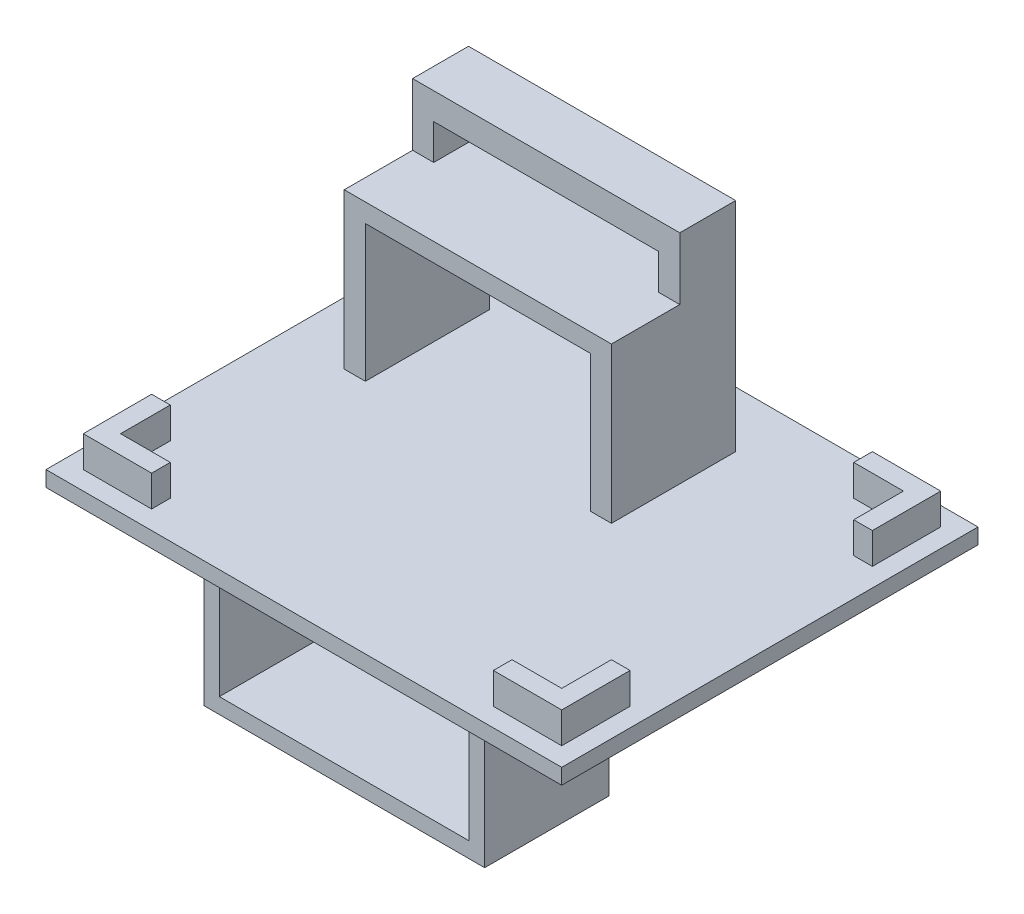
ISO-10303-21;
HEADER;
FILE_DESCRIPTION(('STEP AP214'),'2;1');
FILE_NAME('part.step','',(''),(''),'','','');
FILE_SCHEMA(('AUTOMOTIVE_DESIGN { 1 0 10303 214 1 1 1 1 }'));
ENDSEC;
DATA;
#1=APPLICATION_CONTEXT('core data for automotive mechanical design processes');
#2=APPLICATION_PROTOCOL_DEFINITION('international standard','automotive_design',2000,#1);
#3=PRODUCT_CONTEXT('',#1,'mechanical');
#4=PRODUCT('Part','Part','',(#3));
#5=PRODUCT_RELATED_PRODUCT_CATEGORY('part','',(#4));
#6=PRODUCT_DEFINITION_FORMATION('','',#4);
#7=PRODUCT_DEFINITION_CONTEXT('part definition',#1,'design');
#8=PRODUCT_DEFINITION('design','',#6,#7);
#9=PRODUCT_DEFINITION_SHAPE('','',#8);
#10=(LENGTH_UNIT() NAMED_UNIT(*) SI_UNIT(.MILLI.,.METRE.));
#11=(NAMED_UNIT(*) PLANE_ANGLE_UNIT() SI_UNIT($,.RADIAN.));
#12=(NAMED_UNIT(*) SI_UNIT($,.STERADIAN.) SOLID_ANGLE_UNIT());
#13=UNCERTAINTY_MEASURE_WITH_UNIT(LENGTH_MEASURE(1.E-05),#10,'distance_accuracy_value','');
#14=(GEOMETRIC_REPRESENTATION_CONTEXT(3) GLOBAL_UNCERTAINTY_ASSIGNED_CONTEXT((#13)) GLOBAL_UNIT_ASSIGNED_CONTEXT((#10,
#11,#12)) REPRESENTATION_CONTEXT('',''));
#15=CARTESIAN_POINT('',(0.,0.,0.));
#16=DIRECTION('',(0.,0.,1.));
#17=DIRECTION('',(1.,0.,0.));
#18=AXIS2_PLACEMENT_3D('',#15,#16,#17);
#19=CARTESIAN_POINT('',(22.6,-21.6,10.));
#20=DIRECTION('',(-1.,0.,0.));
#21=DIRECTION('',(0.,0.,1.));
#22=AXIS2_PLACEMENT_3D('',#19,#20,#21);
#23=PLANE('',#22);
#24=DIRECTION('',(0.,1.,0.));
#25=VECTOR('',#24,1.);
#26=CARTESIAN_POINT('',(22.6,-21.6,-10.));
#27=LINE('',#26,#25);
#28=CARTESIAN_POINT('',(22.6,-21.6,-10.));
#29=VERTEX_POINT('',#28);
#30=CARTESIAN_POINT('',(22.6,19.1,-10.));
#31=VERTEX_POINT('',#30);
#32=EDGE_CURVE('E886',#29,#31,#27,.T.);
#33=ORIENTED_EDGE('',*,*,#32,.T.);
#34=DIRECTION('',(0.,0.,1.));
#35=VECTOR('',#34,1.);
#36=CARTESIAN_POINT('',(22.6,19.1,10.));
#37=LINE('',#36,#35);
#38=CARTESIAN_POINT('',(22.6,19.1,10.));
#39=VERTEX_POINT('',#38);
#40=EDGE_CURVE('E851',#31,#39,#37,.T.);
#41=ORIENTED_EDGE('',*,*,#40,.T.);
#42=DIRECTION('',(0.,1.,0.));
#43=VECTOR('',#42,1.);
#44=CARTESIAN_POINT('',(22.6,-21.6,10.));
#45=LINE('',#44,#43);
#46=CARTESIAN_POINT('',(22.6,-21.6,10.));
#47=VERTEX_POINT('',#46);
#48=EDGE_CURVE('E888',#47,#39,#45,.T.);
#49=ORIENTED_EDGE('',*,*,#48,.F.);
#50=DIRECTION('',(0.,0.,-1.));
#51=VECTOR('',#50,1.);
#52=CARTESIAN_POINT('',(22.6,-21.6,10.));
#53=LINE('',#52,#51);
#54=EDGE_CURVE('E891',#47,#29,#53,.T.);
#55=ORIENTED_EDGE('',*,*,#54,.T.);
#56=EDGE_LOOP('',(#33,#41,#49,#55));
#57=FACE_BOUND('',#56,.T.);
#58=DIRECTION('',(0.,-1.,0.));
#59=VECTOR('',#58,1.);
#60=CARTESIAN_POINT('',(22.6,-11.3000000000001,2.));
#61=LINE('',#60,#59);
#62=CARTESIAN_POINT('',(22.6,13.1,2.));
#63=VERTEX_POINT('',#62);
#64=CARTESIAN_POINT('',(22.6,-11.3000000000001,2.));
#65=VERTEX_POINT('',#64);
#66=EDGE_CURVE('E529',#63,#65,#61,.T.);
#67=ORIENTED_EDGE('',*,*,#66,.F.);
#68=DIRECTION('',(0.,0.,-1.));
#69=VECTOR('',#68,1.);
#70=CARTESIAN_POINT('',(22.6,13.1,2.));
#71=LINE('',#70,#69);
#72=CARTESIAN_POINT('',(22.6,13.1,-2.));
#73=VERTEX_POINT('',#72);
#74=EDGE_CURVE('E2497',#63,#73,#71,.T.);
#75=ORIENTED_EDGE('',*,*,#74,.T.);
#76=DIRECTION('',(0.,-1.,0.));
#77=VECTOR('',#76,1.);
#78=CARTESIAN_POINT('',(22.6,-11.3000000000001,-2.));
#79=LINE('',#78,#77);
#80=CARTESIAN_POINT('',(22.6,-11.3000000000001,-2.));
#81=VERTEX_POINT('',#80);
#82=EDGE_CURVE('E543',#73,#81,#79,.T.);
#83=ORIENTED_EDGE('',*,*,#82,.T.);
#84=DIRECTION('',(0.,0.,-1.));
#85=VECTOR('',#84,1.);
#86=CARTESIAN_POINT('',(22.6,-11.3000000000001,2.));
#87=LINE('',#86,#85);
#88=EDGE_CURVE('E522',#65,#81,#87,.T.);
#89=ORIENTED_EDGE('',*,*,#88,.F.);
#90=EDGE_LOOP('',(#67,#75,#83,#89));
#91=FACE_BOUND('',#90,.T.);
#92=ADVANCED_FACE('F38',(#57,#91),#23,.F.);
#93=CARTESIAN_POINT('',(-20.1,19.1,10.));
#94=DIRECTION('',(0.,-1.,0.));
#95=DIRECTION('',(0.,0.,-1.));
#96=AXIS2_PLACEMENT_3D('',#93,#94,#95);
#97=PLANE('',#96);
#98=DIRECTION('',(-1.,0.,0.));
#99=VECTOR('',#98,1.);
#100=CARTESIAN_POINT('',(0.,19.1,10.));
#101=LINE('',#100,#99);
#102=CARTESIAN_POINT('',(-20.1,19.1,10.));
#103=VERTEX_POINT('',#102);
#104=CARTESIAN_POINT('',(-22.6,19.1,10.));
#105=VERTEX_POINT('',#104);
#106=EDGE_CURVE('E843',#103,#105,#101,.T.);
#107=ORIENTED_EDGE('',*,*,#106,.F.);
#108=DIRECTION('',(0.,0.,-1.));
#109=VECTOR('',#108,1.);
#110=CARTESIAN_POINT('',(-20.1,19.1,10.));
#111=LINE('',#110,#109);
#112=CARTESIAN_POINT('',(-20.1,19.1,-10.));
#113=VERTEX_POINT('',#112);
#114=EDGE_CURVE('E876',#103,#113,#111,.T.);
#115=ORIENTED_EDGE('',*,*,#114,.T.);
#116=DIRECTION('',(-1.,0.,0.));
#117=VECTOR('',#116,1.);
#118=CARTESIAN_POINT('',(0.,19.1,-10.));
#119=LINE('',#118,#117);
#120=CARTESIAN_POINT('',(-22.6,19.1,-10.));
#121=VERTEX_POINT('',#120);
#122=EDGE_CURVE('E841',#113,#121,#119,.T.);
#123=ORIENTED_EDGE('',*,*,#122,.T.);
#124=DIRECTION('',(0.,0.,-1.));
#125=VECTOR('',#124,1.);
#126=CARTESIAN_POINT('',(-22.6,19.1,10.));
#127=LINE('',#126,#125);
#128=EDGE_CURVE('E847',#105,#121,#127,.T.);
#129=ORIENTED_EDGE('',*,*,#128,.F.);
#130=EDGE_LOOP('',(#107,#115,#123,#129));
#131=FACE_BOUND('',#130,.T.);
#132=DIRECTION('',(0.,0.,-1.));
#133=VECTOR('',#132,1.);
#134=CARTESIAN_POINT('',(20.1,19.1,10.));
#135=LINE('',#134,#133);
#136=CARTESIAN_POINT('',(20.1,19.1,10.));
#137=VERTEX_POINT('',#136);
#138=CARTESIAN_POINT('',(20.1,19.1,-10.));
#139=VERTEX_POINT('',#138);
#140=EDGE_CURVE('E879',#137,#139,#135,.T.);
#141=ORIENTED_EDGE('',*,*,#140,.F.);
#142=EDGE_CURVE('E848',#39,#137,#101,.T.);
#143=ORIENTED_EDGE('',*,*,#142,.F.);
#144=ORIENTED_EDGE('',*,*,#40,.F.);
#145=EDGE_CURVE('E844',#31,#139,#119,.T.);
#146=ORIENTED_EDGE('',*,*,#145,.T.);
#147=EDGE_LOOP('',(#141,#143,#144,#146));
#148=FACE_BOUND('',#147,.T.);
#149=DIRECTION('',(0.,0.,-1.));
#150=VECTOR('',#149,1.);
#151=CARTESIAN_POINT('',(-25.,19.1,33.));
#152=LINE('',#151,#150);
#153=CARTESIAN_POINT('',(-25.,19.1,33.));
#154=VERTEX_POINT('',#153);
#155=CARTESIAN_POINT('',(-25.,19.1,-34.));
#156=VERTEX_POINT('',#155);
#157=EDGE_CURVE('E813',#154,#156,#152,.T.);
#158=ORIENTED_EDGE('',*,*,#157,.T.);
#159=DIRECTION('',(1.,0.,0.));
#160=VECTOR('',#159,1.);
#161=CARTESIAN_POINT('',(-25.,19.1,-34.));
#162=LINE('',#161,#160);
#163=CARTESIAN_POINT('',(58.,19.1,-34.));
#164=VERTEX_POINT('',#163);
#165=EDGE_CURVE('E824',#156,#164,#162,.T.);
#166=ORIENTED_EDGE('',*,*,#165,.T.);
#167=DIRECTION('',(0.,0.,1.));
#168=VECTOR('',#167,1.);
#169=CARTESIAN_POINT('',(58.,19.1,33.));
#170=LINE('',#169,#168);
#171=CARTESIAN_POINT('',(58.,19.1,33.));
#172=VERTEX_POINT('',#171);
#173=EDGE_CURVE('E827',#164,#172,#170,.T.);
#174=ORIENTED_EDGE('',*,*,#173,.T.);
#175=DIRECTION('',(-1.,0.,0.));
#176=VECTOR('',#175,1.);
#177=CARTESIAN_POINT('',(-25.,19.1,33.));
#178=LINE('',#177,#176);
#179=EDGE_CURVE('E830',#172,#154,#178,.T.);
#180=ORIENTED_EDGE('',*,*,#179,.T.);
#181=EDGE_LOOP('',(#158,#166,#174,#180));
#182=FACE_BOUND('',#181,.T.);
#183=DIRECTION('',(0.,0.,-1.));
#184=VECTOR('',#183,1.);
#185=CARTESIAN_POINT('',(28.6,19.1,2.));
#186=LINE('',#185,#184);
#187=CARTESIAN_POINT('',(28.6,19.1,2.));
#188=VERTEX_POINT('',#187);
#189=CARTESIAN_POINT('',(28.6,19.1,-2.));
#190=VERTEX_POINT('',#189);
#191=EDGE_CURVE('E2498',#188,#190,#186,.T.);
#192=ORIENTED_EDGE('',*,*,#191,.F.);
#193=DIRECTION('',(-1.,0.,0.));
#194=VECTOR('',#193,1.);
#195=CARTESIAN_POINT('',(28.6,19.1,2.));
#196=LINE('',#195,#194);
#197=CARTESIAN_POINT('',(53.,19.1,2.));
#198=VERTEX_POINT('',#197);
#199=EDGE_CURVE('E2508',#198,#188,#196,.T.);
#200=ORIENTED_EDGE('',*,*,#199,.F.);
#201=DIRECTION('',(0.,0.,-1.));
#202=VECTOR('',#201,1.);
#203=CARTESIAN_POINT('',(53.,19.1,2.));
#204=LINE('',#203,#202);
#205=CARTESIAN_POINT('',(53.,19.1,-2.));
#206=VERTEX_POINT('',#205);
#207=EDGE_CURVE('E2506',#198,#206,#204,.T.);
#208=ORIENTED_EDGE('',*,*,#207,.T.);
#209=DIRECTION('',(-1.,0.,0.));
#210=VECTOR('',#209,1.);
#211=CARTESIAN_POINT('',(28.6,19.1,-2.));
#212=LINE('',#211,#210);
#213=EDGE_CURVE('E2500',#206,#190,#212,.T.);
#214=ORIENTED_EDGE('',*,*,#213,.T.);
#215=EDGE_LOOP('',(#192,#200,#208,#214));
#216=FACE_BOUND('',#215,.T.);
#217=ADVANCED_FACE('F1689',(#131,#148,#182,#216),#97,.T.);
#218=CARTESIAN_POINT('',(0.,26.6,0.));
#219=DIRECTION('',(0.,1.,0.));
#220=DIRECTION('',(0.,0.,1.));
#221=AXIS2_PLACEMENT_3D('',#218,#219,#220);
#222=PLANE('',#221);
#223=DIRECTION('',(0.,0.,-1.));
#224=VECTOR('',#223,1.);
#225=CARTESIAN_POINT('',(44.,26.6,27.));
#226=LINE('',#225,#224);
#227=CARTESIAN_POINT('',(44.,26.6,30.));
#228=VERTEX_POINT('',#227);
#229=CARTESIAN_POINT('',(44.,26.6,27.));
#230=VERTEX_POINT('',#229);
#231=EDGE_CURVE('E552',#228,#230,#226,.T.);
#232=ORIENTED_EDGE('',*,*,#231,.F.);
#233=DIRECTION('',(1.,0.,0.));
#234=VECTOR('',#233,1.);
#235=CARTESIAN_POINT('',(-22.,26.6,30.));
#236=LINE('',#235,#234);
#237=CARTESIAN_POINT('',(55.,26.6,30.));
#238=VERTEX_POINT('',#237);
#239=EDGE_CURVE('E718',#228,#238,#236,.T.);
#240=ORIENTED_EDGE('',*,*,#239,.T.);
#241=DIRECTION('',(0.,0.,-1.));
#242=VECTOR('',#241,1.);
#243=CARTESIAN_POINT('',(55.,26.6,30.));
#244=LINE('',#243,#242);
#245=CARTESIAN_POINT('',(55.,26.6,19.));
#246=VERTEX_POINT('',#245);
#247=EDGE_CURVE('E724',#238,#246,#244,.T.);
#248=ORIENTED_EDGE('',*,*,#247,.T.);
#249=DIRECTION('',(1.,0.,0.));
#250=VECTOR('',#249,1.);
#251=CARTESIAN_POINT('',(52.,26.6,19.));
#252=LINE('',#251,#250);
#253=CARTESIAN_POINT('',(52.,26.6,19.));
#254=VERTEX_POINT('',#253);
#255=EDGE_CURVE('E571',#254,#246,#252,.T.);
#256=ORIENTED_EDGE('',*,*,#255,.F.);
#257=DIRECTION('',(0.,0.,-1.));
#258=VECTOR('',#257,1.);
#259=CARTESIAN_POINT('',(52.,26.6,27.));
#260=LINE('',#259,#258);
#261=CARTESIAN_POINT('',(52.,26.6,27.));
#262=VERTEX_POINT('',#261);
#263=EDGE_CURVE('E671',#262,#254,#260,.T.);
#264=ORIENTED_EDGE('',*,*,#263,.F.);
#265=DIRECTION('',(1.,0.,0.));
#266=VECTOR('',#265,1.);
#267=CARTESIAN_POINT('',(-19.,26.6,27.));
#268=LINE('',#267,#266);
#269=EDGE_CURVE('E683',#230,#262,#268,.T.);
#270=ORIENTED_EDGE('',*,*,#269,.F.);
#271=EDGE_LOOP('',(#232,#240,#248,#256,#264,#270));
#272=FACE_BOUND('',#271,.T.);
#273=ADVANCED_FACE('F1695',(#272),#222,.T.);
#274=DIRECTION('',(0.,0.,1.));
#275=VECTOR('',#274,1.);
#276=CARTESIAN_POINT('',(-11.,26.6,27.));
#277=LINE('',#276,#275);
#278=CARTESIAN_POINT('',(-11.,26.6,27.));
#279=VERTEX_POINT('',#278);
#280=CARTESIAN_POINT('',(-11.,26.6,30.));
#281=VERTEX_POINT('',#280);
#282=EDGE_CURVE('E555',#279,#281,#277,.T.);
#283=ORIENTED_EDGE('',*,*,#282,.F.);
#284=CARTESIAN_POINT('',(-19.,26.6,27.));
#285=VERTEX_POINT('',#284);
#286=EDGE_CURVE('E684',#285,#279,#268,.T.);
#287=ORIENTED_EDGE('',*,*,#286,.F.);
#288=DIRECTION('',(0.,0.,1.));
#289=VECTOR('',#288,1.);
#290=CARTESIAN_POINT('',(-19.,26.6,-28.));
#291=LINE('',#290,#289);
#292=CARTESIAN_POINT('',(-19.,26.6,19.));
#293=VERTEX_POINT('',#292);
#294=EDGE_CURVE('E679',#293,#285,#291,.T.);
#295=ORIENTED_EDGE('',*,*,#294,.F.);
#296=DIRECTION('',(1.,0.,0.));
#297=VECTOR('',#296,1.);
#298=CARTESIAN_POINT('',(-19.,26.6,19.));
#299=LINE('',#298,#297);
#300=CARTESIAN_POINT('',(-22.,26.6,19.));
#301=VERTEX_POINT('',#300);
#302=EDGE_CURVE('E572',#301,#293,#299,.T.);
#303=ORIENTED_EDGE('',*,*,#302,.F.);
#304=DIRECTION('',(0.,0.,1.));
#305=VECTOR('',#304,1.);
#306=CARTESIAN_POINT('',(-22.,26.6,-31.));
#307=LINE('',#306,#305);
#308=CARTESIAN_POINT('',(-22.,26.6,30.));
#309=VERTEX_POINT('',#308);
#310=EDGE_CURVE('E719',#301,#309,#307,.T.);
#311=ORIENTED_EDGE('',*,*,#310,.T.);
#312=EDGE_CURVE('E720',#309,#281,#236,.T.);
#313=ORIENTED_EDGE('',*,*,#312,.T.);
#314=EDGE_LOOP('',(#283,#287,#295,#303,#311,#313));
#315=FACE_BOUND('',#314,.T.);
#316=ADVANCED_FACE('F1980',(#315),#222,.T.);
#317=DIRECTION('',(0.,0.,-1.));
#318=VECTOR('',#317,1.);
#319=CARTESIAN_POINT('',(44.,26.6,-28.));
#320=LINE('',#319,#318);
#321=CARTESIAN_POINT('',(44.,26.6,-28.));
#322=VERTEX_POINT('',#321);
#323=CARTESIAN_POINT('',(44.,26.6,-31.));
#324=VERTEX_POINT('',#323);
#325=EDGE_CURVE('E544',#322,#324,#320,.T.);
#326=ORIENTED_EDGE('',*,*,#325,.F.);
#327=DIRECTION('',(-1.,0.,0.));
#328=VECTOR('',#327,1.);
#329=CARTESIAN_POINT('',(52.,26.6,-28.));
#330=LINE('',#329,#328);
#331=CARTESIAN_POINT('',(52.,26.6,-28.));
#332=VERTEX_POINT('',#331);
#333=EDGE_CURVE('E676',#332,#322,#330,.T.);
#334=ORIENTED_EDGE('',*,*,#333,.F.);
#335=CARTESIAN_POINT('',(52.,26.6,-20.));
#336=VERTEX_POINT('',#335);
#337=EDGE_CURVE('E675',#336,#332,#260,.T.);
#338=ORIENTED_EDGE('',*,*,#337,.F.);
#339=DIRECTION('',(-1.,0.,0.));
#340=VECTOR('',#339,1.);
#341=CARTESIAN_POINT('',(52.,26.6,-20.));
#342=LINE('',#341,#340);
#343=CARTESIAN_POINT('',(55.,26.6,-20.));
#344=VERTEX_POINT('',#343);
#345=EDGE_CURVE('E605',#344,#336,#342,.T.);
#346=ORIENTED_EDGE('',*,*,#345,.F.);
#347=CARTESIAN_POINT('',(55.,26.6,-31.));
#348=VERTEX_POINT('',#347);
#349=EDGE_CURVE('E723',#344,#348,#244,.T.);
#350=ORIENTED_EDGE('',*,*,#349,.T.);
#351=DIRECTION('',(-1.,0.,0.));
#352=VECTOR('',#351,1.);
#353=CARTESIAN_POINT('',(55.,26.6,-31.));
#354=LINE('',#353,#352);
#355=EDGE_CURVE('E728',#348,#324,#354,.T.);
#356=ORIENTED_EDGE('',*,*,#355,.T.);
#357=EDGE_LOOP('',(#326,#334,#338,#346,#350,#356));
#358=FACE_BOUND('',#357,.T.);
#359=ADVANCED_FACE('F1990',(#358),#222,.T.);
#360=CARTESIAN_POINT('',(-22.,26.6,-31.));
#361=DIRECTION('',(1.,0.,0.));
#362=DIRECTION('',(0.,0.,-1.));
#363=AXIS2_PLACEMENT_3D('',#360,#361,#362);
#364=PLANE('',#363);
#365=ORIENTED_EDGE('',*,*,#310,.F.);
#366=DIRECTION('',(0.,1.,0.));
#367=VECTOR('',#366,1.);
#368=CARTESIAN_POINT('',(-22.,-33.4817574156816,19.));
#369=LINE('',#368,#367);
#370=CARTESIAN_POINT('',(-22.,21.6,19.));
#371=VERTEX_POINT('',#370);
#372=EDGE_CURVE('E574',#371,#301,#369,.T.);
#373=ORIENTED_EDGE('',*,*,#372,.F.);
#374=DIRECTION('',(0.,0.,1.));
#375=VECTOR('',#374,1.);
#376=CARTESIAN_POINT('',(-22.,21.6,-31.));
#377=LINE('',#376,#375);
#378=CARTESIAN_POINT('',(-22.,21.6,30.));
#379=VERTEX_POINT('',#378);
#380=EDGE_CURVE('E714',#371,#379,#377,.T.);
#381=ORIENTED_EDGE('',*,*,#380,.T.);
#382=DIRECTION('',(0.,-1.,0.));
#383=VECTOR('',#382,1.);
#384=CARTESIAN_POINT('',(-22.,26.6,30.));
#385=LINE('',#384,#383);
#386=EDGE_CURVE('E755',#309,#379,#385,.T.);
#387=ORIENTED_EDGE('',*,*,#386,.F.);
#388=EDGE_LOOP('',(#365,#373,#381,#387));
#389=FACE_BOUND('',#388,.T.);
#390=ADVANCED_FACE('F1999',(#389),#364,.F.);
#391=CARTESIAN_POINT('',(-22.,26.6,30.));
#392=DIRECTION('',(0.,0.,-1.));
#393=DIRECTION('',(-1.,0.,0.));
#394=AXIS2_PLACEMENT_3D('',#391,#392,#393);
#395=PLANE('',#394);
#396=ORIENTED_EDGE('',*,*,#239,.F.);
#397=DIRECTION('',(0.,1.,0.));
#398=VECTOR('',#397,1.);
#399=CARTESIAN_POINT('',(44.,-33.4817574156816,30.));
#400=LINE('',#399,#398);
#401=CARTESIAN_POINT('',(44.,21.6,30.));
#402=VERTEX_POINT('',#401);
#403=EDGE_CURVE('E554',#402,#228,#400,.T.);
#404=ORIENTED_EDGE('',*,*,#403,.F.);
#405=DIRECTION('',(1.,0.,0.));
#406=VECTOR('',#405,1.);
#407=CARTESIAN_POINT('',(-22.,21.6,30.));
#408=LINE('',#407,#406);
#409=CARTESIAN_POINT('',(55.,21.6,30.));
#410=VERTEX_POINT('',#409);
#411=EDGE_CURVE('E735',#402,#410,#408,.T.);
#412=ORIENTED_EDGE('',*,*,#411,.T.);
#413=DIRECTION('',(0.,-1.,0.));
#414=VECTOR('',#413,1.);
#415=CARTESIAN_POINT('',(55.,26.6,30.));
#416=LINE('',#415,#414);
#417=EDGE_CURVE('E752',#238,#410,#416,.T.);
#418=ORIENTED_EDGE('',*,*,#417,.F.);
#419=EDGE_LOOP('',(#396,#404,#412,#418));
#420=FACE_BOUND('',#419,.T.);
#421=ADVANCED_FACE('F1936',(#420),#395,.F.);
#422=CARTESIAN_POINT('',(55.,26.6,-31.));
#423=DIRECTION('',(0.,0.,1.));
#424=DIRECTION('',(1.,0.,0.));
#425=AXIS2_PLACEMENT_3D('',#422,#423,#424);
#426=PLANE('',#425);
#427=DIRECTION('',(-1.,0.,0.));
#428=VECTOR('',#427,1.);
#429=CARTESIAN_POINT('',(55.,21.6,-31.));
#430=LINE('',#429,#428);
#431=CARTESIAN_POINT('',(55.,21.6,-31.));
#432=VERTEX_POINT('',#431);
#433=CARTESIAN_POINT('',(44.,21.6,-31.));
#434=VERTEX_POINT('',#433);
#435=EDGE_CURVE('E744',#432,#434,#430,.T.);
#436=ORIENTED_EDGE('',*,*,#435,.T.);
#437=DIRECTION('',(0.,1.,0.));
#438=VECTOR('',#437,1.);
#439=CARTESIAN_POINT('',(44.,-33.4817574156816,-31.));
#440=LINE('',#439,#438);
#441=EDGE_CURVE('E594',#434,#324,#440,.T.);
#442=ORIENTED_EDGE('',*,*,#441,.T.);
#443=ORIENTED_EDGE('',*,*,#355,.F.);
#444=DIRECTION('',(0.,-1.,0.));
#445=VECTOR('',#444,1.);
#446=CARTESIAN_POINT('',(55.,26.6,-31.));
#447=LINE('',#446,#445);
#448=EDGE_CURVE('E749',#348,#432,#447,.T.);
#449=ORIENTED_EDGE('',*,*,#448,.T.);
#450=EDGE_LOOP('',(#436,#442,#443,#449));
#451=FACE_BOUND('',#450,.T.);
#452=ADVANCED_FACE('F2017',(#451),#426,.F.);
#453=CARTESIAN_POINT('',(52.,26.6,-28.));
#454=DIRECTION('',(0.,0.,1.));
#455=DIRECTION('',(1.,0.,0.));
#456=AXIS2_PLACEMENT_3D('',#453,#454,#455);
#457=PLANE('',#456);
#458=DIRECTION('',(0.,1.,0.));
#459=VECTOR('',#458,1.);
#460=CARTESIAN_POINT('',(44.,-33.4817574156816,-28.));
#461=LINE('',#460,#459);
#462=CARTESIAN_POINT('',(44.,21.6,-28.));
#463=VERTEX_POINT('',#462);
#464=EDGE_CURVE('E577',#463,#322,#461,.T.);
#465=ORIENTED_EDGE('',*,*,#464,.F.);
#466=DIRECTION('',(-1.,0.,0.));
#467=VECTOR('',#466,1.);
#468=CARTESIAN_POINT('',(52.,21.6,-28.));
#469=LINE('',#468,#467);
#470=CARTESIAN_POINT('',(52.,21.6,-28.));
#471=VERTEX_POINT('',#470);
#472=EDGE_CURVE('E692',#471,#463,#469,.T.);
#473=ORIENTED_EDGE('',*,*,#472,.F.);
#474=DIRECTION('',(0.,-1.,0.));
#475=VECTOR('',#474,1.);
#476=CARTESIAN_POINT('',(52.,26.6,-28.));
#477=LINE('',#476,#475);
#478=EDGE_CURVE('E711',#332,#471,#477,.T.);
#479=ORIENTED_EDGE('',*,*,#478,.F.);
#480=ORIENTED_EDGE('',*,*,#333,.T.);
#481=EDGE_LOOP('',(#465,#473,#479,#480));
#482=FACE_BOUND('',#481,.T.);
#483=ADVANCED_FACE('F1919',(#482),#457,.T.);
#484=CARTESIAN_POINT('',(-19.,26.6,-28.));
#485=DIRECTION('',(1.,0.,0.));
#486=DIRECTION('',(0.,0.,-1.));
#487=AXIS2_PLACEMENT_3D('',#484,#485,#486);
#488=PLANE('',#487);
#489=DIRECTION('',(0.,1.,0.));
#490=VECTOR('',#489,1.);
#491=CARTESIAN_POINT('',(-19.,-33.4817574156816,19.));
#492=LINE('',#491,#490);
#493=CARTESIAN_POINT('',(-19.,21.6,19.));
#494=VERTEX_POINT('',#493);
#495=EDGE_CURVE('E583',#494,#293,#492,.T.);
#496=ORIENTED_EDGE('',*,*,#495,.T.);
#497=ORIENTED_EDGE('',*,*,#294,.T.);
#498=DIRECTION('',(0.,-1.,0.));
#499=VECTOR('',#498,1.);
#500=CARTESIAN_POINT('',(-19.,26.6,27.));
#501=LINE('',#500,#499);
#502=CARTESIAN_POINT('',(-19.,21.6,27.));
#503=VERTEX_POINT('',#502);
#504=EDGE_CURVE('E705',#285,#503,#501,.T.);
#505=ORIENTED_EDGE('',*,*,#504,.T.);
#506=DIRECTION('',(0.,0.,1.));
#507=VECTOR('',#506,1.);
#508=CARTESIAN_POINT('',(-19.,21.6,-28.));
#509=LINE('',#508,#507);
#510=EDGE_CURVE('E695',#494,#503,#509,.T.);
#511=ORIENTED_EDGE('',*,*,#510,.F.);
#512=EDGE_LOOP('',(#496,#497,#505,#511));
#513=FACE_BOUND('',#512,.T.);
#514=ADVANCED_FACE('F1908',(#513),#488,.T.);
#515=CARTESIAN_POINT('',(-19.,26.6,27.));
#516=DIRECTION('',(0.,0.,-1.));
#517=DIRECTION('',(-1.,0.,0.));
#518=AXIS2_PLACEMENT_3D('',#515,#516,#517);
#519=PLANE('',#518);
#520=DIRECTION('',(0.,1.,0.));
#521=VECTOR('',#520,1.);
#522=CARTESIAN_POINT('',(44.,-33.4817574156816,27.));
#523=LINE('',#522,#521);
#524=CARTESIAN_POINT('',(44.,21.6,27.));
#525=VERTEX_POINT('',#524);
#526=EDGE_CURVE('E564',#525,#230,#523,.T.);
#527=ORIENTED_EDGE('',*,*,#526,.T.);
#528=ORIENTED_EDGE('',*,*,#269,.T.);
#529=DIRECTION('',(0.,-1.,0.));
#530=VECTOR('',#529,1.);
#531=CARTESIAN_POINT('',(52.,26.6,27.));
#532=LINE('',#531,#530);
#533=CARTESIAN_POINT('',(52.,21.6,27.));
#534=VERTEX_POINT('',#533);
#535=EDGE_CURVE('E687',#262,#534,#532,.T.);
#536=ORIENTED_EDGE('',*,*,#535,.T.);
#537=DIRECTION('',(1.,0.,0.));
#538=VECTOR('',#537,1.);
#539=CARTESIAN_POINT('',(-19.,21.6,27.));
#540=LINE('',#539,#538);
#541=EDGE_CURVE('E699',#525,#534,#540,.T.);
#542=ORIENTED_EDGE('',*,*,#541,.F.);
#543=EDGE_LOOP('',(#527,#528,#536,#542));
#544=FACE_BOUND('',#543,.T.);
#545=ADVANCED_FACE('F1901',(#544),#519,.T.);
#546=CARTESIAN_POINT('',(55.,26.6,30.));
#547=DIRECTION('',(-1.,0.,0.));
#548=DIRECTION('',(0.,0.,1.));
#549=AXIS2_PLACEMENT_3D('',#546,#547,#548);
#550=PLANE('',#549);
#551=DIRECTION('',(0.,0.,-1.));
#552=VECTOR('',#551,1.);
#553=CARTESIAN_POINT('',(55.,21.6,30.));
#554=LINE('',#553,#552);
#555=CARTESIAN_POINT('',(55.,21.6,19.));
#556=VERTEX_POINT('',#555);
#557=EDGE_CURVE('E740',#410,#556,#554,.T.);
#558=ORIENTED_EDGE('',*,*,#557,.T.);
#559=DIRECTION('',(0.,1.,0.));
#560=VECTOR('',#559,1.);
#561=CARTESIAN_POINT('',(55.,-33.4817574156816,19.));
#562=LINE('',#561,#560);
#563=EDGE_CURVE('E611',#556,#246,#562,.T.);
#564=ORIENTED_EDGE('',*,*,#563,.T.);
#565=ORIENTED_EDGE('',*,*,#247,.F.);
#566=ORIENTED_EDGE('',*,*,#417,.T.);
#567=EDGE_LOOP('',(#558,#564,#565,#566));
#568=FACE_BOUND('',#567,.T.);
#569=ADVANCED_FACE('F1888',(#568),#550,.F.);
#570=CARTESIAN_POINT('',(52.,26.6,27.));
#571=DIRECTION('',(-1.,0.,0.));
#572=DIRECTION('',(0.,0.,1.));
#573=AXIS2_PLACEMENT_3D('',#570,#571,#572);
#574=PLANE('',#573);
#575=DIRECTION('',(0.,1.,0.));
#576=VECTOR('',#575,1.);
#577=CARTESIAN_POINT('',(52.,-33.4817574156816,19.));
#578=LINE('',#577,#576);
#579=CARTESIAN_POINT('',(52.,21.6,19.));
#580=VERTEX_POINT('',#579);
#581=EDGE_CURVE('E618',#580,#254,#578,.T.);
#582=ORIENTED_EDGE('',*,*,#581,.F.);
#583=DIRECTION('',(0.,0.,-1.));
#584=VECTOR('',#583,1.);
#585=CARTESIAN_POINT('',(52.,21.6,27.));
#586=LINE('',#585,#584);
#587=EDGE_CURVE('E688',#534,#580,#586,.T.);
#588=ORIENTED_EDGE('',*,*,#587,.F.);
#589=ORIENTED_EDGE('',*,*,#535,.F.);
#590=ORIENTED_EDGE('',*,*,#263,.T.);
#591=EDGE_LOOP('',(#582,#588,#589,#590));
#592=FACE_BOUND('',#591,.T.);
#593=ADVANCED_FACE('F1882',(#592),#574,.T.);
#594=CARTESIAN_POINT('',(24.6,52.3,-61.6460093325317));
#595=DIRECTION('',(1.,0.,0.));
#596=DIRECTION('',(0.,1.,0.));
#597=AXIS2_PLACEMENT_3D('',#594,#595,#596);
#598=PLANE('',#597);
#599=DIRECTION('',(0.,-1.,0.));
#600=VECTOR('',#599,1.);
#601=CARTESIAN_POINT('',(24.6,52.3,-16.));
#602=LINE('',#601,#600);
#603=CARTESIAN_POINT('',(24.6,52.3,-16.));
#604=VERTEX_POINT('',#603);
#605=CARTESIAN_POINT('',(24.6,46.6,-16.));
#606=VERTEX_POINT('',#605);
#607=EDGE_CURVE('E668',#604,#606,#602,.T.);
#608=ORIENTED_EDGE('',*,*,#607,.F.);
#609=DIRECTION('',(0.,0.,1.));
#610=VECTOR('',#609,1.);
#611=CARTESIAN_POINT('',(24.6,52.3,-61.6460093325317));
#612=LINE('',#611,#610);
#613=CARTESIAN_POINT('',(24.6,52.3,-25.));
#614=VERTEX_POINT('',#613);
#615=EDGE_CURVE('E772',#614,#604,#612,.T.);
#616=ORIENTED_EDGE('',*,*,#615,.F.);
#617=DIRECTION('',(0.,-1.,0.));
#618=VECTOR('',#617,1.);
#619=CARTESIAN_POINT('',(24.6,52.3,-25.));
#620=LINE('',#619,#618);
#621=CARTESIAN_POINT('',(24.6,46.6,-25.));
#622=VERTEX_POINT('',#621);
#623=EDGE_CURVE('E759',#614,#622,#620,.T.);
#624=ORIENTED_EDGE('',*,*,#623,.T.);
#625=DIRECTION('',(0.,0.,1.));
#626=VECTOR('',#625,1.);
#627=CARTESIAN_POINT('',(24.6,46.6,-61.6460093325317));
#628=LINE('',#627,#626);
#629=EDGE_CURVE('E775',#622,#606,#628,.T.);
#630=ORIENTED_EDGE('',*,*,#629,.T.);
#631=EDGE_LOOP('',(#608,#616,#624,#630));
#632=FACE_BOUND('',#631,.T.);
#633=ADVANCED_FACE('F1880',(#632),#598,.F.);
#634=CARTESIAN_POINT('',(-11.6,52.3,-61.6460093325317));
#635=DIRECTION('',(-1.,0.,0.));
#636=DIRECTION('',(0.,-1.,0.));
#637=AXIS2_PLACEMENT_3D('',#634,#635,#636);
#638=PLANE('',#637);
#639=DIRECTION('',(0.,1.,0.));
#640=VECTOR('',#639,1.);
#641=CARTESIAN_POINT('',(-11.6,52.3,-16.));
#642=LINE('',#641,#640);
#643=CARTESIAN_POINT('',(-11.6,46.6,-16.));
#644=VERTEX_POINT('',#643);
#645=CARTESIAN_POINT('',(-11.6,52.3,-16.));
#646=VERTEX_POINT('',#645);
#647=EDGE_CURVE('E666',#644,#646,#642,.T.);
#648=ORIENTED_EDGE('',*,*,#647,.F.);
#649=DIRECTION('',(0.,0.,1.));
#650=VECTOR('',#649,1.);
#651=CARTESIAN_POINT('',(-11.6,46.6,-61.6460093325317));
#652=LINE('',#651,#650);
#653=CARTESIAN_POINT('',(-11.6,46.6,-25.));
#654=VERTEX_POINT('',#653);
#655=EDGE_CURVE('E769',#654,#644,#652,.T.);
#656=ORIENTED_EDGE('',*,*,#655,.F.);
#657=DIRECTION('',(0.,1.,0.));
#658=VECTOR('',#657,1.);
#659=CARTESIAN_POINT('',(-11.6,52.3,-25.));
#660=LINE('',#659,#658);
#661=CARTESIAN_POINT('',(-11.6,52.3,-25.));
#662=VERTEX_POINT('',#661);
#663=EDGE_CURVE('E765',#654,#662,#660,.T.);
#664=ORIENTED_EDGE('',*,*,#663,.T.);
#665=DIRECTION('',(0.,0.,1.));
#666=VECTOR('',#665,1.);
#667=CARTESIAN_POINT('',(-11.6,52.3,-61.6460093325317));
#668=LINE('',#667,#666);
#669=EDGE_CURVE('E763',#662,#646,#668,.T.);
#670=ORIENTED_EDGE('',*,*,#669,.T.);
#671=EDGE_LOOP('',(#648,#656,#664,#670));
#672=FACE_BOUND('',#671,.T.);
#673=ADVANCED_FACE('F1762',(#672),#638,.F.);
#674=CARTESIAN_POINT('',(-11.6,52.3,-61.6460093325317));
#675=DIRECTION('',(0.,1.,0.));
#676=DIRECTION('',(-1.,0.,0.));
#677=AXIS2_PLACEMENT_3D('',#674,#675,#676);
#678=PLANE('',#677);
#679=DIRECTION('',(1.,0.,0.));
#680=VECTOR('',#679,1.);
#681=CARTESIAN_POINT('',(-11.6,52.3,-16.));
#682=LINE('',#681,#680);
#683=EDGE_CURVE('E662',#646,#604,#682,.T.);
#684=ORIENTED_EDGE('',*,*,#683,.F.);
#685=ORIENTED_EDGE('',*,*,#669,.F.);
#686=DIRECTION('',(1.,0.,0.));
#687=VECTOR('',#686,1.);
#688=CARTESIAN_POINT('',(-11.6,52.3,-25.));
#689=LINE('',#688,#687);
#690=EDGE_CURVE('E762',#662,#614,#689,.T.);
#691=ORIENTED_EDGE('',*,*,#690,.T.);
#692=ORIENTED_EDGE('',*,*,#615,.T.);
#693=EDGE_LOOP('',(#684,#685,#691,#692));
#694=FACE_BOUND('',#693,.T.);
#695=ADVANCED_FACE('F1756',(#694),#678,.F.);
#696=CARTESIAN_POINT('',(0.,56.6,0.));
#697=DIRECTION('',(0.,1.,0.));
#698=DIRECTION('',(0.,0.,1.));
#699=AXIS2_PLACEMENT_3D('',#696,#697,#698);
#700=PLANE('',#699);
#701=DIRECTION('',(0.,0.,1.));
#702=VECTOR('',#701,1.);
#703=CARTESIAN_POINT('',(-15.,56.6,-25.));
#704=LINE('',#703,#702);
#705=CARTESIAN_POINT('',(-15.,56.6,-25.));
#706=VERTEX_POINT('',#705);
#707=CARTESIAN_POINT('',(-15.,56.6,-16.));
#708=VERTEX_POINT('',#707);
#709=EDGE_CURVE('E782',#706,#708,#704,.T.);
#710=ORIENTED_EDGE('',*,*,#709,.T.);
#711=DIRECTION('',(-1.,0.,0.));
#712=VECTOR('',#711,1.);
#713=CARTESIAN_POINT('',(-15.,56.6,-16.));
#714=LINE('',#713,#712);
#715=CARTESIAN_POINT('',(28.,56.6,-16.));
#716=VERTEX_POINT('',#715);
#717=EDGE_CURVE('E656',#716,#708,#714,.T.);
#718=ORIENTED_EDGE('',*,*,#717,.F.);
#719=DIRECTION('',(0.,0.,-1.));
#720=VECTOR('',#719,1.);
#721=CARTESIAN_POINT('',(28.,56.6,-25.));
#722=LINE('',#721,#720);
#723=CARTESIAN_POINT('',(28.,56.6,-25.));
#724=VERTEX_POINT('',#723);
#725=EDGE_CURVE('E785',#716,#724,#722,.T.);
#726=ORIENTED_EDGE('',*,*,#725,.T.);
#727=DIRECTION('',(-1.,0.,0.));
#728=VECTOR('',#727,1.);
#729=CARTESIAN_POINT('',(-15.,56.6,-25.));
#730=LINE('',#729,#728);
#731=EDGE_CURVE('E788',#724,#706,#730,.T.);
#732=ORIENTED_EDGE('',*,*,#731,.T.);
#733=EDGE_LOOP('',(#710,#718,#726,#732));
#734=FACE_BOUND('',#733,.T.);
#735=ADVANCED_FACE('F1752',(#734),#700,.T.);
#736=CARTESIAN_POINT('',(0.,0.,10.));
#737=DIRECTION('',(0.,0.,-1.));
#738=DIRECTION('',(-1.,0.,0.));
#739=AXIS2_PLACEMENT_3D('',#736,#737,#738);
#740=PLANE('',#739);
#741=ORIENTED_EDGE('',*,*,#48,.T.);
#742=ORIENTED_EDGE('',*,*,#142,.T.);
#743=DIRECTION('',(0.,1.,0.));
#744=VECTOR('',#743,1.);
#745=CARTESIAN_POINT('',(20.1,-19.1,10.));
#746=LINE('',#745,#744);
#747=CARTESIAN_POINT('',(20.1,-19.1,10.));
#748=VERTEX_POINT('',#747);
#749=EDGE_CURVE('E854',#748,#137,#746,.T.);
#750=ORIENTED_EDGE('',*,*,#749,.F.);
#751=DIRECTION('',(1.,0.,0.));
#752=VECTOR('',#751,1.);
#753=CARTESIAN_POINT('',(-20.1,-19.1,10.));
#754=LINE('',#753,#752);
#755=CARTESIAN_POINT('',(-20.1,-19.1,10.));
#756=VERTEX_POINT('',#755);
#757=EDGE_CURVE('E861',#756,#748,#754,.T.);
#758=ORIENTED_EDGE('',*,*,#757,.F.);
#759=DIRECTION('',(0.,-1.,0.));
#760=VECTOR('',#759,1.);
#761=CARTESIAN_POINT('',(-20.1,-19.1,10.));
#762=LINE('',#761,#760);
#763=EDGE_CURVE('E857',#103,#756,#762,.T.);
#764=ORIENTED_EDGE('',*,*,#763,.F.);
#765=ORIENTED_EDGE('',*,*,#106,.T.);
#766=DIRECTION('',(0.,-1.,0.));
#767=VECTOR('',#766,1.);
#768=CARTESIAN_POINT('',(-22.6,-21.6,10.));
#769=LINE('',#768,#767);
#770=CARTESIAN_POINT('',(-22.6,-21.6,10.));
#771=VERTEX_POINT('',#770);
#772=EDGE_CURVE('E883',#105,#771,#769,.T.);
#773=ORIENTED_EDGE('',*,*,#772,.T.);
#774=DIRECTION('',(1.,0.,0.));
#775=VECTOR('',#774,1.);
#776=CARTESIAN_POINT('',(-22.6,-21.6,10.));
#777=LINE('',#776,#775);
#778=EDGE_CURVE('E885',#771,#47,#777,.T.);
#779=ORIENTED_EDGE('',*,*,#778,.T.);
#780=EDGE_LOOP('',(#741,#742,#750,#758,#764,#765,#773,#779));
#781=FACE_BOUND('',#780,.T.);
#782=ADVANCED_FACE('F1713',(#781),#740,.F.);
#783=CARTESIAN_POINT('',(0.,0.,-10.));
#784=DIRECTION('',(0.,0.,-1.));
#785=DIRECTION('',(-1.,0.,0.));
#786=AXIS2_PLACEMENT_3D('',#783,#784,#785);
#787=PLANE('',#786);
#788=ORIENTED_EDGE('',*,*,#145,.F.);
#789=ORIENTED_EDGE('',*,*,#32,.F.);
#790=DIRECTION('',(1.,0.,0.));
#791=VECTOR('',#790,1.);
#792=CARTESIAN_POINT('',(-22.6,-21.6,-10.));
#793=LINE('',#792,#791);
#794=CARTESIAN_POINT('',(-22.6,-21.6,-10.));
#795=VERTEX_POINT('',#794);
#796=EDGE_CURVE('E893',#795,#29,#793,.T.);
#797=ORIENTED_EDGE('',*,*,#796,.F.);
#798=DIRECTION('',(0.,-1.,0.));
#799=VECTOR('',#798,1.);
#800=CARTESIAN_POINT('',(-22.6,-21.6,-10.));
#801=LINE('',#800,#799);
#802=EDGE_CURVE('E882',#121,#795,#801,.T.);
#803=ORIENTED_EDGE('',*,*,#802,.F.);
#804=ORIENTED_EDGE('',*,*,#122,.F.);
#805=DIRECTION('',(0.,-1.,0.));
#806=VECTOR('',#805,1.);
#807=CARTESIAN_POINT('',(-20.1,-19.1,-10.));
#808=LINE('',#807,#806);
#809=CARTESIAN_POINT('',(-20.1,-19.1,-10.));
#810=VERTEX_POINT('',#809);
#811=EDGE_CURVE('E867',#113,#810,#808,.T.);
#812=ORIENTED_EDGE('',*,*,#811,.T.);
#813=DIRECTION('',(1.,0.,0.));
#814=VECTOR('',#813,1.);
#815=CARTESIAN_POINT('',(-20.1,-19.1,-10.));
#816=LINE('',#815,#814);
#817=CARTESIAN_POINT('',(20.1,-19.1,-10.));
#818=VERTEX_POINT('',#817);
#819=EDGE_CURVE('E858',#810,#818,#816,.T.);
#820=ORIENTED_EDGE('',*,*,#819,.T.);
#821=DIRECTION('',(0.,1.,0.));
#822=VECTOR('',#821,1.);
#823=CARTESIAN_POINT('',(20.1,-19.1,-10.));
#824=LINE('',#823,#822);
#825=EDGE_CURVE('E864',#818,#139,#824,.T.);
#826=ORIENTED_EDGE('',*,*,#825,.T.);
#827=EDGE_LOOP('',(#788,#789,#797,#803,#804,#812,#820,#826));
#828=FACE_BOUND('',#827,.T.);
#829=ADVANCED_FACE('F1708',(#828),#787,.T.);
#830=CARTESIAN_POINT('',(-22.6,-21.6,10.));
#831=DIRECTION('',(1.,0.,0.));
#832=DIRECTION('',(0.,0.,-1.));
#833=AXIS2_PLACEMENT_3D('',#830,#831,#832);
#834=PLANE('',#833);
#835=ORIENTED_EDGE('',*,*,#772,.F.);
#836=ORIENTED_EDGE('',*,*,#128,.T.);
#837=ORIENTED_EDGE('',*,*,#802,.T.);
#838=DIRECTION('',(0.,0.,-1.));
#839=VECTOR('',#838,1.);
#840=CARTESIAN_POINT('',(-22.6,-21.6,10.));
#841=LINE('',#840,#839);
#842=EDGE_CURVE('E899',#771,#795,#841,.T.);
#843=ORIENTED_EDGE('',*,*,#842,.F.);
#844=EDGE_LOOP('',(#835,#836,#837,#843));
#845=FACE_BOUND('',#844,.T.);
#846=ADVANCED_FACE('F1705',(#845),#834,.F.);
#847=CARTESIAN_POINT('',(-22.6,-21.6,10.));
#848=DIRECTION('',(0.,1.,0.));
#849=DIRECTION('',(0.,0.,1.));
#850=AXIS2_PLACEMENT_3D('',#847,#848,#849);
#851=PLANE('',#850);
#852=ORIENTED_EDGE('',*,*,#796,.T.);
#853=ORIENTED_EDGE('',*,*,#54,.F.);
#854=ORIENTED_EDGE('',*,*,#778,.F.);
#855=ORIENTED_EDGE('',*,*,#842,.T.);
#856=EDGE_LOOP('',(#852,#853,#854,#855));
#857=FACE_BOUND('',#856,.T.);
#858=ADVANCED_FACE('F1702',(#857),#851,.F.);
#859=CARTESIAN_POINT('',(20.1,-19.1,10.));
#860=DIRECTION('',(-1.,0.,0.));
#861=DIRECTION('',(0.,0.,1.));
#862=AXIS2_PLACEMENT_3D('',#859,#860,#861);
#863=PLANE('',#862);
#864=ORIENTED_EDGE('',*,*,#825,.F.);
#865=DIRECTION('',(0.,0.,-1.));
#866=VECTOR('',#865,1.);
#867=CARTESIAN_POINT('',(20.1,-19.1,10.));
#868=LINE('',#867,#866);
#869=EDGE_CURVE('E863',#748,#818,#868,.T.);
#870=ORIENTED_EDGE('',*,*,#869,.F.);
#871=ORIENTED_EDGE('',*,*,#749,.T.);
#872=ORIENTED_EDGE('',*,*,#140,.T.);
#873=EDGE_LOOP('',(#864,#870,#871,#872));
#874=FACE_BOUND('',#873,.T.);
#875=ADVANCED_FACE('F1704',(#874),#863,.T.);
#876=CARTESIAN_POINT('',(-20.1,-19.1,10.));
#877=DIRECTION('',(1.,0.,0.));
#878=DIRECTION('',(0.,0.,-1.));
#879=AXIS2_PLACEMENT_3D('',#876,#877,#878);
#880=PLANE('',#879);
#881=ORIENTED_EDGE('',*,*,#811,.F.);
#882=ORIENTED_EDGE('',*,*,#114,.F.);
#883=ORIENTED_EDGE('',*,*,#763,.T.);
#884=DIRECTION('',(0.,0.,-1.));
#885=VECTOR('',#884,1.);
#886=CARTESIAN_POINT('',(-20.1,-19.1,10.));
#887=LINE('',#886,#885);
#888=EDGE_CURVE('E874',#756,#810,#887,.T.);
#889=ORIENTED_EDGE('',*,*,#888,.T.);
#890=EDGE_LOOP('',(#881,#882,#883,#889));
#891=FACE_BOUND('',#890,.T.);
#892=ADVANCED_FACE('F1739',(#891),#880,.T.);
#893=CARTESIAN_POINT('',(-20.1,-19.1,10.));
#894=DIRECTION('',(0.,1.,0.));
#895=DIRECTION('',(0.,0.,1.));
#896=AXIS2_PLACEMENT_3D('',#893,#894,#895);
#897=PLANE('',#896);
#898=ORIENTED_EDGE('',*,*,#819,.F.);
#899=ORIENTED_EDGE('',*,*,#888,.F.);
#900=ORIENTED_EDGE('',*,*,#757,.T.);
#901=ORIENTED_EDGE('',*,*,#869,.T.);
#902=EDGE_LOOP('',(#898,#899,#900,#901));
#903=FACE_BOUND('',#902,.T.);
#904=ADVANCED_FACE('F1735',(#903),#897,.T.);
#905=CARTESIAN_POINT('',(-25.,128.267708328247,33.));
#906=DIRECTION('',(-1.,0.,0.));
#907=DIRECTION('',(0.,0.,1.));
#908=AXIS2_PLACEMENT_3D('',#905,#906,#907);
#909=PLANE('',#908);
#910=DIRECTION('',(0.,0.,1.));
#911=VECTOR('',#910,1.);
#912=CARTESIAN_POINT('',(-25.,21.6,33.));
#913=LINE('',#912,#911);
#914=CARTESIAN_POINT('',(-25.,21.6,-34.));
#915=VERTEX_POINT('',#914);
#916=CARTESIAN_POINT('',(-25.,21.6,33.));
#917=VERTEX_POINT('',#916);
#918=EDGE_CURVE('E819',#915,#917,#913,.T.);
#919=ORIENTED_EDGE('',*,*,#918,.F.);
#920=DIRECTION('',(0.,-1.,0.));
#921=VECTOR('',#920,1.);
#922=CARTESIAN_POINT('',(-25.,128.267708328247,-34.));
#923=LINE('',#922,#921);
#924=EDGE_CURVE('E833',#915,#156,#923,.T.);
#925=ORIENTED_EDGE('',*,*,#924,.T.);
#926=ORIENTED_EDGE('',*,*,#157,.F.);
#927=DIRECTION('',(0.,-1.,0.));
#928=VECTOR('',#927,1.);
#929=CARTESIAN_POINT('',(-25.,128.267708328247,33.));
#930=LINE('',#929,#928);
#931=EDGE_CURVE('E817',#917,#154,#930,.T.);
#932=ORIENTED_EDGE('',*,*,#931,.F.);
#933=EDGE_LOOP('',(#919,#925,#926,#932));
#934=FACE_BOUND('',#933,.T.);
#935=ADVANCED_FACE('F1746',(#934),#909,.T.);
#936=CARTESIAN_POINT('',(-25.,128.267708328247,33.));
#937=DIRECTION('',(0.,0.,1.));
#938=DIRECTION('',(1.,0.,0.));
#939=AXIS2_PLACEMENT_3D('',#936,#937,#938);
#940=PLANE('',#939);
#941=DIRECTION('',(1.,0.,0.));
#942=VECTOR('',#941,1.);
#943=CARTESIAN_POINT('',(-25.,21.6,33.));
#944=LINE('',#943,#942);
#945=CARTESIAN_POINT('',(58.,21.6,33.));
#946=VERTEX_POINT('',#945);
#947=EDGE_CURVE('E816',#917,#946,#944,.T.);
#948=ORIENTED_EDGE('',*,*,#947,.F.);
#949=ORIENTED_EDGE('',*,*,#931,.T.);
#950=ORIENTED_EDGE('',*,*,#179,.F.);
#951=DIRECTION('',(0.,-1.,0.));
#952=VECTOR('',#951,1.);
#953=CARTESIAN_POINT('',(58.,128.267708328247,33.));
#954=LINE('',#953,#952);
#955=EDGE_CURVE('E835',#946,#172,#954,.T.);
#956=ORIENTED_EDGE('',*,*,#955,.F.);
#957=EDGE_LOOP('',(#948,#949,#950,#956));
#958=FACE_BOUND('',#957,.T.);
#959=ADVANCED_FACE('F1785',(#958),#940,.T.);
#960=CARTESIAN_POINT('',(58.,128.267708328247,33.));
#961=DIRECTION('',(1.,0.,0.));
#962=DIRECTION('',(0.,0.,-1.));
#963=AXIS2_PLACEMENT_3D('',#960,#961,#962);
#964=PLANE('',#963);
#965=DIRECTION('',(0.,0.,-1.));
#966=VECTOR('',#965,1.);
#967=CARTESIAN_POINT('',(58.,21.6,33.));
#968=LINE('',#967,#966);
#969=CARTESIAN_POINT('',(58.,21.6,-34.));
#970=VERTEX_POINT('',#969);
#971=EDGE_CURVE('E814',#946,#970,#968,.T.);
#972=ORIENTED_EDGE('',*,*,#971,.F.);
#973=ORIENTED_EDGE('',*,*,#955,.T.);
#974=ORIENTED_EDGE('',*,*,#173,.F.);
#975=DIRECTION('',(0.,-1.,0.));
#976=VECTOR('',#975,1.);
#977=CARTESIAN_POINT('',(58.,128.267708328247,-34.));
#978=LINE('',#977,#976);
#979=EDGE_CURVE('E837',#970,#164,#978,.T.);
#980=ORIENTED_EDGE('',*,*,#979,.F.);
#981=EDGE_LOOP('',(#972,#973,#974,#980));
#982=FACE_BOUND('',#981,.T.);
#983=ADVANCED_FACE('F1788',(#982),#964,.T.);
#984=CARTESIAN_POINT('',(-25.,128.267708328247,-34.));
#985=DIRECTION('',(0.,0.,-1.));
#986=DIRECTION('',(-1.,0.,0.));
#987=AXIS2_PLACEMENT_3D('',#984,#985,#986);
#988=PLANE('',#987);
#989=DIRECTION('',(-1.,0.,0.));
#990=VECTOR('',#989,1.);
#991=CARTESIAN_POINT('',(-25.,21.6,-34.));
#992=LINE('',#991,#990);
#993=EDGE_CURVE('E821',#970,#915,#992,.T.);
#994=ORIENTED_EDGE('',*,*,#993,.F.);
#995=ORIENTED_EDGE('',*,*,#979,.T.);
#996=ORIENTED_EDGE('',*,*,#165,.F.);
#997=ORIENTED_EDGE('',*,*,#924,.F.);
#998=EDGE_LOOP('',(#994,#995,#996,#997));
#999=FACE_BOUND('',#998,.T.);
#1000=ADVANCED_FACE('F1792',(#999),#988,.T.);
#1001=DIRECTION('',(-1.,0.,0.));
#1002=VECTOR('',#1001,1.);
#1003=CARTESIAN_POINT('',(-19.,26.6,-20.));
#1004=LINE('',#1003,#1002);
#1005=CARTESIAN_POINT('',(-19.,26.6,-20.));
#1006=VERTEX_POINT('',#1005);
#1007=CARTESIAN_POINT('',(-22.,26.6,-20.));
#1008=VERTEX_POINT('',#1007);
#1009=EDGE_CURVE('E575',#1006,#1008,#1004,.T.);
#1010=ORIENTED_EDGE('',*,*,#1009,.F.);
#1011=CARTESIAN_POINT('',(-19.,26.6,-28.));
#1012=VERTEX_POINT('',#1011);
#1013=EDGE_CURVE('E680',#1012,#1006,#291,.T.);
#1014=ORIENTED_EDGE('',*,*,#1013,.F.);
#1015=CARTESIAN_POINT('',(-11.,26.6,-28.));
#1016=VERTEX_POINT('',#1015);
#1017=EDGE_CURVE('E674',#1016,#1012,#330,.T.);
#1018=ORIENTED_EDGE('',*,*,#1017,.F.);
#1019=DIRECTION('',(0.,0.,1.));
#1020=VECTOR('',#1019,1.);
#1021=CARTESIAN_POINT('',(-11.,26.6,-28.));
#1022=LINE('',#1021,#1020);
#1023=CARTESIAN_POINT('',(-11.,26.6,-31.));
#1024=VERTEX_POINT('',#1023);
#1025=EDGE_CURVE('E546',#1024,#1016,#1022,.T.);
#1026=ORIENTED_EDGE('',*,*,#1025,.F.);
#1027=CARTESIAN_POINT('',(-22.,26.6,-31.));
#1028=VERTEX_POINT('',#1027);
#1029=EDGE_CURVE('E727',#1024,#1028,#354,.T.);
#1030=ORIENTED_EDGE('',*,*,#1029,.T.);
#1031=EDGE_CURVE('E715',#1028,#1008,#307,.T.);
#1032=ORIENTED_EDGE('',*,*,#1031,.T.);
#1033=EDGE_LOOP('',(#1010,#1014,#1018,#1026,#1030,#1032));
#1034=FACE_BOUND('',#1033,.T.);
#1035=ADVANCED_FACE('F1795',(#1034),#222,.T.);
#1036=CARTESIAN_POINT('',(-22.,21.6,-31.));
#1037=VERTEX_POINT('',#1036);
#1038=CARTESIAN_POINT('',(-22.,21.6,-20.));
#1039=VERTEX_POINT('',#1038);
#1040=EDGE_CURVE('E732',#1037,#1039,#377,.T.);
#1041=ORIENTED_EDGE('',*,*,#1040,.T.);
#1042=DIRECTION('',(0.,1.,0.));
#1043=VECTOR('',#1042,1.);
#1044=CARTESIAN_POINT('',(-22.,-33.4817574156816,-20.));
#1045=LINE('',#1044,#1043);
#1046=EDGE_CURVE('E557',#1039,#1008,#1045,.T.);
#1047=ORIENTED_EDGE('',*,*,#1046,.T.);
#1048=ORIENTED_EDGE('',*,*,#1031,.F.);
#1049=DIRECTION('',(0.,-1.,0.));
#1050=VECTOR('',#1049,1.);
#1051=CARTESIAN_POINT('',(-22.,26.6,-31.));
#1052=LINE('',#1051,#1050);
#1053=EDGE_CURVE('E731',#1028,#1037,#1052,.T.);
#1054=ORIENTED_EDGE('',*,*,#1053,.T.);
#1055=EDGE_LOOP('',(#1041,#1047,#1048,#1054));
#1056=FACE_BOUND('',#1055,.T.);
#1057=ADVANCED_FACE('F2009',(#1056),#364,.F.);
#1058=CARTESIAN_POINT('',(-11.,21.6,30.));
#1059=VERTEX_POINT('',#1058);
#1060=EDGE_CURVE('E736',#379,#1059,#408,.T.);
#1061=ORIENTED_EDGE('',*,*,#1060,.T.);
#1062=DIRECTION('',(0.,1.,0.));
#1063=VECTOR('',#1062,1.);
#1064=CARTESIAN_POINT('',(-11.,-33.4817574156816,30.));
#1065=LINE('',#1064,#1063);
#1066=EDGE_CURVE('E560',#1059,#281,#1065,.T.);
#1067=ORIENTED_EDGE('',*,*,#1066,.T.);
#1068=ORIENTED_EDGE('',*,*,#312,.F.);
#1069=ORIENTED_EDGE('',*,*,#386,.T.);
#1070=EDGE_LOOP('',(#1061,#1067,#1068,#1069));
#1071=FACE_BOUND('',#1070,.T.);
#1072=ADVANCED_FACE('F2019',(#1071),#395,.F.);
#1073=ORIENTED_EDGE('',*,*,#349,.F.);
#1074=DIRECTION('',(0.,1.,0.));
#1075=VECTOR('',#1074,1.);
#1076=CARTESIAN_POINT('',(55.,-33.4817574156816,-20.));
#1077=LINE('',#1076,#1075);
#1078=CARTESIAN_POINT('',(55.,21.6,-20.));
#1079=VERTEX_POINT('',#1078);
#1080=EDGE_CURVE('E615',#1079,#344,#1077,.T.);
#1081=ORIENTED_EDGE('',*,*,#1080,.F.);
#1082=EDGE_CURVE('E739',#1079,#432,#554,.T.);
#1083=ORIENTED_EDGE('',*,*,#1082,.T.);
#1084=ORIENTED_EDGE('',*,*,#448,.F.);
#1085=EDGE_LOOP('',(#1073,#1081,#1083,#1084));
#1086=FACE_BOUND('',#1085,.T.);
#1087=ADVANCED_FACE('F1918',(#1086),#550,.F.);
#1088=ORIENTED_EDGE('',*,*,#1029,.F.);
#1089=DIRECTION('',(0.,1.,0.));
#1090=VECTOR('',#1089,1.);
#1091=CARTESIAN_POINT('',(-11.,-33.4817574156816,-31.));
#1092=LINE('',#1091,#1090);
#1093=CARTESIAN_POINT('',(-11.,21.6,-31.));
#1094=VERTEX_POINT('',#1093);
#1095=EDGE_CURVE('E598',#1094,#1024,#1092,.T.);
#1096=ORIENTED_EDGE('',*,*,#1095,.F.);
#1097=EDGE_CURVE('E743',#1094,#1037,#430,.T.);
#1098=ORIENTED_EDGE('',*,*,#1097,.T.);
#1099=ORIENTED_EDGE('',*,*,#1053,.F.);
#1100=EDGE_LOOP('',(#1088,#1096,#1098,#1099));
#1101=FACE_BOUND('',#1100,.T.);
#1102=ADVANCED_FACE('F2029',(#1101),#426,.F.);
#1103=DIRECTION('',(0.,1.,0.));
#1104=VECTOR('',#1103,1.);
#1105=CARTESIAN_POINT('',(52.,-33.4817574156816,-20.));
#1106=LINE('',#1105,#1104);
#1107=CARTESIAN_POINT('',(52.,21.6,-20.));
#1108=VERTEX_POINT('',#1107);
#1109=EDGE_CURVE('E614',#1108,#336,#1106,.T.);
#1110=ORIENTED_EDGE('',*,*,#1109,.T.);
#1111=ORIENTED_EDGE('',*,*,#337,.T.);
#1112=ORIENTED_EDGE('',*,*,#478,.T.);
#1113=EDGE_CURVE('E670',#1108,#471,#586,.T.);
#1114=ORIENTED_EDGE('',*,*,#1113,.F.);
#1115=EDGE_LOOP('',(#1110,#1111,#1112,#1114));
#1116=FACE_BOUND('',#1115,.T.);
#1117=ADVANCED_FACE('F1891',(#1116),#574,.T.);
#1118=DIRECTION('',(0.,1.,0.));
#1119=VECTOR('',#1118,1.);
#1120=CARTESIAN_POINT('',(-11.,-33.4817574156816,-28.));
#1121=LINE('',#1120,#1119);
#1122=CARTESIAN_POINT('',(-11.,21.6,-28.));
#1123=VERTEX_POINT('',#1122);
#1124=EDGE_CURVE('E597',#1123,#1016,#1121,.T.);
#1125=ORIENTED_EDGE('',*,*,#1124,.T.);
#1126=ORIENTED_EDGE('',*,*,#1017,.T.);
#1127=DIRECTION('',(0.,-1.,0.));
#1128=VECTOR('',#1127,1.);
#1129=CARTESIAN_POINT('',(-19.,26.6,-28.));
#1130=LINE('',#1129,#1128);
#1131=CARTESIAN_POINT('',(-19.,21.6,-28.));
#1132=VERTEX_POINT('',#1131);
#1133=EDGE_CURVE('E708',#1012,#1132,#1130,.T.);
#1134=ORIENTED_EDGE('',*,*,#1133,.T.);
#1135=EDGE_CURVE('E691',#1123,#1132,#469,.T.);
#1136=ORIENTED_EDGE('',*,*,#1135,.F.);
#1137=EDGE_LOOP('',(#1125,#1126,#1134,#1136));
#1138=FACE_BOUND('',#1137,.T.);
#1139=ADVANCED_FACE('F1905',(#1138),#457,.T.);
#1140=DIRECTION('',(0.,1.,0.));
#1141=VECTOR('',#1140,1.);
#1142=CARTESIAN_POINT('',(-19.,-33.4817574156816,-20.));
#1143=LINE('',#1142,#1141);
#1144=CARTESIAN_POINT('',(-19.,21.6,-20.));
#1145=VERTEX_POINT('',#1144);
#1146=EDGE_CURVE('E580',#1145,#1006,#1143,.T.);
#1147=ORIENTED_EDGE('',*,*,#1146,.F.);
#1148=EDGE_CURVE('E696',#1132,#1145,#509,.T.);
#1149=ORIENTED_EDGE('',*,*,#1148,.F.);
#1150=ORIENTED_EDGE('',*,*,#1133,.F.);
#1151=ORIENTED_EDGE('',*,*,#1013,.T.);
#1152=EDGE_LOOP('',(#1147,#1149,#1150,#1151));
#1153=FACE_BOUND('',#1152,.T.);
#1154=ADVANCED_FACE('F1898',(#1153),#488,.T.);
#1155=DIRECTION('',(0.,1.,0.));
#1156=VECTOR('',#1155,1.);
#1157=CARTESIAN_POINT('',(-11.,-33.4817574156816,27.));
#1158=LINE('',#1157,#1156);
#1159=CARTESIAN_POINT('',(-11.,21.6,27.));
#1160=VERTEX_POINT('',#1159);
#1161=EDGE_CURVE('E561',#1160,#279,#1158,.T.);
#1162=ORIENTED_EDGE('',*,*,#1161,.F.);
#1163=EDGE_CURVE('E700',#503,#1160,#540,.T.);
#1164=ORIENTED_EDGE('',*,*,#1163,.F.);
#1165=ORIENTED_EDGE('',*,*,#504,.F.);
#1166=ORIENTED_EDGE('',*,*,#286,.T.);
#1167=EDGE_LOOP('',(#1162,#1164,#1165,#1166));
#1168=FACE_BOUND('',#1167,.T.);
#1169=ADVANCED_FACE('F1894',(#1168),#519,.T.);
#1170=CARTESIAN_POINT('',(-11.6,46.6,-61.6460093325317));
#1171=DIRECTION('',(0.,-1.,0.));
#1172=DIRECTION('',(1.,0.,0.));
#1173=AXIS2_PLACEMENT_3D('',#1170,#1171,#1172);
#1174=PLANE('',#1173);
#1175=DIRECTION('',(1.,0.,0.));
#1176=VECTOR('',#1175,1.);
#1177=CARTESIAN_POINT('',(-11.6,46.6,-5.));
#1178=LINE('',#1177,#1176);
#1179=CARTESIAN_POINT('',(-15.,46.6,-5.));
#1180=VERTEX_POINT('',#1179);
#1181=CARTESIAN_POINT('',(28.,46.6,-5.));
#1182=VERTEX_POINT('',#1181);
#1183=EDGE_CURVE('E758',#1180,#1182,#1178,.T.);
#1184=ORIENTED_EDGE('',*,*,#1183,.T.);
#1185=DIRECTION('',(0.,0.,1.));
#1186=VECTOR('',#1185,1.);
#1187=CARTESIAN_POINT('',(28.,46.6,-16.));
#1188=LINE('',#1187,#1186);
#1189=CARTESIAN_POINT('',(28.,46.6,-16.));
#1190=VERTEX_POINT('',#1189);
#1191=EDGE_CURVE('E659',#1190,#1182,#1188,.T.);
#1192=ORIENTED_EDGE('',*,*,#1191,.F.);
#1193=DIRECTION('',(1.,0.,0.));
#1194=VECTOR('',#1193,1.);
#1195=CARTESIAN_POINT('',(-15.,46.6,-16.));
#1196=LINE('',#1195,#1194);
#1197=EDGE_CURVE('E651',#606,#1190,#1196,.T.);
#1198=ORIENTED_EDGE('',*,*,#1197,.F.);
#1199=ORIENTED_EDGE('',*,*,#629,.F.);
#1200=DIRECTION('',(-1.,0.,0.));
#1201=VECTOR('',#1200,1.);
#1202=CARTESIAN_POINT('',(-11.6,46.6,-25.));
#1203=LINE('',#1202,#1201);
#1204=EDGE_CURVE('E767',#622,#654,#1203,.T.);
#1205=ORIENTED_EDGE('',*,*,#1204,.T.);
#1206=ORIENTED_EDGE('',*,*,#655,.T.);
#1207=CARTESIAN_POINT('',(-15.,46.6,-16.));
#1208=VERTEX_POINT('',#1207);
#1209=EDGE_CURVE('E652',#1208,#644,#1196,.T.);
#1210=ORIENTED_EDGE('',*,*,#1209,.F.);
#1211=DIRECTION('',(0.,0.,1.));
#1212=VECTOR('',#1211,1.);
#1213=CARTESIAN_POINT('',(-15.,46.6,-16.));
#1214=LINE('',#1213,#1212);
#1215=EDGE_CURVE('E658',#1208,#1180,#1214,.T.);
#1216=ORIENTED_EDGE('',*,*,#1215,.T.);
#1217=EDGE_LOOP('',(#1184,#1192,#1198,#1199,#1205,#1206,#1210,#1216));
#1218=FACE_BOUND('',#1217,.T.);
#1219=ADVANCED_FACE('F1780',(#1218),#1174,.F.);
#1220=CARTESIAN_POINT('',(-15.,56.6,-5.));
#1221=DIRECTION('',(0.,0.,-1.));
#1222=DIRECTION('',(-1.,0.,0.));
#1223=AXIS2_PLACEMENT_3D('',#1220,#1221,#1222);
#1224=PLANE('',#1223);
#1225=DIRECTION('',(-1.,0.,0.));
#1226=VECTOR('',#1225,1.);
#1227=CARTESIAN_POINT('',(-11.6,43.6,-5.));
#1228=LINE('',#1227,#1226);
#1229=CARTESIAN_POINT('',(24.6,43.6,-5.));
#1230=VERTEX_POINT('',#1229);
#1231=CARTESIAN_POINT('',(-11.6,43.6,-5.));
#1232=VERTEX_POINT('',#1231);
#1233=EDGE_CURVE('E636',#1230,#1232,#1228,.T.);
#1234=ORIENTED_EDGE('',*,*,#1233,.F.);
#1235=DIRECTION('',(0.,1.,0.));
#1236=VECTOR('',#1235,1.);
#1237=CARTESIAN_POINT('',(24.6,43.6,-5.));
#1238=LINE('',#1237,#1236);
#1239=CARTESIAN_POINT('',(24.6,21.6,-5.));
#1240=VERTEX_POINT('',#1239);
#1241=EDGE_CURVE('E633',#1240,#1230,#1238,.T.);
#1242=ORIENTED_EDGE('',*,*,#1241,.F.);
#1243=DIRECTION('',(1.,0.,0.));
#1244=VECTOR('',#1243,1.);
#1245=CARTESIAN_POINT('',(-15.,21.6,-5.));
#1246=LINE('',#1245,#1244);
#1247=CARTESIAN_POINT('',(28.,21.6,-5.00000000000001));
#1248=VERTEX_POINT('',#1247);
#1249=EDGE_CURVE('E793',#1240,#1248,#1246,.T.);
#1250=ORIENTED_EDGE('',*,*,#1249,.T.);
#1251=DIRECTION('',(0.,-1.,0.));
#1252=VECTOR('',#1251,1.);
#1253=CARTESIAN_POINT('',(28.,56.6,-5.00000000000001));
#1254=LINE('',#1253,#1252);
#1255=EDGE_CURVE('E808',#1182,#1248,#1254,.T.);
#1256=ORIENTED_EDGE('',*,*,#1255,.F.);
#1257=ORIENTED_EDGE('',*,*,#1183,.F.);
#1258=DIRECTION('',(0.,-1.,0.));
#1259=VECTOR('',#1258,1.);
#1260=CARTESIAN_POINT('',(-15.,56.6,-5.));
#1261=LINE('',#1260,#1259);
#1262=CARTESIAN_POINT('',(-15.,21.6,-5.));
#1263=VERTEX_POINT('',#1262);
#1264=EDGE_CURVE('E811',#1180,#1263,#1261,.T.);
#1265=ORIENTED_EDGE('',*,*,#1264,.T.);
#1266=CARTESIAN_POINT('',(-11.6,21.6,-5.));
#1267=VERTEX_POINT('',#1266);
#1268=EDGE_CURVE('E794',#1263,#1267,#1246,.T.);
#1269=ORIENTED_EDGE('',*,*,#1268,.T.);
#1270=DIRECTION('',(0.,-1.,0.));
#1271=VECTOR('',#1270,1.);
#1272=CARTESIAN_POINT('',(-11.6,43.6,-5.));
#1273=LINE('',#1272,#1271);
#1274=EDGE_CURVE('E631',#1232,#1267,#1273,.T.);
#1275=ORIENTED_EDGE('',*,*,#1274,.F.);
#1276=EDGE_LOOP('',(#1234,#1242,#1250,#1256,#1257,#1265,#1269,#1275));
#1277=FACE_BOUND('',#1276,.T.);
#1278=ADVANCED_FACE('F1776',(#1277),#1224,.F.);
#1279=CARTESIAN_POINT('',(28.,56.6,-25.));
#1280=DIRECTION('',(-1.,0.,0.));
#1281=DIRECTION('',(0.,0.,1.));
#1282=AXIS2_PLACEMENT_3D('',#1279,#1280,#1281);
#1283=PLANE('',#1282);
#1284=DIRECTION('',(0.,1.,0.));
#1285=VECTOR('',#1284,1.);
#1286=CARTESIAN_POINT('',(28.,56.6,-16.));
#1287=LINE('',#1286,#1285);
#1288=EDGE_CURVE('E654',#1190,#716,#1287,.T.);
#1289=ORIENTED_EDGE('',*,*,#1288,.F.);
#1290=ORIENTED_EDGE('',*,*,#1191,.T.);
#1291=ORIENTED_EDGE('',*,*,#1255,.T.);
#1292=DIRECTION('',(0.,0.,-1.));
#1293=VECTOR('',#1292,1.);
#1294=CARTESIAN_POINT('',(28.,21.6,-25.));
#1295=LINE('',#1294,#1293);
#1296=CARTESIAN_POINT('',(28.,21.6,-25.));
#1297=VERTEX_POINT('',#1296);
#1298=EDGE_CURVE('E797',#1248,#1297,#1295,.T.);
#1299=ORIENTED_EDGE('',*,*,#1298,.T.);
#1300=DIRECTION('',(0.,-1.,0.));
#1301=VECTOR('',#1300,1.);
#1302=CARTESIAN_POINT('',(28.,56.6,-25.));
#1303=LINE('',#1302,#1301);
#1304=EDGE_CURVE('E805',#724,#1297,#1303,.T.);
#1305=ORIENTED_EDGE('',*,*,#1304,.F.);
#1306=ORIENTED_EDGE('',*,*,#725,.F.);
#1307=EDGE_LOOP('',(#1289,#1290,#1291,#1299,#1305,#1306));
#1308=FACE_BOUND('',#1307,.T.);
#1309=ADVANCED_FACE('F1772',(#1308),#1283,.F.);
#1310=CARTESIAN_POINT('',(-15.,56.6,-25.));
#1311=DIRECTION('',(0.,0.,1.));
#1312=DIRECTION('',(1.,0.,0.));
#1313=AXIS2_PLACEMENT_3D('',#1310,#1311,#1312);
#1314=PLANE('',#1313);
#1315=ORIENTED_EDGE('',*,*,#690,.F.);
#1316=ORIENTED_EDGE('',*,*,#663,.F.);
#1317=ORIENTED_EDGE('',*,*,#1204,.F.);
#1318=ORIENTED_EDGE('',*,*,#623,.F.);
#1319=EDGE_LOOP('',(#1315,#1316,#1317,#1318));
#1320=FACE_BOUND('',#1319,.T.);
#1321=DIRECTION('',(-1.,0.,0.));
#1322=VECTOR('',#1321,1.);
#1323=CARTESIAN_POINT('',(-15.,21.6,-25.));
#1324=LINE('',#1323,#1322);
#1325=CARTESIAN_POINT('',(24.6,21.6,-25.));
#1326=VERTEX_POINT('',#1325);
#1327=EDGE_CURVE('E786',#1297,#1326,#1324,.T.);
#1328=ORIENTED_EDGE('',*,*,#1327,.T.);
#1329=DIRECTION('',(0.,-1.,0.));
#1330=VECTOR('',#1329,1.);
#1331=CARTESIAN_POINT('',(24.6,43.6,-25.));
#1332=LINE('',#1331,#1330);
#1333=CARTESIAN_POINT('',(24.6,43.6,-25.));
#1334=VERTEX_POINT('',#1333);
#1335=EDGE_CURVE('E623',#1334,#1326,#1332,.T.);
#1336=ORIENTED_EDGE('',*,*,#1335,.F.);
#1337=DIRECTION('',(1.,0.,0.));
#1338=VECTOR('',#1337,1.);
#1339=CARTESIAN_POINT('',(-11.6,43.6,-25.));
#1340=LINE('',#1339,#1338);
#1341=CARTESIAN_POINT('',(-11.6,43.6,-25.));
#1342=VERTEX_POINT('',#1341);
#1343=EDGE_CURVE('E625',#1342,#1334,#1340,.T.);
#1344=ORIENTED_EDGE('',*,*,#1343,.F.);
#1345=DIRECTION('',(0.,1.,0.));
#1346=VECTOR('',#1345,1.);
#1347=CARTESIAN_POINT('',(-11.6,43.6,-25.));
#1348=LINE('',#1347,#1346);
#1349=CARTESIAN_POINT('',(-11.6,21.6,-25.));
#1350=VERTEX_POINT('',#1349);
#1351=EDGE_CURVE('E628',#1350,#1342,#1348,.T.);
#1352=ORIENTED_EDGE('',*,*,#1351,.F.);
#1353=CARTESIAN_POINT('',(-15.,21.6,-25.));
#1354=VERTEX_POINT('',#1353);
#1355=EDGE_CURVE('E800',#1350,#1354,#1324,.T.);
#1356=ORIENTED_EDGE('',*,*,#1355,.T.);
#1357=DIRECTION('',(0.,-1.,0.));
#1358=VECTOR('',#1357,1.);
#1359=CARTESIAN_POINT('',(-15.,56.6,-25.));
#1360=LINE('',#1359,#1358);
#1361=EDGE_CURVE('E790',#706,#1354,#1360,.T.);
#1362=ORIENTED_EDGE('',*,*,#1361,.F.);
#1363=ORIENTED_EDGE('',*,*,#731,.F.);
#1364=ORIENTED_EDGE('',*,*,#1304,.T.);
#1365=EDGE_LOOP('',(#1328,#1336,#1344,#1352,#1356,#1362,#1363,#1364));
#1366=FACE_BOUND('',#1365,.T.);
#1367=ADVANCED_FACE('F1768',(#1320,#1366),#1314,.F.);
#1368=CARTESIAN_POINT('',(-15.,56.6,-25.));
#1369=DIRECTION('',(1.,0.,0.));
#1370=DIRECTION('',(0.,0.,-1.));
#1371=AXIS2_PLACEMENT_3D('',#1368,#1369,#1370);
#1372=PLANE('',#1371);
#1373=ORIENTED_EDGE('',*,*,#1264,.F.);
#1374=ORIENTED_EDGE('',*,*,#1215,.F.);
#1375=DIRECTION('',(0.,-1.,0.));
#1376=VECTOR('',#1375,1.);
#1377=CARTESIAN_POINT('',(-15.,56.6,-16.));
#1378=LINE('',#1377,#1376);
#1379=EDGE_CURVE('E642',#708,#1208,#1378,.T.);
#1380=ORIENTED_EDGE('',*,*,#1379,.F.);
#1381=ORIENTED_EDGE('',*,*,#709,.F.);
#1382=ORIENTED_EDGE('',*,*,#1361,.T.);
#1383=DIRECTION('',(0.,0.,1.));
#1384=VECTOR('',#1383,1.);
#1385=CARTESIAN_POINT('',(-15.,21.6,-25.));
#1386=LINE('',#1385,#1384);
#1387=EDGE_CURVE('E781',#1354,#1263,#1386,.T.);
#1388=ORIENTED_EDGE('',*,*,#1387,.T.);
#1389=EDGE_LOOP('',(#1373,#1374,#1380,#1381,#1382,#1388));
#1390=FACE_BOUND('',#1389,.T.);
#1391=ADVANCED_FACE('F1771',(#1390),#1372,.F.);
#1392=CARTESIAN_POINT('',(-22.6,21.6,10.));
#1393=DIRECTION('',(0.,-1.,0.));
#1394=DIRECTION('',(0.,0.,-1.));
#1395=AXIS2_PLACEMENT_3D('',#1392,#1393,#1394);
#1396=PLANE('',#1395);
#1397=ORIENTED_EDGE('',*,*,#411,.F.);
#1398=DIRECTION('',(0.,0.,-1.));
#1399=VECTOR('',#1398,1.);
#1400=CARTESIAN_POINT('',(44.,21.6,27.));
#1401=LINE('',#1400,#1399);
#1402=EDGE_CURVE('E562',#402,#525,#1401,.T.);
#1403=ORIENTED_EDGE('',*,*,#1402,.T.);
#1404=ORIENTED_EDGE('',*,*,#541,.T.);
#1405=ORIENTED_EDGE('',*,*,#587,.T.);
#1406=DIRECTION('',(1.,0.,0.));
#1407=VECTOR('',#1406,1.);
#1408=CARTESIAN_POINT('',(52.,21.6,19.));
#1409=LINE('',#1408,#1407);
#1410=EDGE_CURVE('E607',#580,#556,#1409,.T.);
#1411=ORIENTED_EDGE('',*,*,#1410,.T.);
#1412=ORIENTED_EDGE('',*,*,#557,.F.);
#1413=EDGE_LOOP('',(#1397,#1403,#1404,#1405,#1411,#1412));
#1414=FACE_BOUND('',#1413,.T.);
#1415=ORIENTED_EDGE('',*,*,#380,.F.);
#1416=DIRECTION('',(1.,0.,0.));
#1417=VECTOR('',#1416,1.);
#1418=CARTESIAN_POINT('',(-19.,21.6,19.));
#1419=LINE('',#1418,#1417);
#1420=EDGE_CURVE('E581',#371,#494,#1419,.T.);
#1421=ORIENTED_EDGE('',*,*,#1420,.T.);
#1422=ORIENTED_EDGE('',*,*,#510,.T.);
#1423=ORIENTED_EDGE('',*,*,#1163,.T.);
#1424=DIRECTION('',(0.,0.,1.));
#1425=VECTOR('',#1424,1.);
#1426=CARTESIAN_POINT('',(-11.,21.6,27.));
#1427=LINE('',#1426,#1425);
#1428=EDGE_CURVE('E558',#1160,#1059,#1427,.T.);
#1429=ORIENTED_EDGE('',*,*,#1428,.T.);
#1430=ORIENTED_EDGE('',*,*,#1060,.F.);
#1431=EDGE_LOOP('',(#1415,#1421,#1422,#1423,#1429,#1430));
#1432=FACE_BOUND('',#1431,.T.);
#1433=ORIENTED_EDGE('',*,*,#1097,.F.);
#1434=DIRECTION('',(0.,0.,1.));
#1435=VECTOR('',#1434,1.);
#1436=CARTESIAN_POINT('',(-11.,21.6,-28.));
#1437=LINE('',#1436,#1435);
#1438=EDGE_CURVE('E595',#1094,#1123,#1437,.T.);
#1439=ORIENTED_EDGE('',*,*,#1438,.T.);
#1440=ORIENTED_EDGE('',*,*,#1135,.T.);
#1441=ORIENTED_EDGE('',*,*,#1148,.T.);
#1442=DIRECTION('',(-1.,0.,0.));
#1443=VECTOR('',#1442,1.);
#1444=CARTESIAN_POINT('',(-19.,21.6,-20.));
#1445=LINE('',#1444,#1443);
#1446=EDGE_CURVE('E578',#1145,#1039,#1445,.T.);
#1447=ORIENTED_EDGE('',*,*,#1446,.T.);
#1448=ORIENTED_EDGE('',*,*,#1040,.F.);
#1449=EDGE_LOOP('',(#1433,#1439,#1440,#1441,#1447,#1448));
#1450=FACE_BOUND('',#1449,.T.);
#1451=ORIENTED_EDGE('',*,*,#1355,.F.);
#1452=DIRECTION('',(0.,0.,1.));
#1453=VECTOR('',#1452,1.);
#1454=CARTESIAN_POINT('',(-11.6,21.6,-34.001));
#1455=LINE('',#1454,#1453);
#1456=EDGE_CURVE('E639',#1350,#1267,#1455,.T.);
#1457=ORIENTED_EDGE('',*,*,#1456,.T.);
#1458=ORIENTED_EDGE('',*,*,#1268,.F.);
#1459=ORIENTED_EDGE('',*,*,#1387,.F.);
#1460=EDGE_LOOP('',(#1451,#1457,#1458,#1459));
#1461=FACE_BOUND('',#1460,.T.);
#1462=DIRECTION('',(0.,0.,-1.));
#1463=VECTOR('',#1462,1.);
#1464=CARTESIAN_POINT('',(44.,21.6,-28.));
#1465=LINE('',#1464,#1463);
#1466=EDGE_CURVE('E590',#463,#434,#1465,.T.);
#1467=ORIENTED_EDGE('',*,*,#1466,.T.);
#1468=ORIENTED_EDGE('',*,*,#435,.F.);
#1469=ORIENTED_EDGE('',*,*,#1082,.F.);
#1470=DIRECTION('',(-1.,0.,0.));
#1471=VECTOR('',#1470,1.);
#1472=CARTESIAN_POINT('',(52.,21.6,-20.));
#1473=LINE('',#1472,#1471);
#1474=EDGE_CURVE('E612',#1079,#1108,#1473,.T.);
#1475=ORIENTED_EDGE('',*,*,#1474,.T.);
#1476=ORIENTED_EDGE('',*,*,#1113,.T.);
#1477=ORIENTED_EDGE('',*,*,#472,.T.);
#1478=EDGE_LOOP('',(#1467,#1468,#1469,#1475,#1476,#1477));
#1479=FACE_BOUND('',#1478,.T.);
#1480=DIRECTION('',(0.,0.,1.));
#1481=VECTOR('',#1480,1.);
#1482=CARTESIAN_POINT('',(24.6,21.6,-34.001));
#1483=LINE('',#1482,#1481);
#1484=EDGE_CURVE('E645',#1326,#1240,#1483,.T.);
#1485=ORIENTED_EDGE('',*,*,#1484,.F.);
#1486=ORIENTED_EDGE('',*,*,#1327,.F.);
#1487=ORIENTED_EDGE('',*,*,#1298,.F.);
#1488=ORIENTED_EDGE('',*,*,#1249,.F.);
#1489=EDGE_LOOP('',(#1485,#1486,#1487,#1488));
#1490=FACE_BOUND('',#1489,.T.);
#1491=ORIENTED_EDGE('',*,*,#918,.T.);
#1492=ORIENTED_EDGE('',*,*,#947,.T.);
#1493=ORIENTED_EDGE('',*,*,#971,.T.);
#1494=ORIENTED_EDGE('',*,*,#993,.T.);
#1495=EDGE_LOOP('',(#1491,#1492,#1493,#1494));
#1496=FACE_BOUND('',#1495,.T.);
#1497=ADVANCED_FACE('F1700',(#1414,#1432,#1450,#1461,#1479,#1490,#1496),#1396,.F.);
#1498=CARTESIAN_POINT('',(0.,0.,-16.));
#1499=DIRECTION('',(0.,0.,1.));
#1500=DIRECTION('',(1.,0.,0.));
#1501=AXIS2_PLACEMENT_3D('',#1498,#1499,#1500);
#1502=PLANE('',#1501);
#1503=ORIENTED_EDGE('',*,*,#607,.T.);
#1504=ORIENTED_EDGE('',*,*,#1197,.T.);
#1505=ORIENTED_EDGE('',*,*,#1288,.T.);
#1506=ORIENTED_EDGE('',*,*,#717,.T.);
#1507=ORIENTED_EDGE('',*,*,#1379,.T.);
#1508=ORIENTED_EDGE('',*,*,#1209,.T.);
#1509=ORIENTED_EDGE('',*,*,#647,.T.);
#1510=ORIENTED_EDGE('',*,*,#683,.T.);
#1511=EDGE_LOOP('',(#1503,#1504,#1505,#1506,#1507,#1508,#1509,#1510));
#1512=FACE_BOUND('',#1511,.T.);
#1513=ADVANCED_FACE('F1816',(#1512),#1502,.T.);
#1514=CARTESIAN_POINT('',(24.6,43.6,-34.001));
#1515=DIRECTION('',(1.,0.,0.));
#1516=DIRECTION('',(0.,1.,0.));
#1517=AXIS2_PLACEMENT_3D('',#1514,#1515,#1516);
#1518=PLANE('',#1517);
#1519=ORIENTED_EDGE('',*,*,#1335,.T.);
#1520=ORIENTED_EDGE('',*,*,#1484,.T.);
#1521=ORIENTED_EDGE('',*,*,#1241,.T.);
#1522=DIRECTION('',(0.,0.,1.));
#1523=VECTOR('',#1522,1.);
#1524=CARTESIAN_POINT('',(24.6,43.6,-34.001));
#1525=LINE('',#1524,#1523);
#1526=EDGE_CURVE('E643',#1334,#1230,#1525,.T.);
#1527=ORIENTED_EDGE('',*,*,#1526,.F.);
#1528=EDGE_LOOP('',(#1519,#1520,#1521,#1527));
#1529=FACE_BOUND('',#1528,.T.);
#1530=ADVANCED_FACE('F1821',(#1529),#1518,.F.);
#1531=CARTESIAN_POINT('',(-11.6,43.6,-34.001));
#1532=DIRECTION('',(0.,1.,0.));
#1533=DIRECTION('',(0.,0.,1.));
#1534=AXIS2_PLACEMENT_3D('',#1531,#1532,#1533);
#1535=PLANE('',#1534);
#1536=ORIENTED_EDGE('',*,*,#1343,.T.);
#1537=ORIENTED_EDGE('',*,*,#1526,.T.);
#1538=ORIENTED_EDGE('',*,*,#1233,.T.);
#1539=DIRECTION('',(0.,0.,1.));
#1540=VECTOR('',#1539,1.);
#1541=CARTESIAN_POINT('',(-11.6,43.6,-34.001));
#1542=LINE('',#1541,#1540);
#1543=EDGE_CURVE('E640',#1342,#1232,#1542,.T.);
#1544=ORIENTED_EDGE('',*,*,#1543,.F.);
#1545=EDGE_LOOP('',(#1536,#1537,#1538,#1544));
#1546=FACE_BOUND('',#1545,.T.);
#1547=ADVANCED_FACE('F1856',(#1546),#1535,.F.);
#1548=CARTESIAN_POINT('',(-11.6,43.6,-34.001));
#1549=DIRECTION('',(-1.,0.,0.));
#1550=DIRECTION('',(0.,-1.,0.));
#1551=AXIS2_PLACEMENT_3D('',#1548,#1549,#1550);
#1552=PLANE('',#1551);
#1553=ORIENTED_EDGE('',*,*,#1351,.T.);
#1554=ORIENTED_EDGE('',*,*,#1543,.T.);
#1555=ORIENTED_EDGE('',*,*,#1274,.T.);
#1556=ORIENTED_EDGE('',*,*,#1456,.F.);
#1557=EDGE_LOOP('',(#1553,#1554,#1555,#1556));
#1558=FACE_BOUND('',#1557,.T.);
#1559=ADVANCED_FACE('F1859',(#1558),#1552,.F.);
#1560=CARTESIAN_POINT('',(52.,-33.4817574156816,19.));
#1561=DIRECTION('',(0.,0.,1.));
#1562=DIRECTION('',(1.,0.,0.));
#1563=AXIS2_PLACEMENT_3D('',#1560,#1561,#1562);
#1564=PLANE('',#1563);
#1565=ORIENTED_EDGE('',*,*,#581,.T.);
#1566=ORIENTED_EDGE('',*,*,#255,.T.);
#1567=ORIENTED_EDGE('',*,*,#563,.F.);
#1568=ORIENTED_EDGE('',*,*,#1410,.F.);
#1569=EDGE_LOOP('',(#1565,#1566,#1567,#1568));
#1570=FACE_BOUND('',#1569,.T.);
#1571=ADVANCED_FACE('F1940',(#1570),#1564,.F.);
#1572=CARTESIAN_POINT('',(52.,-33.4817574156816,-20.));
#1573=DIRECTION('',(0.,0.,-1.));
#1574=DIRECTION('',(-1.,0.,0.));
#1575=AXIS2_PLACEMENT_3D('',#1572,#1573,#1574);
#1576=PLANE('',#1575);
#1577=ORIENTED_EDGE('',*,*,#1080,.T.);
#1578=ORIENTED_EDGE('',*,*,#345,.T.);
#1579=ORIENTED_EDGE('',*,*,#1109,.F.);
#1580=ORIENTED_EDGE('',*,*,#1474,.F.);
#1581=EDGE_LOOP('',(#1577,#1578,#1579,#1580));
#1582=FACE_BOUND('',#1581,.T.);
#1583=ADVANCED_FACE('F1942',(#1582),#1576,.F.);
#1584=CARTESIAN_POINT('',(44.,-33.4817574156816,-28.));
#1585=DIRECTION('',(1.,0.,0.));
#1586=DIRECTION('',(0.,0.,-1.));
#1587=AXIS2_PLACEMENT_3D('',#1584,#1585,#1586);
#1588=PLANE('',#1587);
#1589=ORIENTED_EDGE('',*,*,#464,.T.);
#1590=ORIENTED_EDGE('',*,*,#325,.T.);
#1591=ORIENTED_EDGE('',*,*,#441,.F.);
#1592=ORIENTED_EDGE('',*,*,#1466,.F.);
#1593=EDGE_LOOP('',(#1589,#1590,#1591,#1592));
#1594=FACE_BOUND('',#1593,.T.);
#1595=ADVANCED_FACE('F1948',(#1594),#1588,.F.);
#1596=CARTESIAN_POINT('',(-11.,-33.4817574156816,-28.));
#1597=DIRECTION('',(-1.,0.,0.));
#1598=DIRECTION('',(0.,0.,1.));
#1599=AXIS2_PLACEMENT_3D('',#1596,#1597,#1598);
#1600=PLANE('',#1599);
#1601=ORIENTED_EDGE('',*,*,#1095,.T.);
#1602=ORIENTED_EDGE('',*,*,#1025,.T.);
#1603=ORIENTED_EDGE('',*,*,#1124,.F.);
#1604=ORIENTED_EDGE('',*,*,#1438,.F.);
#1605=EDGE_LOOP('',(#1601,#1602,#1603,#1604));
#1606=FACE_BOUND('',#1605,.T.);
#1607=ADVANCED_FACE('F2149',(#1606),#1600,.F.);
#1608=CARTESIAN_POINT('',(-19.,-33.4817574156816,19.));
#1609=DIRECTION('',(0.,0.,1.));
#1610=DIRECTION('',(1.,0.,0.));
#1611=AXIS2_PLACEMENT_3D('',#1608,#1609,#1610);
#1612=PLANE('',#1611);
#1613=ORIENTED_EDGE('',*,*,#372,.T.);
#1614=ORIENTED_EDGE('',*,*,#302,.T.);
#1615=ORIENTED_EDGE('',*,*,#495,.F.);
#1616=ORIENTED_EDGE('',*,*,#1420,.F.);
#1617=EDGE_LOOP('',(#1613,#1614,#1615,#1616));
#1618=FACE_BOUND('',#1617,.T.);
#1619=ADVANCED_FACE('F2158',(#1618),#1612,.F.);
#1620=CARTESIAN_POINT('',(-19.,-33.4817574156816,-20.));
#1621=DIRECTION('',(0.,0.,-1.));
#1622=DIRECTION('',(-1.,0.,0.));
#1623=AXIS2_PLACEMENT_3D('',#1620,#1621,#1622);
#1624=PLANE('',#1623);
#1625=ORIENTED_EDGE('',*,*,#1146,.T.);
#1626=ORIENTED_EDGE('',*,*,#1009,.T.);
#1627=ORIENTED_EDGE('',*,*,#1046,.F.);
#1628=ORIENTED_EDGE('',*,*,#1446,.F.);
#1629=EDGE_LOOP('',(#1625,#1626,#1627,#1628));
#1630=FACE_BOUND('',#1629,.T.);
#1631=ADVANCED_FACE('F2168',(#1630),#1624,.F.);
#1632=CARTESIAN_POINT('',(44.,-33.4817574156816,27.));
#1633=DIRECTION('',(1.,0.,0.));
#1634=DIRECTION('',(0.,0.,-1.));
#1635=AXIS2_PLACEMENT_3D('',#1632,#1633,#1634);
#1636=PLANE('',#1635);
#1637=ORIENTED_EDGE('',*,*,#403,.T.);
#1638=ORIENTED_EDGE('',*,*,#231,.T.);
#1639=ORIENTED_EDGE('',*,*,#526,.F.);
#1640=ORIENTED_EDGE('',*,*,#1402,.F.);
#1641=EDGE_LOOP('',(#1637,#1638,#1639,#1640));
#1642=FACE_BOUND('',#1641,.T.);
#1643=ADVANCED_FACE('F1934',(#1642),#1636,.F.);
#1644=CARTESIAN_POINT('',(-11.,-33.4817574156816,27.));
#1645=DIRECTION('',(-1.,0.,0.));
#1646=DIRECTION('',(0.,0.,1.));
#1647=AXIS2_PLACEMENT_3D('',#1644,#1645,#1646);
#1648=PLANE('',#1647);
#1649=ORIENTED_EDGE('',*,*,#1161,.T.);
#1650=ORIENTED_EDGE('',*,*,#282,.T.);
#1651=ORIENTED_EDGE('',*,*,#1066,.F.);
#1652=ORIENTED_EDGE('',*,*,#1428,.F.);
#1653=EDGE_LOOP('',(#1649,#1650,#1651,#1652));
#1654=FACE_BOUND('',#1653,.T.);
#1655=ADVANCED_FACE('F2187',(#1654),#1648,.F.);
#1656=CARTESIAN_POINT('',(25.6,-11.3000000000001,2.));
#1657=DIRECTION('',(0.,1.,0.));
#1658=DIRECTION('',(-1.,0.,0.));
#1659=AXIS2_PLACEMENT_3D('',#1656,#1657,#1658);
#1660=PLANE('',#1659);
#1661=DIRECTION('',(1.,0.,0.));
#1662=VECTOR('',#1661,1.);
#1663=CARTESIAN_POINT('',(25.6,-11.3000000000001,-2.));
#1664=LINE('',#1663,#1662);
#1665=CARTESIAN_POINT('',(25.6,-11.3000000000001,-2.));
#1666=VERTEX_POINT('',#1665);
#1667=EDGE_CURVE('E2503',#81,#1666,#1664,.T.);
#1668=ORIENTED_EDGE('',*,*,#1667,.T.);
#1669=DIRECTION('',(0.,0.,-1.));
#1670=VECTOR('',#1669,1.);
#1671=CARTESIAN_POINT('',(25.6,-11.3000000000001,2.));
#1672=LINE('',#1671,#1670);
#1673=CARTESIAN_POINT('',(25.6,-11.3000000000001,2.));
#1674=VERTEX_POINT('',#1673);
#1675=EDGE_CURVE('E525',#1674,#1666,#1672,.T.);
#1676=ORIENTED_EDGE('',*,*,#1675,.F.);
#1677=DIRECTION('',(1.,0.,0.));
#1678=VECTOR('',#1677,1.);
#1679=CARTESIAN_POINT('',(25.6,-11.3000000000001,2.));
#1680=LINE('',#1679,#1678);
#1681=EDGE_CURVE('E518',#65,#1674,#1680,.T.);
#1682=ORIENTED_EDGE('',*,*,#1681,.F.);
#1683=ORIENTED_EDGE('',*,*,#88,.T.);
#1684=EDGE_LOOP('',(#1668,#1676,#1682,#1683));
#1685=FACE_BOUND('',#1684,.T.);
#1686=ADVANCED_FACE('F520',(#1685),#1660,.F.);
#1687=CARTESIAN_POINT('',(53.,16.1,2.));
#1688=DIRECTION('',(-0.707106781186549,0.707106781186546,0.));
#1689=DIRECTION('',(-0.707106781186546,-0.707106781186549,0.));
#1690=AXIS2_PLACEMENT_3D('',#1687,#1688,#1689);
#1691=PLANE('',#1690);
#1692=DIRECTION('',(0.707106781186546,0.707106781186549,0.));
#1693=VECTOR('',#1692,1.);
#1694=CARTESIAN_POINT('',(53.,16.1,-2.));
#1695=LINE('',#1694,#1693);
#1696=CARTESIAN_POINT('',(53.,16.1,-2.));
#1697=VERTEX_POINT('',#1696);
#1698=EDGE_CURVE('E2521',#1666,#1697,#1695,.T.);
#1699=ORIENTED_EDGE('',*,*,#1698,.T.);
#1700=DIRECTION('',(0.,0.,-1.));
#1701=VECTOR('',#1700,1.);
#1702=CARTESIAN_POINT('',(53.,16.1,2.));
#1703=LINE('',#1702,#1701);
#1704=CARTESIAN_POINT('',(53.,16.1,2.));
#1705=VERTEX_POINT('',#1704);
#1706=EDGE_CURVE('E548',#1705,#1697,#1703,.T.);
#1707=ORIENTED_EDGE('',*,*,#1706,.F.);
#1708=DIRECTION('',(0.707106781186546,0.707106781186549,0.));
#1709=VECTOR('',#1708,1.);
#1710=CARTESIAN_POINT('',(53.,16.1,2.));
#1711=LINE('',#1710,#1709);
#1712=EDGE_CURVE('E528',#1674,#1705,#1711,.T.);
#1713=ORIENTED_EDGE('',*,*,#1712,.F.);
#1714=ORIENTED_EDGE('',*,*,#1675,.T.);
#1715=EDGE_LOOP('',(#1699,#1707,#1713,#1714));
#1716=FACE_BOUND('',#1715,.T.);
#1717=ADVANCED_FACE('F2216',(#1716),#1691,.F.);
#1718=CARTESIAN_POINT('',(53.,19.1,2.));
#1719=DIRECTION('',(-1.,0.,0.));
#1720=DIRECTION('',(0.,0.,1.));
#1721=AXIS2_PLACEMENT_3D('',#1718,#1719,#1720);
#1722=PLANE('',#1721);
#1723=DIRECTION('',(0.,1.,0.));
#1724=VECTOR('',#1723,1.);
#1725=CARTESIAN_POINT('',(53.,19.1,-2.));
#1726=LINE('',#1725,#1724);
#1727=EDGE_CURVE('E2518',#1697,#206,#1726,.T.);
#1728=ORIENTED_EDGE('',*,*,#1727,.T.);
#1729=ORIENTED_EDGE('',*,*,#207,.F.);
#1730=DIRECTION('',(0.,1.,0.));
#1731=VECTOR('',#1730,1.);
#1732=CARTESIAN_POINT('',(53.,19.1,2.));
#1733=LINE('',#1732,#1731);
#1734=EDGE_CURVE('E2520',#1705,#198,#1733,.T.);
#1735=ORIENTED_EDGE('',*,*,#1734,.F.);
#1736=ORIENTED_EDGE('',*,*,#1706,.T.);
#1737=EDGE_LOOP('',(#1728,#1729,#1735,#1736));
#1738=FACE_BOUND('',#1737,.T.);
#1739=ADVANCED_FACE('F2225',(#1738),#1722,.F.);
#1740=CARTESIAN_POINT('',(22.6,13.1,2.));
#1741=DIRECTION('',(0.707106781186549,-0.707106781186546,0.));
#1742=DIRECTION('',(0.707106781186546,0.707106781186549,0.));
#1743=AXIS2_PLACEMENT_3D('',#1740,#1741,#1742);
#1744=PLANE('',#1743);
#1745=DIRECTION('',(-0.707106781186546,-0.707106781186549,0.));
#1746=VECTOR('',#1745,1.);
#1747=CARTESIAN_POINT('',(22.6,13.1,-2.));
#1748=LINE('',#1747,#1746);
#1749=EDGE_CURVE('E539',#190,#73,#1748,.T.);
#1750=ORIENTED_EDGE('',*,*,#1749,.T.);
#1751=ORIENTED_EDGE('',*,*,#74,.F.);
#1752=DIRECTION('',(-0.707106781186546,-0.707106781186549,0.));
#1753=VECTOR('',#1752,1.);
#1754=CARTESIAN_POINT('',(22.6,13.1,2.));
#1755=LINE('',#1754,#1753);
#1756=EDGE_CURVE('E535',#188,#63,#1755,.T.);
#1757=ORIENTED_EDGE('',*,*,#1756,.F.);
#1758=ORIENTED_EDGE('',*,*,#191,.T.);
#1759=EDGE_LOOP('',(#1750,#1751,#1757,#1758));
#1760=FACE_BOUND('',#1759,.T.);
#1761=ADVANCED_FACE('F1120',(#1760),#1744,.F.);
#1762=CARTESIAN_POINT('',(0.,0.,2.));
#1763=DIRECTION('',(0.,0.,-1.));
#1764=DIRECTION('',(-1.,0.,0.));
#1765=AXIS2_PLACEMENT_3D('',#1762,#1763,#1764);
#1766=PLANE('',#1765);
#1767=DIRECTION('',(0.858614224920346,-0.512622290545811,0.));
#1768=VECTOR('',#1767,1.);
#1769=CARTESIAN_POINT('',(31.7933947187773,16.1,2.));
#1770=LINE('',#1769,#1768);
#1771=CARTESIAN_POINT('',(34.2838562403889,14.6131086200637,2.));
#1772=VERTEX_POINT('',#1771);
#1773=CARTESIAN_POINT('',(41.8804576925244,10.0776756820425,2.));
#1774=VERTEX_POINT('',#1773);
#1775=EDGE_CURVE('E907',#1772,#1774,#1770,.T.);
#1776=ORIENTED_EDGE('',*,*,#1775,.F.);
#1777=CARTESIAN_POINT('',(34.6939540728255,16.1,2.));
#1778=CARTESIAN_POINT('',(34.3393368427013,16.1,2.));
#1779=CARTESIAN_POINT('',(33.9847196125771,16.1,2.));
#1780=CARTESIAN_POINT('',(33.2955818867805,15.8871457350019,2.));
#1781=CARTESIAN_POINT('',(33.1923078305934,15.512705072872,2.));
#1782=CARTESIAN_POINT('',(33.6748974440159,14.9766780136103,2.));
#1783=CARTESIAN_POINT('',(33.9793768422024,14.794893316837,2.));
#1784=CARTESIAN_POINT('',(34.2838562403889,14.6131086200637,2.));
#1785=B_SPLINE_CURVE_WITH_KNOTS('',5,(#1777,#1778,#1779,#1780,#1781,#1782,#1783,#1784),
.UNSPECIFIED.,.F.,.F.,(6,2,6),(0.,0.5,1.),.UNSPECIFIED.);
#1786=CARTESIAN_POINT('',(34.6939540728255,16.1,2.));
#1787=VERTEX_POINT('',#1786);
#1788=EDGE_CURVE('E1339',#1772,#1787,#1785,.F.);
#1789=ORIENTED_EDGE('',*,*,#1788,.T.);
#1790=DIRECTION('',(-1.,0.,0.));
#1791=VECTOR('',#1790,1.);
#1792=CARTESIAN_POINT('',(48.7573593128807,16.1,2.));
#1793=LINE('',#1792,#1791);
#1794=CARTESIAN_POINT('',(46.8259884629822,16.1,2.));
#1795=VERTEX_POINT('',#1794);
#1796=EDGE_CURVE('E903',#1795,#1787,#1793,.T.);
#1797=ORIENTED_EDGE('',*,*,#1796,.F.);
#1798=CARTESIAN_POINT('',(47.3916738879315,14.7343145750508,2.));
#1799=CARTESIAN_POINT('',(47.5791455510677,14.921786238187,2.));
#1800=CARTESIAN_POINT('',(47.7666172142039,15.1092579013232,2.));
#1801=CARTESIAN_POINT('',(48.0321323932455,15.6061467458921,2.));
#1802=CARTESIAN_POINT('',(47.8953394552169,15.9363941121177,2.));
#1803=CARTESIAN_POINT('',(47.356238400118,16.1,2.));
#1804=CARTESIAN_POINT('',(47.0911134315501,16.1,2.));
#1805=CARTESIAN_POINT('',(46.8259884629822,16.1,2.));
#1806=B_SPLINE_CURVE_WITH_KNOTS('',5,(#1798,#1799,#1800,#1801,#1802,#1803,#1804,#1805),
.UNSPECIFIED.,.F.,.F.,(6,2,6),(0.,0.5,1.),.UNSPECIFIED.);
#1807=CARTESIAN_POINT('',(47.3916738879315,14.7343145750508,2.));
#1808=VERTEX_POINT('',#1807);
#1809=EDGE_CURVE('E1104',#1795,#1808,#1806,.F.);
#1810=ORIENTED_EDGE('',*,*,#1809,.T.);
#1811=DIRECTION('',(0.707106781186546,0.707106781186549,0.));
#1812=VECTOR('',#1811,1.);
#1813=CARTESIAN_POINT('',(42.4155602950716,9.75820098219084,2.));
#1814=LINE('',#1813,#1812);
#1815=CARTESIAN_POINT('',(42.8562409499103,10.1988816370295,2.));
#1816=VERTEX_POINT('',#1815);
#1817=EDGE_CURVE('E908',#1816,#1808,#1814,.T.);
#1818=ORIENTED_EDGE('',*,*,#1817,.F.);
#1819=CARTESIAN_POINT('',(41.8804576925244,10.0776756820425,2.));
#1820=CARTESIAN_POINT('',(41.9736847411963,10.0220159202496,2.));
#1821=CARTESIAN_POINT('',(42.0669117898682,9.96635615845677,2.));
#1822=CARTESIAN_POINT('',(42.2934597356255,9.87495904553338,2.));
#1823=CARTESIAN_POINT('',(42.5053850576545,9.90128314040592,2.));
#1824=CARTESIAN_POINT('',(42.7026877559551,10.0453284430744,2.));
#1825=CARTESIAN_POINT('',(42.7794643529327,10.122105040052,2.));
#1826=CARTESIAN_POINT('',(42.8562409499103,10.1988816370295,2.));
#1827=B_SPLINE_CURVE_WITH_KNOTS('',5,(#1819,#1820,#1821,#1822,#1823,#1824,#1825,#1826),
.UNSPECIFIED.,.F.,.F.,(6,2,6),(0.,0.5,1.),.UNSPECIFIED.);
#1828=EDGE_CURVE('E1333',#1816,#1774,#1827,.F.);
#1829=ORIENTED_EDGE('',*,*,#1828,.T.);
#1830=EDGE_LOOP('',(#1776,#1789,#1797,#1810,#1818,#1829));
#1831=FACE_BOUND('',#1830,.T.);
#1832=DIRECTION('',(0.707106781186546,0.707106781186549,0.));
#1833=VECTOR('',#1832,1.);
#1834=CARTESIAN_POINT('',(25.6,-7.0573593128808,2.));
#1835=LINE('',#1834,#1833);
#1836=CARTESIAN_POINT('',(26.9656854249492,-5.69167388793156,2.));
#1837=VERTEX_POINT('',#1836);
#1838=CARTESIAN_POINT('',(31.5011183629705,-1.15624094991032,2.));
#1839=VERTEX_POINT('',#1838);
#1840=EDGE_CURVE('E1077',#1837,#1839,#1835,.T.);
#1841=ORIENTED_EDGE('',*,*,#1840,.F.);
#1842=CARTESIAN_POINT('',(25.6,-5.12598846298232,2.));
#1843=CARTESIAN_POINT('',(25.6,-5.39111343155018,2.));
#1844=CARTESIAN_POINT('',(25.6,-5.65623840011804,2.));
#1845=CARTESIAN_POINT('',(25.7636058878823,-6.19533945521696,2.));
#1846=CARTESIAN_POINT('',(26.0938532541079,-6.33213239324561,2.));
#1847=CARTESIAN_POINT('',(26.5907420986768,-6.06661721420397,2.));
#1848=CARTESIAN_POINT('',(26.778213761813,-5.87914555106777,2.));
#1849=CARTESIAN_POINT('',(26.9656854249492,-5.69167388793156,2.));
#1850=B_SPLINE_CURVE_WITH_KNOTS('',5,(#1842,#1843,#1844,#1845,#1846,#1847,#1848,#1849),
.UNSPECIFIED.,.F.,.F.,(6,2,6),(0.,0.5,1.),.UNSPECIFIED.);
#1851=CARTESIAN_POINT('',(25.6,-5.12598846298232,2.));
#1852=VERTEX_POINT('',#1851);
#1853=EDGE_CURVE('E1195',#1837,#1852,#1850,.F.);
#1854=ORIENTED_EDGE('',*,*,#1853,.T.);
#1855=DIRECTION('',(0.,-1.,0.));
#1856=VECTOR('',#1855,1.);
#1857=CARTESIAN_POINT('',(25.6,9.90660528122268,2.));
#1858=LINE('',#1857,#1856);
#1859=CARTESIAN_POINT('',(25.6,7.00604592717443,2.));
#1860=VERTEX_POINT('',#1859);
#1861=EDGE_CURVE('E1063',#1860,#1852,#1858,.T.);
#1862=ORIENTED_EDGE('',*,*,#1861,.F.);
#1863=CARTESIAN_POINT('',(27.0868913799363,7.41614375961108,2.));
#1864=CARTESIAN_POINT('',(26.905106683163,7.72062315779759,2.));
#1865=CARTESIAN_POINT('',(26.7233219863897,8.0251025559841,2.));
#1866=CARTESIAN_POINT('',(26.187294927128,8.50769216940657,2.));
#1867=CARTESIAN_POINT('',(25.8128542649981,8.4044181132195,2.));
#1868=CARTESIAN_POINT('',(25.6,7.71528038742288,2.));
#1869=CARTESIAN_POINT('',(25.6,7.36066315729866,2.));
#1870=CARTESIAN_POINT('',(25.6,7.00604592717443,2.));
#1871=B_SPLINE_CURVE_WITH_KNOTS('',5,(#1863,#1864,#1865,#1866,#1867,#1868,#1869,#1870),
.UNSPECIFIED.,.F.,.F.,(6,2,6),(0.,0.5,1.),.UNSPECIFIED.);
#1872=CARTESIAN_POINT('',(27.0868913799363,7.41614375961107,2.));
#1873=VERTEX_POINT('',#1872);
#1874=EDGE_CURVE('E52',#1860,#1873,#1871,.F.);
#1875=ORIENTED_EDGE('',*,*,#1874,.T.);
#1876=DIRECTION('',(-0.512622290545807,0.858614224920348,0.));
#1877=VECTOR('',#1876,1.);
#1878=CARTESIAN_POINT('',(31.9417990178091,-0.71556029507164,2.));
#1879=LINE('',#1878,#1877);
#1880=CARTESIAN_POINT('',(31.6223243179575,-0.180457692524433,2.));
#1881=VERTEX_POINT('',#1880);
#1882=EDGE_CURVE('E930',#1881,#1873,#1879,.T.);
#1883=ORIENTED_EDGE('',*,*,#1882,.F.);
#1884=CARTESIAN_POINT('',(31.5011183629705,-1.15624094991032,2.));
#1885=CARTESIAN_POINT('',(31.577894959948,-1.07946435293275,2.));
#1886=CARTESIAN_POINT('',(31.6546715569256,-1.00268775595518,2.));
#1887=CARTESIAN_POINT('',(31.7987168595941,-0.805385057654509,2.));
#1888=CARTESIAN_POINT('',(31.8250409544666,-0.593459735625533,2.));
#1889=CARTESIAN_POINT('',(31.7336438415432,-0.366911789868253,2.));
#1890=CARTESIAN_POINT('',(31.6779840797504,-0.273684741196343,2.));
#1891=CARTESIAN_POINT('',(31.6223243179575,-0.180457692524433,2.));
#1892=B_SPLINE_CURVE_WITH_KNOTS('',5,(#1884,#1885,#1886,#1887,#1888,#1889,#1890,#1891),
.UNSPECIFIED.,.F.,.F.,(6,2,6),(0.,0.5,1.),.UNSPECIFIED.);
#1893=EDGE_CURVE('E1307',#1881,#1839,#1892,.F.);
#1894=ORIENTED_EDGE('',*,*,#1893,.T.);
#1895=EDGE_LOOP('',(#1841,#1854,#1862,#1875,#1883,#1894));
#1896=FACE_BOUND('',#1895,.T.);
#1897=DIRECTION('',(-0.858614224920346,0.512622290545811,0.));
#1898=VECTOR('',#1897,1.);
#1899=CARTESIAN_POINT('',(29.113371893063,15.3707312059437,2.));
#1900=LINE('',#1899,#1898);
#1901=CARTESIAN_POINT('',(40.0752856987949,8.82609078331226,2.));
#1902=VERTEX_POINT('',#1901);
#1903=CARTESIAN_POINT('',(29.6484744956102,15.051256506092,2.));
#1904=VERTEX_POINT('',#1903);
#1905=EDGE_CURVE('E975',#1902,#1904,#1900,.T.);
#1906=ORIENTED_EDGE('',*,*,#1905,.F.);
#1907=CARTESIAN_POINT('',(40.2308732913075,7.57351397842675,2.));
#1908=CARTESIAN_POINT('',(40.3475236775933,7.69016436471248,2.));
#1909=CARTESIAN_POINT('',(40.464174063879,7.80681475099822,2.));
#1910=CARTESIAN_POINT('',(40.6585694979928,8.11871467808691,2.));
#1911=CARTESIAN_POINT('',(40.6233696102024,8.40209564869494,2.));
#1912=CARTESIAN_POINT('',(40.3585744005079,8.6569576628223,2.));
#1913=CARTESIAN_POINT('',(40.2169300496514,8.74152422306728,2.));
#1914=CARTESIAN_POINT('',(40.0752856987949,8.82609078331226,2.));
#1915=B_SPLINE_CURVE_WITH_KNOTS('',5,(#1907,#1908,#1909,#1910,#1911,#1912,#1913,#1914),
.UNSPECIFIED.,.F.,.F.,(6,2,6),(0.,0.5,1.),.UNSPECIFIED.);
#1916=CARTESIAN_POINT('',(40.2308732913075,7.57351397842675,2.));
#1917=VERTEX_POINT('',#1916);
#1918=EDGE_CURVE('E1329',#1902,#1917,#1915,.F.);
#1919=ORIENTED_EDGE('',*,*,#1918,.T.);
#1920=DIRECTION('',(0.707106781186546,0.707106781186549,0.));
#1921=VECTOR('',#1920,1.);
#1922=CARTESIAN_POINT('',(40.9570227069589,8.29966339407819,2.));
#1923=LINE('',#1922,#1921);
#1924=CARTESIAN_POINT('',(34.1264860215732,1.46912670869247,2.));
#1925=VERTEX_POINT('',#1924);
#1926=EDGE_CURVE('E985',#1925,#1917,#1923,.T.);
#1927=ORIENTED_EDGE('',*,*,#1926,.F.);
#1928=CARTESIAN_POINT('',(32.8739092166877,1.62471430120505,2.));
#1929=CARTESIAN_POINT('',(32.9584757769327,1.48306995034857,2.));
#1930=CARTESIAN_POINT('',(33.0430423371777,1.34142559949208,2.));
#1931=CARTESIAN_POINT('',(33.297904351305,1.07663038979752,2.));
#1932=CARTESIAN_POINT('',(33.5812853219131,1.04143050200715,2.));
#1933=CARTESIAN_POINT('',(33.8931852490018,1.23582593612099,2.));
#1934=CARTESIAN_POINT('',(34.0098356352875,1.35247632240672,2.));
#1935=CARTESIAN_POINT('',(34.1264860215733,1.46912670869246,2.));
#1936=B_SPLINE_CURVE_WITH_KNOTS('',5,(#1928,#1929,#1930,#1931,#1932,#1933,#1934,#1935),
.UNSPECIFIED.,.F.,.F.,(6,2,6),(0.,0.5,1.),.UNSPECIFIED.);
#1937=CARTESIAN_POINT('',(32.8739092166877,1.62471430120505,2.));
#1938=VERTEX_POINT('',#1937);
#1939=EDGE_CURVE('E1310',#1925,#1938,#1936,.F.);
#1940=ORIENTED_EDGE('',*,*,#1939,.T.);
#1941=DIRECTION('',(0.512622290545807,-0.858614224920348,0.));
#1942=VECTOR('',#1941,1.);
#1943=CARTESIAN_POINT('',(33.4003366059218,0.742977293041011,2.));
#1944=LINE('',#1943,#1942);
#1945=CARTESIAN_POINT('',(26.648743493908,12.0515255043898,2.));
#1946=VERTEX_POINT('',#1945);
#1947=EDGE_CURVE('E1002',#1946,#1938,#1944,.T.);
#1948=ORIENTED_EDGE('',*,*,#1947,.F.);
#1949=CARTESIAN_POINT('',(26.769949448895,13.0273087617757,2.));
#1950=CARTESIAN_POINT('',(26.6931728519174,12.9505321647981,2.));
#1951=CARTESIAN_POINT('',(26.6163962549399,12.8737555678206,2.));
#1952=CARTESIAN_POINT('',(26.4723509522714,12.6764528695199,2.));
#1953=CARTESIAN_POINT('',(26.4460268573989,12.4645275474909,2.));
#1954=CARTESIAN_POINT('',(26.5374239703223,12.2379796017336,2.));
#1955=CARTESIAN_POINT('',(26.5930837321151,12.1447525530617,2.));
#1956=CARTESIAN_POINT('',(26.648743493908,12.0515255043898,2.));
#1957=B_SPLINE_CURVE_WITH_KNOTS('',5,(#1949,#1950,#1951,#1952,#1953,#1954,#1955,#1956),
.UNSPECIFIED.,.F.,.F.,(6,2,6),(0.,0.5,1.),.UNSPECIFIED.);
#1958=CARTESIAN_POINT('',(26.769949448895,13.0273087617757,2.));
#1959=VERTEX_POINT('',#1958);
#1960=EDGE_CURVE('E1317',#1946,#1959,#1957,.F.);
#1961=ORIENTED_EDGE('',*,*,#1960,.T.);
#1962=DIRECTION('',(-0.707106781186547,-0.707106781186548,0.));
#1963=VECTOR('',#1962,1.);
#1964=CARTESIAN_POINT('',(26.3292687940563,12.586628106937,2.));
#1965=LINE('',#1964,#1963);
#1966=CARTESIAN_POINT('',(28.6726912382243,14.930050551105,2.));
#1967=VERTEX_POINT('',#1966);
#1968=EDGE_CURVE('E984',#1967,#1959,#1965,.T.);
#1969=ORIENTED_EDGE('',*,*,#1968,.F.);
#1970=CARTESIAN_POINT('',(29.6484744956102,15.051256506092,2.));
#1971=CARTESIAN_POINT('',(29.5552474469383,15.1069162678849,2.));
#1972=CARTESIAN_POINT('',(29.4620203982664,15.1625760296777,2.));
#1973=CARTESIAN_POINT('',(29.2354724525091,15.2539731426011,2.));
#1974=CARTESIAN_POINT('',(29.0235471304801,15.2276490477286,2.));
#1975=CARTESIAN_POINT('',(28.8262444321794,15.0836037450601,2.));
#1976=CARTESIAN_POINT('',(28.7494678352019,15.0068271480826,2.));
#1977=CARTESIAN_POINT('',(28.6726912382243,14.930050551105,2.));
#1978=B_SPLINE_CURVE_WITH_KNOTS('',5,(#1970,#1971,#1972,#1973,#1974,#1975,#1976,#1977),
.UNSPECIFIED.,.F.,.F.,(6,2,6),(0.,0.5,1.),.UNSPECIFIED.);
#1979=EDGE_CURVE('E1323',#1967,#1904,#1978,.F.);
#1980=ORIENTED_EDGE('',*,*,#1979,.T.);
#1981=EDGE_LOOP('',(#1906,#1919,#1927,#1940,#1948,#1961,#1969,#1980));
#1982=FACE_BOUND('',#1981,.T.);
#1983=ORIENTED_EDGE('',*,*,#66,.T.);
#1984=ORIENTED_EDGE('',*,*,#1681,.T.);
#1985=ORIENTED_EDGE('',*,*,#1712,.T.);
#1986=ORIENTED_EDGE('',*,*,#1734,.T.);
#1987=ORIENTED_EDGE('',*,*,#199,.T.);
#1988=ORIENTED_EDGE('',*,*,#1756,.T.);
#1989=EDGE_LOOP('',(#1983,#1984,#1985,#1986,#1987,#1988));
#1990=FACE_BOUND('',#1989,.T.);
#1991=ADVANCED_FACE('F532',(#1831,#1896,#1982,#1990),#1766,.F.);
#1992=CARTESIAN_POINT('',(0.,0.,-2.));
#1993=DIRECTION('',(0.,0.,-1.));
#1994=DIRECTION('',(-1.,0.,0.));
#1995=AXIS2_PLACEMENT_3D('',#1992,#1993,#1994);
#1996=PLANE('',#1995);
#1997=DIRECTION('',(0.707106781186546,0.707106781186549,0.));
#1998=VECTOR('',#1997,1.);
#1999=CARTESIAN_POINT('',(42.4155602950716,9.75820098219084,-2.));
#2000=LINE('',#1999,#1998);
#2001=CARTESIAN_POINT('',(42.8562409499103,10.1988816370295,-2.));
#2002=VERTEX_POINT('',#2001);
#2003=CARTESIAN_POINT('',(47.3916738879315,14.7343145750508,-2.));
#2004=VERTEX_POINT('',#2003);
#2005=EDGE_CURVE('E927',#2002,#2004,#2000,.T.);
#2006=ORIENTED_EDGE('',*,*,#2005,.T.);
#2007=CARTESIAN_POINT('',(46.8259884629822,16.1,-2.));
#2008=CARTESIAN_POINT('',(47.0911134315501,16.1,-2.));
#2009=CARTESIAN_POINT('',(47.356238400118,16.1,-2.));
#2010=CARTESIAN_POINT('',(47.8953394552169,15.9363941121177,-2.));
#2011=CARTESIAN_POINT('',(48.0321323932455,15.6061467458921,-2.));
#2012=CARTESIAN_POINT('',(47.7666172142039,15.1092579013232,-2.));
#2013=CARTESIAN_POINT('',(47.5791455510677,14.921786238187,-2.));
#2014=CARTESIAN_POINT('',(47.3916738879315,14.7343145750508,-2.));
#2015=B_SPLINE_CURVE_WITH_KNOTS('',5,(#2007,#2008,#2009,#2010,#2011,#2012,#2013,#2014),
.UNSPECIFIED.,.F.,.F.,(6,2,6),(0.,0.5,1.),.UNSPECIFIED.);
#2016=CARTESIAN_POINT('',(46.8259884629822,16.1,-2.));
#2017=VERTEX_POINT('',#2016);
#2018=EDGE_CURVE('E1342',#2004,#2017,#2015,.F.);
#2019=ORIENTED_EDGE('',*,*,#2018,.T.);
#2020=DIRECTION('',(-1.,0.,0.));
#2021=VECTOR('',#2020,1.);
#2022=CARTESIAN_POINT('',(48.7573593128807,16.1,-2.));
#2023=LINE('',#2022,#2021);
#2024=CARTESIAN_POINT('',(34.6939540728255,16.1,-2.));
#2025=VERTEX_POINT('',#2024);
#2026=EDGE_CURVE('E909',#2017,#2025,#2023,.T.);
#2027=ORIENTED_EDGE('',*,*,#2026,.T.);
#2028=CARTESIAN_POINT('',(34.2838562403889,14.6131086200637,-2.));
#2029=CARTESIAN_POINT('',(33.9793768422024,14.794893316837,-2.));
#2030=CARTESIAN_POINT('',(33.6748974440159,14.9766780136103,-2.));
#2031=CARTESIAN_POINT('',(33.1923078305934,15.512705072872,-2.));
#2032=CARTESIAN_POINT('',(33.2955818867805,15.8871457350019,-2.));
#2033=CARTESIAN_POINT('',(33.9847196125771,16.1,-2.));
#2034=CARTESIAN_POINT('',(34.3393368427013,16.1,-2.));
#2035=CARTESIAN_POINT('',(34.6939540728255,16.1,-2.));
#2036=B_SPLINE_CURVE_WITH_KNOTS('',5,(#2028,#2029,#2030,#2031,#2032,#2033,#2034,#2035),
.UNSPECIFIED.,.F.,.F.,(6,2,6),(0.,0.5,1.),.UNSPECIFIED.);
#2037=CARTESIAN_POINT('',(34.2838562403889,14.6131086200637,-2.));
#2038=VERTEX_POINT('',#2037);
#2039=EDGE_CURVE('E1337',#2025,#2038,#2036,.F.);
#2040=ORIENTED_EDGE('',*,*,#2039,.T.);
#2041=DIRECTION('',(0.858614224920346,-0.512622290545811,0.));
#2042=VECTOR('',#2041,1.);
#2043=CARTESIAN_POINT('',(31.7933947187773,16.1,-2.));
#2044=LINE('',#2043,#2042);
#2045=CARTESIAN_POINT('',(41.8804576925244,10.0776756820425,-2.));
#2046=VERTEX_POINT('',#2045);
#2047=EDGE_CURVE('E931',#2038,#2046,#2044,.T.);
#2048=ORIENTED_EDGE('',*,*,#2047,.T.);
#2049=CARTESIAN_POINT('',(42.8562409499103,10.1988816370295,-2.));
#2050=CARTESIAN_POINT('',(42.7794643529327,10.1221050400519,-2.));
#2051=CARTESIAN_POINT('',(42.7026877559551,10.0453284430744,-2.));
#2052=CARTESIAN_POINT('',(42.5053850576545,9.90128314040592,-2.));
#2053=CARTESIAN_POINT('',(42.2934597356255,9.87495904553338,-2.));
#2054=CARTESIAN_POINT('',(42.0669117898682,9.96635615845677,-2.));
#2055=CARTESIAN_POINT('',(41.9736847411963,10.0220159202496,-2.));
#2056=CARTESIAN_POINT('',(41.8804576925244,10.0776756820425,-2.));
#2057=B_SPLINE_CURVE_WITH_KNOTS('',5,(#2049,#2050,#2051,#2052,#2053,#2054,#2055,#2056),
.UNSPECIFIED.,.F.,.F.,(6,2,6),(0.,0.5,1.),.UNSPECIFIED.);
#2058=EDGE_CURVE('E1332',#2046,#2002,#2057,.F.);
#2059=ORIENTED_EDGE('',*,*,#2058,.T.);
#2060=EDGE_LOOP('',(#2006,#2019,#2027,#2040,#2048,#2059));
#2061=FACE_BOUND('',#2060,.T.);
#2062=DIRECTION('',(-0.512622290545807,0.858614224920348,0.));
#2063=VECTOR('',#2062,1.);
#2064=CARTESIAN_POINT('',(31.9417990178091,-0.71556029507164,-2.));
#2065=LINE('',#2064,#2063);
#2066=CARTESIAN_POINT('',(31.6223243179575,-0.180457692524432,-2.));
#2067=VERTEX_POINT('',#2066);
#2068=CARTESIAN_POINT('',(27.0868913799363,7.41614375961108,-2.));
#2069=VERTEX_POINT('',#2068);
#2070=EDGE_CURVE('E1064',#2067,#2069,#2065,.T.);
#2071=ORIENTED_EDGE('',*,*,#2070,.T.);
#2072=CARTESIAN_POINT('',(25.6,7.00604592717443,-2.));
#2073=CARTESIAN_POINT('',(25.6,7.36066315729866,-2.));
#2074=CARTESIAN_POINT('',(25.6,7.71528038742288,-2.));
#2075=CARTESIAN_POINT('',(25.8128542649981,8.4044181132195,-2.));
#2076=CARTESIAN_POINT('',(26.187294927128,8.50769216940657,-2.));
#2077=CARTESIAN_POINT('',(26.7233219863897,8.0251025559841,-2.));
#2078=CARTESIAN_POINT('',(26.905106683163,7.72062315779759,-2.));
#2079=CARTESIAN_POINT('',(27.0868913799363,7.41614375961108,-2.));
#2080=B_SPLINE_CURVE_WITH_KNOTS('',5,(#2072,#2073,#2074,#2075,#2076,#2077,#2078,#2079),
.UNSPECIFIED.,.F.,.F.,(6,2,6),(0.,0.5,1.),.UNSPECIFIED.);
#2081=CARTESIAN_POINT('',(25.6,7.00604592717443,-2.));
#2082=VERTEX_POINT('',#2081);
#2083=EDGE_CURVE('E11',#2069,#2082,#2080,.F.);
#2084=ORIENTED_EDGE('',*,*,#2083,.T.);
#2085=DIRECTION('',(0.,-1.,0.));
#2086=VECTOR('',#2085,1.);
#2087=CARTESIAN_POINT('',(25.6,9.90660528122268,-2.));
#2088=LINE('',#2087,#2086);
#2089=CARTESIAN_POINT('',(25.6,-5.12598846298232,-2.));
#2090=VERTEX_POINT('',#2089);
#2091=EDGE_CURVE('E1073',#2082,#2090,#2088,.T.);
#2092=ORIENTED_EDGE('',*,*,#2091,.T.);
#2093=CARTESIAN_POINT('',(26.9656854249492,-5.69167388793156,-2.));
#2094=CARTESIAN_POINT('',(26.778213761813,-5.87914555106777,-2.));
#2095=CARTESIAN_POINT('',(26.5907420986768,-6.06661721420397,-2.));
#2096=CARTESIAN_POINT('',(26.0938532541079,-6.33213239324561,-2.));
#2097=CARTESIAN_POINT('',(25.7636058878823,-6.19533945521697,-2.));
#2098=CARTESIAN_POINT('',(25.6,-5.65623840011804,-2.));
#2099=CARTESIAN_POINT('',(25.6,-5.39111343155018,-2.));
#2100=CARTESIAN_POINT('',(25.6,-5.12598846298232,-2.));
#2101=B_SPLINE_CURVE_WITH_KNOTS('',5,(#2093,#2094,#2095,#2096,#2097,#2098,#2099,#2100),
.UNSPECIFIED.,.F.,.F.,(6,2,6),(0.,0.5,1.),.UNSPECIFIED.);
#2102=CARTESIAN_POINT('',(26.9656854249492,-5.69167388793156,-2.));
#2103=VERTEX_POINT('',#2102);
#2104=EDGE_CURVE('E1206',#2090,#2103,#2101,.F.);
#2105=ORIENTED_EDGE('',*,*,#2104,.T.);
#2106=DIRECTION('',(0.707106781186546,0.707106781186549,0.));
#2107=VECTOR('',#2106,1.);
#2108=CARTESIAN_POINT('',(25.6,-7.0573593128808,-2.));
#2109=LINE('',#2108,#2107);
#2110=CARTESIAN_POINT('',(31.5011183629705,-1.15624094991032,-2.));
#2111=VERTEX_POINT('',#2110);
#2112=EDGE_CURVE('E1076',#2103,#2111,#2109,.T.);
#2113=ORIENTED_EDGE('',*,*,#2112,.T.);
#2114=CARTESIAN_POINT('',(31.6223243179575,-0.180457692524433,-2.));
#2115=CARTESIAN_POINT('',(31.6779840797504,-0.273684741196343,-2.));
#2116=CARTESIAN_POINT('',(31.7336438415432,-0.366911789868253,-2.));
#2117=CARTESIAN_POINT('',(31.8250409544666,-0.593459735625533,-2.));
#2118=CARTESIAN_POINT('',(31.7987168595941,-0.805385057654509,-2.));
#2119=CARTESIAN_POINT('',(31.6546715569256,-1.00268775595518,-2.));
#2120=CARTESIAN_POINT('',(31.577894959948,-1.07946435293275,-2.));
#2121=CARTESIAN_POINT('',(31.5011183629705,-1.15624094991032,-2.));
#2122=B_SPLINE_CURVE_WITH_KNOTS('',5,(#2114,#2115,#2116,#2117,#2118,#2119,#2120,#2121),
.UNSPECIFIED.,.F.,.F.,(6,2,6),(0.,0.5,1.),.UNSPECIFIED.);
#2123=EDGE_CURVE('E1183',#2111,#2067,#2122,.F.);
#2124=ORIENTED_EDGE('',*,*,#2123,.T.);
#2125=EDGE_LOOP('',(#2071,#2084,#2092,#2105,#2113,#2124));
#2126=FACE_BOUND('',#2125,.T.);
#2127=DIRECTION('',(0.512622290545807,-0.858614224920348,0.));
#2128=VECTOR('',#2127,1.);
#2129=CARTESIAN_POINT('',(33.4003366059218,0.742977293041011,-2.));
#2130=LINE('',#2129,#2128);
#2131=CARTESIAN_POINT('',(26.648743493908,12.0515255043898,-2.));
#2132=VERTEX_POINT('',#2131);
#2133=CARTESIAN_POINT('',(32.8739092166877,1.62471430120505,-2.));
#2134=VERTEX_POINT('',#2133);
#2135=EDGE_CURVE('E1018',#2132,#2134,#2130,.T.);
#2136=ORIENTED_EDGE('',*,*,#2135,.T.);
#2137=CARTESIAN_POINT('',(34.1264860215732,1.46912670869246,-2.));
#2138=CARTESIAN_POINT('',(34.0098356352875,1.35247632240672,-2.));
#2139=CARTESIAN_POINT('',(33.8931852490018,1.23582593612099,-2.));
#2140=CARTESIAN_POINT('',(33.5812853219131,1.04143050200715,-2.));
#2141=CARTESIAN_POINT('',(33.297904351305,1.07663038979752,-2.));
#2142=CARTESIAN_POINT('',(33.0430423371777,1.34142559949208,-2.));
#2143=CARTESIAN_POINT('',(32.9584757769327,1.48306995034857,-2.));
#2144=CARTESIAN_POINT('',(32.8739092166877,1.62471430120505,-2.));
#2145=B_SPLINE_CURVE_WITH_KNOTS('',5,(#2137,#2138,#2139,#2140,#2141,#2142,#2143,#2144),
.UNSPECIFIED.,.F.,.F.,(6,2,6),(0.,0.5,1.),.UNSPECIFIED.);
#2146=CARTESIAN_POINT('',(34.1264860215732,1.46912670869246,-2.));
#2147=VERTEX_POINT('',#2146);
#2148=EDGE_CURVE('E1308',#2134,#2147,#2145,.F.);
#2149=ORIENTED_EDGE('',*,*,#2148,.T.);
#2150=DIRECTION('',(0.707106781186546,0.707106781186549,0.));
#2151=VECTOR('',#2150,1.);
#2152=CARTESIAN_POINT('',(40.9570227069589,8.29966339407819,-2.));
#2153=LINE('',#2152,#2151);
#2154=CARTESIAN_POINT('',(40.2308732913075,7.57351397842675,-2.));
#2155=VERTEX_POINT('',#2154);
#2156=EDGE_CURVE('E1007',#2147,#2155,#2153,.T.);
#2157=ORIENTED_EDGE('',*,*,#2156,.T.);
#2158=CARTESIAN_POINT('',(40.0752856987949,8.82609078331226,-2.));
#2159=CARTESIAN_POINT('',(40.2169300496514,8.74152422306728,-2.));
#2160=CARTESIAN_POINT('',(40.3585744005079,8.6569576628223,-2.));
#2161=CARTESIAN_POINT('',(40.6233696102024,8.40209564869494,-2.));
#2162=CARTESIAN_POINT('',(40.6585694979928,8.11871467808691,-2.));
#2163=CARTESIAN_POINT('',(40.464174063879,7.80681475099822,-2.));
#2164=CARTESIAN_POINT('',(40.3475236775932,7.69016436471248,-2.));
#2165=CARTESIAN_POINT('',(40.2308732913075,7.57351397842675,-2.));
#2166=B_SPLINE_CURVE_WITH_KNOTS('',5,(#2158,#2159,#2160,#2161,#2162,#2163,#2164,#2165),
.UNSPECIFIED.,.F.,.F.,(6,2,6),(0.,0.5,1.),.UNSPECIFIED.);
#2167=CARTESIAN_POINT('',(40.0752856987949,8.82609078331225,-2.));
#2168=VERTEX_POINT('',#2167);
#2169=EDGE_CURVE('E1327',#2155,#2168,#2166,.F.);
#2170=ORIENTED_EDGE('',*,*,#2169,.T.);
#2171=DIRECTION('',(-0.858614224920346,0.512622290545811,0.));
#2172=VECTOR('',#2171,1.);
#2173=CARTESIAN_POINT('',(29.113371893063,15.3707312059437,-2.));
#2174=LINE('',#2173,#2172);
#2175=CARTESIAN_POINT('',(29.6484744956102,15.051256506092,-2.));
#2176=VERTEX_POINT('',#2175);
#2177=EDGE_CURVE('E986',#2168,#2176,#2174,.T.);
#2178=ORIENTED_EDGE('',*,*,#2177,.T.);
#2179=CARTESIAN_POINT('',(28.6726912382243,14.930050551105,-2.));
#2180=CARTESIAN_POINT('',(28.7494678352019,15.0068271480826,-2.));
#2181=CARTESIAN_POINT('',(28.8262444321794,15.0836037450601,-2.));
#2182=CARTESIAN_POINT('',(29.0235471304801,15.2276490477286,-2.));
#2183=CARTESIAN_POINT('',(29.2354724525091,15.2539731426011,-2.));
#2184=CARTESIAN_POINT('',(29.4620203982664,15.1625760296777,-2.));
#2185=CARTESIAN_POINT('',(29.5552474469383,15.1069162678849,-2.));
#2186=CARTESIAN_POINT('',(29.6484744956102,15.051256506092,-2.));
#2187=B_SPLINE_CURVE_WITH_KNOTS('',5,(#2179,#2180,#2181,#2182,#2183,#2184,#2185,#2186),
.UNSPECIFIED.,.F.,.F.,(6,2,6),(0.,0.5,1.),.UNSPECIFIED.);
#2188=CARTESIAN_POINT('',(28.6726912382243,14.930050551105,-2.));
#2189=VERTEX_POINT('',#2188);
#2190=EDGE_CURVE('E1320',#2176,#2189,#2187,.F.);
#2191=ORIENTED_EDGE('',*,*,#2190,.T.);
#2192=DIRECTION('',(-0.707106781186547,-0.707106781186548,0.));
#2193=VECTOR('',#2192,1.);
#2194=CARTESIAN_POINT('',(26.3292687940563,12.586628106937,-2.));
#2195=LINE('',#2194,#2193);
#2196=CARTESIAN_POINT('',(26.769949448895,13.0273087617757,-2.));
#2197=VERTEX_POINT('',#2196);
#2198=EDGE_CURVE('E1022',#2189,#2197,#2195,.T.);
#2199=ORIENTED_EDGE('',*,*,#2198,.T.);
#2200=CARTESIAN_POINT('',(26.648743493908,12.0515255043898,-2.));
#2201=CARTESIAN_POINT('',(26.5930837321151,12.1447525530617,-2.));
#2202=CARTESIAN_POINT('',(26.5374239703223,12.2379796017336,-2.));
#2203=CARTESIAN_POINT('',(26.4460268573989,12.4645275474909,-2.));
#2204=CARTESIAN_POINT('',(26.4723509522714,12.6764528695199,-2.));
#2205=CARTESIAN_POINT('',(26.6163962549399,12.8737555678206,-2.));
#2206=CARTESIAN_POINT('',(26.6931728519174,12.9505321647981,-2.));
#2207=CARTESIAN_POINT('',(26.769949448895,13.0273087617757,-2.));
#2208=B_SPLINE_CURVE_WITH_KNOTS('',5,(#2200,#2201,#2202,#2203,#2204,#2205,#2206,#2207),
.UNSPECIFIED.,.F.,.F.,(6,2,6),(0.,0.5,1.),.UNSPECIFIED.);
#2209=EDGE_CURVE('E1314',#2197,#2132,#2208,.F.);
#2210=ORIENTED_EDGE('',*,*,#2209,.T.);
#2211=EDGE_LOOP('',(#2136,#2149,#2157,#2170,#2178,#2191,#2199,#2210));
#2212=FACE_BOUND('',#2211,.T.);
#2213=ORIENTED_EDGE('',*,*,#82,.F.);
#2214=ORIENTED_EDGE('',*,*,#1749,.F.);
#2215=ORIENTED_EDGE('',*,*,#213,.F.);
#2216=ORIENTED_EDGE('',*,*,#1727,.F.);
#2217=ORIENTED_EDGE('',*,*,#1698,.F.);
#2218=ORIENTED_EDGE('',*,*,#1667,.F.);
#2219=EDGE_LOOP('',(#2213,#2214,#2215,#2216,#2217,#2218));
#2220=FACE_BOUND('',#2219,.T.);
#2221=ADVANCED_FACE('F1119',(#2061,#2126,#2212,#2220),#1996,.T.);
#2222=CARTESIAN_POINT('',(40.9570227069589,8.29966339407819,-22.686767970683));
#2223=DIRECTION('',(0.707106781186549,-0.707106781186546,0.));
#2224=DIRECTION('',(0.707106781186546,0.707106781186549,0.));
#2225=AXIS2_PLACEMENT_3D('',#2222,#2223,#2224);
#2226=PLANE('',#2225);
#2227=ORIENTED_EDGE('',*,*,#1926,.T.);
#2228=CARTESIAN_POINT('',(40.2308732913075,7.57351397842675,-2.20000000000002));
#2229=CARTESIAN_POINT('',(40.2308732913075,7.57351397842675,-0.733333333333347));
#2230=CARTESIAN_POINT('',(40.2308732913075,7.57351397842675,0.733333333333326));
#2231=CARTESIAN_POINT('',(40.2308732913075,7.57351397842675,2.2));
#2232=B_SPLINE_CURVE_WITH_KNOTS('',3,(#2228,#2229,#2230,#2231),.UNSPECIFIED.,.F.,.F.,(4,4),
(-0.024886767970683,-0.020486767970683),.UNSPECIFIED.);
#2233=EDGE_CURVE('E1415',#1917,#2155,#2232,.F.);
#2234=ORIENTED_EDGE('',*,*,#2233,.T.);
#2235=ORIENTED_EDGE('',*,*,#2156,.F.);
#2236=CARTESIAN_POINT('',(34.1264860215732,1.46912670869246,2.2));
#2237=CARTESIAN_POINT('',(34.1264860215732,1.46912670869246,0.733333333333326));
#2238=CARTESIAN_POINT('',(34.1264860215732,1.46912670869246,-0.733333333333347));
#2239=CARTESIAN_POINT('',(34.1264860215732,1.46912670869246,-2.20000000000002));
#2240=B_SPLINE_CURVE_WITH_KNOTS('',3,(#2236,#2237,#2238,#2239),.UNSPECIFIED.,.F.,.F.,(4,4),
(-0.024886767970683,-0.020486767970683),.UNSPECIFIED.);
#2241=EDGE_CURVE('E1413',#2147,#1925,#2240,.F.);
#2242=ORIENTED_EDGE('',*,*,#2241,.T.);
#2243=EDGE_LOOP('',(#2227,#2234,#2235,#2242));
#2244=FACE_BOUND('',#2243,.T.);
#2245=ADVANCED_FACE('F1121',(#2244),#2226,.F.);
#2246=CARTESIAN_POINT('',(29.113371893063,15.3707312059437,-22.686767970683));
#2247=DIRECTION('',(0.512622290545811,0.858614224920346,0.));
#2248=DIRECTION('',(-0.858614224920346,0.512622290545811,0.));
#2249=AXIS2_PLACEMENT_3D('',#2246,#2247,#2248);
#2250=PLANE('',#2249);
#2251=ORIENTED_EDGE('',*,*,#2177,.F.);
#2252=CARTESIAN_POINT('',(40.0752856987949,8.82609078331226,2.2));
#2253=CARTESIAN_POINT('',(40.0752856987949,8.82609078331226,0.733333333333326));
#2254=CARTESIAN_POINT('',(40.0752856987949,8.82609078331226,-0.733333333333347));
#2255=CARTESIAN_POINT('',(40.0752856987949,8.82609078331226,-2.20000000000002));
#2256=B_SPLINE_CURVE_WITH_KNOTS('',3,(#2252,#2253,#2254,#2255),.UNSPECIFIED.,.F.,.F.,(4,4),
(-0.024886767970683,-0.020486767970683),.UNSPECIFIED.);
#2257=EDGE_CURVE('E1416',#2168,#1902,#2256,.F.);
#2258=ORIENTED_EDGE('',*,*,#2257,.T.);
#2259=ORIENTED_EDGE('',*,*,#1905,.T.);
#2260=CARTESIAN_POINT('',(29.6484744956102,15.051256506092,-2.20000000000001));
#2261=CARTESIAN_POINT('',(29.6484744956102,15.051256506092,-0.733333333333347));
#2262=CARTESIAN_POINT('',(29.6484744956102,15.051256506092,0.733333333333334));
#2263=CARTESIAN_POINT('',(29.6484744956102,15.051256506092,2.2));
#2264=B_SPLINE_CURVE_WITH_KNOTS('',3,(#2260,#2261,#2262,#2263),.UNSPECIFIED.,.F.,.F.,(4,4),
(-0.024886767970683,-0.020486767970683),.UNSPECIFIED.);
#2265=EDGE_CURVE('E1419',#1904,#2176,#2264,.F.);
#2266=ORIENTED_EDGE('',*,*,#2265,.T.);
#2267=EDGE_LOOP('',(#2251,#2258,#2259,#2266));
#2268=FACE_BOUND('',#2267,.T.);
#2269=ADVANCED_FACE('F1681',(#2268),#2250,.F.);
#2270=CARTESIAN_POINT('',(26.3292687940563,12.586628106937,-22.686767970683));
#2271=DIRECTION('',(-0.707106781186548,0.707106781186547,0.));
#2272=DIRECTION('',(-0.707106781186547,-0.707106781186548,0.));
#2273=AXIS2_PLACEMENT_3D('',#2270,#2271,#2272);
#2274=PLANE('',#2273);
#2275=ORIENTED_EDGE('',*,*,#2198,.F.);
#2276=CARTESIAN_POINT('',(28.6726912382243,14.930050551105,2.2));
#2277=CARTESIAN_POINT('',(28.6726912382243,14.930050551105,0.733333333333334));
#2278=CARTESIAN_POINT('',(28.6726912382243,14.930050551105,-0.733333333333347));
#2279=CARTESIAN_POINT('',(28.6726912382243,14.930050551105,-2.20000000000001));
#2280=B_SPLINE_CURVE_WITH_KNOTS('',3,(#2276,#2277,#2278,#2279),.UNSPECIFIED.,.F.,.F.,(4,4),
(-0.024886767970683,-0.020486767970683),.UNSPECIFIED.);
#2281=EDGE_CURVE('E1365',#2189,#1967,#2280,.F.);
#2282=ORIENTED_EDGE('',*,*,#2281,.T.);
#2283=ORIENTED_EDGE('',*,*,#1968,.T.);
#2284=CARTESIAN_POINT('',(26.769949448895,13.0273087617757,-2.20000000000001));
#2285=CARTESIAN_POINT('',(26.769949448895,13.0273087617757,-0.733333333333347));
#2286=CARTESIAN_POINT('',(26.769949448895,13.0273087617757,0.733333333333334));
#2287=CARTESIAN_POINT('',(26.769949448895,13.0273087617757,2.2));
#2288=B_SPLINE_CURVE_WITH_KNOTS('',3,(#2284,#2285,#2286,#2287),.UNSPECIFIED.,.F.,.F.,(4,4),
(-0.024886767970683,-0.020486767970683),.UNSPECIFIED.);
#2289=EDGE_CURVE('E1417',#1959,#2197,#2288,.F.);
#2290=ORIENTED_EDGE('',*,*,#2289,.T.);
#2291=EDGE_LOOP('',(#2275,#2282,#2283,#2290));
#2292=FACE_BOUND('',#2291,.T.);
#2293=ADVANCED_FACE('F1047',(#2292),#2274,.F.);
#2294=CARTESIAN_POINT('',(33.4003366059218,0.742977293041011,-22.686767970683));
#2295=DIRECTION('',(-0.858614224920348,-0.512622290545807,0.));
#2296=DIRECTION('',(0.512622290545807,-0.858614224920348,0.));
#2297=AXIS2_PLACEMENT_3D('',#2294,#2295,#2296);
#2298=PLANE('',#2297);
#2299=ORIENTED_EDGE('',*,*,#2135,.F.);
#2300=CARTESIAN_POINT('',(26.648743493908,12.0515255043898,2.2));
#2301=CARTESIAN_POINT('',(26.648743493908,12.0515255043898,0.733333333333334));
#2302=CARTESIAN_POINT('',(26.648743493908,12.0515255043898,-0.733333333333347));
#2303=CARTESIAN_POINT('',(26.648743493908,12.0515255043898,-2.20000000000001));
#2304=B_SPLINE_CURVE_WITH_KNOTS('',3,(#2300,#2301,#2302,#2303),.UNSPECIFIED.,.F.,.F.,(4,4),
(-0.024886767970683,-0.020486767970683),.UNSPECIFIED.);
#2305=EDGE_CURVE('E1228',#2132,#1946,#2304,.F.);
#2306=ORIENTED_EDGE('',*,*,#2305,.T.);
#2307=ORIENTED_EDGE('',*,*,#1947,.T.);
#2308=CARTESIAN_POINT('',(32.8739092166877,1.62471430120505,-2.20000000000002));
#2309=CARTESIAN_POINT('',(32.8739092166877,1.62471430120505,-0.733333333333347));
#2310=CARTESIAN_POINT('',(32.8739092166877,1.62471430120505,0.733333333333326));
#2311=CARTESIAN_POINT('',(32.8739092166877,1.62471430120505,2.2));
#2312=B_SPLINE_CURVE_WITH_KNOTS('',3,(#2308,#2309,#2310,#2311),.UNSPECIFIED.,.F.,.F.,(4,4),
(-0.024886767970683,-0.020486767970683),.UNSPECIFIED.);
#2313=EDGE_CURVE('E1029',#1938,#2134,#2312,.F.);
#2314=ORIENTED_EDGE('',*,*,#2313,.T.);
#2315=EDGE_LOOP('',(#2299,#2306,#2307,#2314));
#2316=FACE_BOUND('',#2315,.T.);
#2317=ADVANCED_FACE('F1036',(#2316),#2298,.F.);
#2318=CARTESIAN_POINT('',(25.6,9.90660528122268,-22.686767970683));
#2319=DIRECTION('',(-1.,0.,0.));
#2320=DIRECTION('',(0.,0.,1.));
#2321=AXIS2_PLACEMENT_3D('',#2318,#2319,#2320);
#2322=PLANE('',#2321);
#2323=ORIENTED_EDGE('',*,*,#1861,.T.);
#2324=CARTESIAN_POINT('',(25.6,-5.12598846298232,-2.20000000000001));
#2325=CARTESIAN_POINT('',(25.6,-5.12598846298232,-0.733333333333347));
#2326=CARTESIAN_POINT('',(25.6,-5.12598846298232,0.733333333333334));
#2327=CARTESIAN_POINT('',(25.6,-5.12598846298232,2.2));
#2328=B_SPLINE_CURVE_WITH_KNOTS('',3,(#2324,#2325,#2326,#2327),.UNSPECIFIED.,.F.,.F.,(4,4),
(-0.024886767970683,-0.020486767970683),.UNSPECIFIED.);
#2329=EDGE_CURVE('E59',#1852,#2090,#2328,.F.);
#2330=ORIENTED_EDGE('',*,*,#2329,.T.);
#2331=ORIENTED_EDGE('',*,*,#2091,.F.);
#2332=CARTESIAN_POINT('',(25.6,7.00604592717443,2.2));
#2333=CARTESIAN_POINT('',(25.6,7.00604592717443,0.733333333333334));
#2334=CARTESIAN_POINT('',(25.6,7.00604592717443,-0.733333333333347));
#2335=CARTESIAN_POINT('',(25.6,7.00604592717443,-2.20000000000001));
#2336=B_SPLINE_CURVE_WITH_KNOTS('',3,(#2332,#2333,#2334,#2335),.UNSPECIFIED.,.F.,.F.,(4,4),
(-0.024886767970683,-0.020486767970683),.UNSPECIFIED.);
#2337=EDGE_CURVE('E1082',#2082,#1860,#2336,.F.);
#2338=ORIENTED_EDGE('',*,*,#2337,.T.);
#2339=EDGE_LOOP('',(#2323,#2330,#2331,#2338));
#2340=FACE_BOUND('',#2339,.T.);
#2341=ADVANCED_FACE('F1046',(#2340),#2322,.F.);
#2342=CARTESIAN_POINT('',(25.6,-7.0573593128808,-22.686767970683));
#2343=DIRECTION('',(0.707106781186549,-0.707106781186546,0.));
#2344=DIRECTION('',(0.707106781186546,0.707106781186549,0.));
#2345=AXIS2_PLACEMENT_3D('',#2342,#2343,#2344);
#2346=PLANE('',#2345);
#2347=ORIENTED_EDGE('',*,*,#1840,.T.);
#2348=CARTESIAN_POINT('',(31.5011183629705,-1.15624094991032,-2.20000000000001));
#2349=CARTESIAN_POINT('',(31.5011183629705,-1.15624094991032,-0.733333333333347));
#2350=CARTESIAN_POINT('',(31.5011183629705,-1.15624094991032,0.733333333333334));
#2351=CARTESIAN_POINT('',(31.5011183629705,-1.15624094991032,2.2));
#2352=B_SPLINE_CURVE_WITH_KNOTS('',3,(#2348,#2349,#2350,#2351),.UNSPECIFIED.,.F.,.F.,(4,4),
(-0.024886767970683,-0.020486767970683),.UNSPECIFIED.);
#2353=EDGE_CURVE('E1345',#1839,#2111,#2352,.F.);
#2354=ORIENTED_EDGE('',*,*,#2353,.T.);
#2355=ORIENTED_EDGE('',*,*,#2112,.F.);
#2356=CARTESIAN_POINT('',(26.9656854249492,-5.69167388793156,2.2));
#2357=CARTESIAN_POINT('',(26.9656854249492,-5.69167388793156,0.733333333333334));
#2358=CARTESIAN_POINT('',(26.9656854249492,-5.69167388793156,-0.733333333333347));
#2359=CARTESIAN_POINT('',(26.9656854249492,-5.69167388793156,-2.20000000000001));
#2360=B_SPLINE_CURVE_WITH_KNOTS('',3,(#2356,#2357,#2358,#2359),.UNSPECIFIED.,.F.,.F.,(4,4),
(-0.024886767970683,-0.020486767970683),.UNSPECIFIED.);
#2361=EDGE_CURVE('E1306',#2103,#1837,#2360,.F.);
#2362=ORIENTED_EDGE('',*,*,#2361,.T.);
#2363=EDGE_LOOP('',(#2347,#2354,#2355,#2362));
#2364=FACE_BOUND('',#2363,.T.);
#2365=ADVANCED_FACE('F1350',(#2364),#2346,.F.);
#2366=CARTESIAN_POINT('',(31.9417990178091,-0.71556029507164,-22.686767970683));
#2367=DIRECTION('',(0.858614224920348,0.512622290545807,0.));
#2368=DIRECTION('',(-0.512622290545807,0.858614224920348,0.));
#2369=AXIS2_PLACEMENT_3D('',#2366,#2367,#2368);
#2370=PLANE('',#2369);
#2371=ORIENTED_EDGE('',*,*,#2070,.F.);
#2372=CARTESIAN_POINT('',(31.6223243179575,-0.180457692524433,2.2));
#2373=CARTESIAN_POINT('',(31.6223243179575,-0.180457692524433,0.733333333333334));
#2374=CARTESIAN_POINT('',(31.6223243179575,-0.180457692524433,-0.733333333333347));
#2375=CARTESIAN_POINT('',(31.6223243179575,-0.180457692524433,-2.20000000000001));
#2376=B_SPLINE_CURVE_WITH_KNOTS('',3,(#2372,#2373,#2374,#2375),.UNSPECIFIED.,.F.,.F.,(4,4),
(-0.024886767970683,-0.020486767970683),.UNSPECIFIED.);
#2377=EDGE_CURVE('E1225',#2067,#1881,#2376,.F.);
#2378=ORIENTED_EDGE('',*,*,#2377,.T.);
#2379=ORIENTED_EDGE('',*,*,#1882,.T.);
#2380=CARTESIAN_POINT('',(27.0868913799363,7.41614375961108,-2.20000000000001));
#2381=CARTESIAN_POINT('',(27.0868913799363,7.41614375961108,-0.733333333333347));
#2382=CARTESIAN_POINT('',(27.0868913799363,7.41614375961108,0.733333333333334));
#2383=CARTESIAN_POINT('',(27.0868913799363,7.41614375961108,2.2));
#2384=B_SPLINE_CURVE_WITH_KNOTS('',3,(#2380,#2381,#2382,#2383),.UNSPECIFIED.,.F.,.F.,(4,4),
(-0.024886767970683,-0.020486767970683),.UNSPECIFIED.);
#2385=EDGE_CURVE('E1223',#1873,#2069,#2384,.F.);
#2386=ORIENTED_EDGE('',*,*,#2385,.T.);
#2387=EDGE_LOOP('',(#2371,#2378,#2379,#2386));
#2388=FACE_BOUND('',#2387,.T.);
#2389=ADVANCED_FACE('F1222',(#2388),#2370,.F.);
#2390=CARTESIAN_POINT('',(48.7573593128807,16.1,-22.686767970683));
#2391=DIRECTION('',(0.,1.,0.));
#2392=DIRECTION('',(-1.,0.,0.));
#2393=AXIS2_PLACEMENT_3D('',#2390,#2391,#2392);
#2394=PLANE('',#2393);
#2395=ORIENTED_EDGE('',*,*,#2026,.F.);
#2396=CARTESIAN_POINT('',(46.8259884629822,16.1,2.2));
#2397=CARTESIAN_POINT('',(46.8259884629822,16.1,0.733333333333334));
#2398=CARTESIAN_POINT('',(46.8259884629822,16.1,-0.733333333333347));
#2399=CARTESIAN_POINT('',(46.8259884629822,16.1,-2.20000000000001));
#2400=B_SPLINE_CURVE_WITH_KNOTS('',3,(#2396,#2397,#2398,#2399),.UNSPECIFIED.,.F.,.F.,(4,4),
(-0.024886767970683,-0.020486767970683),.UNSPECIFIED.);
#2401=EDGE_CURVE('E1430',#2017,#1795,#2400,.F.);
#2402=ORIENTED_EDGE('',*,*,#2401,.T.);
#2403=ORIENTED_EDGE('',*,*,#1796,.T.);
#2404=CARTESIAN_POINT('',(34.6939540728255,16.1,-2.20000000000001));
#2405=CARTESIAN_POINT('',(34.6939540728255,16.1,-0.733333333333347));
#2406=CARTESIAN_POINT('',(34.6939540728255,16.1,0.733333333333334));
#2407=CARTESIAN_POINT('',(34.6939540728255,16.1,2.2));
#2408=B_SPLINE_CURVE_WITH_KNOTS('',3,(#2404,#2405,#2406,#2407),.UNSPECIFIED.,.F.,.F.,(4,4),
(-0.024886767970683,-0.020486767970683),.UNSPECIFIED.);
#2409=EDGE_CURVE('E902',#1787,#2025,#2408,.F.);
#2410=ORIENTED_EDGE('',*,*,#2409,.T.);
#2411=EDGE_LOOP('',(#2395,#2402,#2403,#2410));
#2412=FACE_BOUND('',#2411,.T.);
#2413=ADVANCED_FACE('F967',(#2412),#2394,.F.);
#2414=CARTESIAN_POINT('',(31.7933947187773,16.1,-22.686767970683));
#2415=DIRECTION('',(-0.512622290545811,-0.858614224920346,0.));
#2416=DIRECTION('',(0.858614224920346,-0.512622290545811,0.));
#2417=AXIS2_PLACEMENT_3D('',#2414,#2415,#2416);
#2418=PLANE('',#2417);
#2419=ORIENTED_EDGE('',*,*,#2047,.F.);
#2420=CARTESIAN_POINT('',(34.2838562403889,14.6131086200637,2.2));
#2421=CARTESIAN_POINT('',(34.2838562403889,14.6131086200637,0.733333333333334));
#2422=CARTESIAN_POINT('',(34.2838562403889,14.6131086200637,-0.733333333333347));
#2423=CARTESIAN_POINT('',(34.2838562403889,14.6131086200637,-2.20000000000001));
#2424=B_SPLINE_CURVE_WITH_KNOTS('',3,(#2420,#2421,#2422,#2423),.UNSPECIFIED.,.F.,.F.,(4,4),
(-0.024886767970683,-0.020486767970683),.UNSPECIFIED.);
#2425=EDGE_CURVE('E1422',#2038,#1772,#2424,.F.);
#2426=ORIENTED_EDGE('',*,*,#2425,.T.);
#2427=ORIENTED_EDGE('',*,*,#1775,.T.);
#2428=CARTESIAN_POINT('',(41.8804576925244,10.0776756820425,-2.20000000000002));
#2429=CARTESIAN_POINT('',(41.8804576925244,10.0776756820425,-0.733333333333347));
#2430=CARTESIAN_POINT('',(41.8804576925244,10.0776756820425,0.733333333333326));
#2431=CARTESIAN_POINT('',(41.8804576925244,10.0776756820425,2.2));
#2432=B_SPLINE_CURVE_WITH_KNOTS('',3,(#2428,#2429,#2430,#2431),.UNSPECIFIED.,.F.,.F.,(4,4),
(-0.024886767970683,-0.020486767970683),.UNSPECIFIED.);
#2433=EDGE_CURVE('E950',#1774,#2046,#2432,.F.);
#2434=ORIENTED_EDGE('',*,*,#2433,.T.);
#2435=EDGE_LOOP('',(#2419,#2426,#2427,#2434));
#2436=FACE_BOUND('',#2435,.T.);
#2437=ADVANCED_FACE('F957',(#2436),#2418,.F.);
#2438=CARTESIAN_POINT('',(42.4155602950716,9.75820098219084,-22.686767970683));
#2439=DIRECTION('',(0.707106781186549,-0.707106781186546,0.));
#2440=DIRECTION('',(0.707106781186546,0.707106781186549,0.));
#2441=AXIS2_PLACEMENT_3D('',#2438,#2439,#2440);
#2442=PLANE('',#2441);
#2443=ORIENTED_EDGE('',*,*,#1817,.T.);
#2444=CARTESIAN_POINT('',(47.3916738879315,14.7343145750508,-2.20000000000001));
#2445=CARTESIAN_POINT('',(47.3916738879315,14.7343145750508,-0.733333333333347));
#2446=CARTESIAN_POINT('',(47.3916738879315,14.7343145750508,0.733333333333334));
#2447=CARTESIAN_POINT('',(47.3916738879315,14.7343145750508,2.2));
#2448=B_SPLINE_CURVE_WITH_KNOTS('',3,(#2444,#2445,#2446,#2447),.UNSPECIFIED.,.F.,.F.,(4,4),
(-0.024886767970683,-0.020486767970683),.UNSPECIFIED.);
#2449=EDGE_CURVE('E1425',#1808,#2004,#2448,.F.);
#2450=ORIENTED_EDGE('',*,*,#2449,.T.);
#2451=ORIENTED_EDGE('',*,*,#2005,.F.);
#2452=CARTESIAN_POINT('',(42.8562409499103,10.1988816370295,2.2));
#2453=CARTESIAN_POINT('',(42.8562409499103,10.1988816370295,0.733333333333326));
#2454=CARTESIAN_POINT('',(42.8562409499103,10.1988816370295,-0.733333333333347));
#2455=CARTESIAN_POINT('',(42.8562409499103,10.1988816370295,-2.20000000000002));
#2456=B_SPLINE_CURVE_WITH_KNOTS('',3,(#2452,#2453,#2454,#2455),.UNSPECIFIED.,.F.,.F.,(4,4),
(-0.024886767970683,-0.020486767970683),.UNSPECIFIED.);
#2457=EDGE_CURVE('E1426',#2002,#1816,#2456,.F.);
#2458=ORIENTED_EDGE('',*,*,#2457,.T.);
#2459=EDGE_LOOP('',(#2443,#2450,#2451,#2458));
#2460=FACE_BOUND('',#2459,.T.);
#2461=ADVANCED_FACE('F966',(#2460),#2442,.F.);
#2462=CARTESIAN_POINT('',(47.3916738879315,14.7343145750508,2.2));
#2463=CARTESIAN_POINT('',(47.3916738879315,14.7343145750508,0.733333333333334));
#2464=CARTESIAN_POINT('',(47.3916738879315,14.7343145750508,-0.733333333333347));
#2465=CARTESIAN_POINT('',(47.3916738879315,14.7343145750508,-2.20000000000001));
#2466=CARTESIAN_POINT('',(47.5791455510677,14.921786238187,2.2));
#2467=CARTESIAN_POINT('',(47.5791455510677,14.921786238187,0.733333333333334));
#2468=CARTESIAN_POINT('',(47.5791455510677,14.921786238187,-0.733333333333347));
#2469=CARTESIAN_POINT('',(47.5791455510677,14.921786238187,-2.20000000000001));
#2470=CARTESIAN_POINT('',(47.7666172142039,15.1092579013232,2.2));
#2471=CARTESIAN_POINT('',(47.7666172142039,15.1092579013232,0.733333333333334));
#2472=CARTESIAN_POINT('',(47.7666172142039,15.1092579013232,-0.733333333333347));
#2473=CARTESIAN_POINT('',(47.7666172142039,15.1092579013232,-2.20000000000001));
#2474=CARTESIAN_POINT('',(48.0321323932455,15.6061467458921,2.2));
#2475=CARTESIAN_POINT('',(48.0321323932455,15.6061467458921,0.733333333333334));
#2476=CARTESIAN_POINT('',(48.0321323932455,15.6061467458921,-0.733333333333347));
#2477=CARTESIAN_POINT('',(48.0321323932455,15.6061467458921,-2.20000000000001));
#2478=CARTESIAN_POINT('',(47.8953394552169,15.9363941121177,2.2));
#2479=CARTESIAN_POINT('',(47.8953394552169,15.9363941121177,0.733333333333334));
#2480=CARTESIAN_POINT('',(47.8953394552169,15.9363941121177,-0.733333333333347));
#2481=CARTESIAN_POINT('',(47.8953394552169,15.9363941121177,-2.20000000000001));
#2482=CARTESIAN_POINT('',(47.356238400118,16.1,2.2));
#2483=CARTESIAN_POINT('',(47.356238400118,16.1,0.733333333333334));
#2484=CARTESIAN_POINT('',(47.356238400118,16.1,-0.733333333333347));
#2485=CARTESIAN_POINT('',(47.356238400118,16.1,-2.20000000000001));
#2486=CARTESIAN_POINT('',(47.0911134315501,16.1,2.2));
#2487=CARTESIAN_POINT('',(47.0911134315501,16.1,0.733333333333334));
#2488=CARTESIAN_POINT('',(47.0911134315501,16.1,-0.733333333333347));
#2489=CARTESIAN_POINT('',(47.0911134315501,16.1,-2.20000000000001));
#2490=CARTESIAN_POINT('',(46.8259884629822,16.1,2.2));
#2491=CARTESIAN_POINT('',(46.8259884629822,16.1,0.733333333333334));
#2492=CARTESIAN_POINT('',(46.8259884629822,16.1,-0.733333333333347));
#2493=CARTESIAN_POINT('',(46.8259884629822,16.1,-2.20000000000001));
#2494=B_SPLINE_SURFACE_WITH_KNOTS('',5,3,((#2462,#2463,#2464,#2465),(#2466,#2467,#2468,#2469),
(#2470,#2471,#2472,#2473),(#2474,#2475,#2476,#2477),(#2478,#2479,#2480,#2481),(#2482,#2483,
#2484,#2485),(#2486,#2487,#2488,#2489),(#2490,#2491,#2492,#2493)),.UNSPECIFIED.,.F.,.F.,.F.,(6,
2,6),(4,4),(0.,0.5,1.),(-0.024886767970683,-0.020486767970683),.UNSPECIFIED.);
#2495=ORIENTED_EDGE('',*,*,#2018,.F.);
#2496=ORIENTED_EDGE('',*,*,#2449,.F.);
#2497=ORIENTED_EDGE('',*,*,#1809,.F.);
#2498=ORIENTED_EDGE('',*,*,#2401,.F.);
#2499=EDGE_LOOP('',(#2495,#2496,#2497,#2498));
#2500=FACE_BOUND('',#2499,.T.);
#2501=ADVANCED_FACE('F1467',(#2500),#2494,.T.);
#2502=CARTESIAN_POINT('',(34.6939540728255,16.1,2.2));
#2503=CARTESIAN_POINT('',(34.6939540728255,16.1,0.733333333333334));
#2504=CARTESIAN_POINT('',(34.6939540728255,16.1,-0.733333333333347));
#2505=CARTESIAN_POINT('',(34.6939540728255,16.1,-2.20000000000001));
#2506=CARTESIAN_POINT('',(34.3393368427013,16.1,2.2));
#2507=CARTESIAN_POINT('',(34.3393368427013,16.1,0.733333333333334));
#2508=CARTESIAN_POINT('',(34.3393368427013,16.1,-0.733333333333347));
#2509=CARTESIAN_POINT('',(34.3393368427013,16.1,-2.20000000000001));
#2510=CARTESIAN_POINT('',(33.9847196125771,16.1,2.2));
#2511=CARTESIAN_POINT('',(33.9847196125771,16.1,0.733333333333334));
#2512=CARTESIAN_POINT('',(33.9847196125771,16.1,-0.733333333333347));
#2513=CARTESIAN_POINT('',(33.9847196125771,16.1,-2.20000000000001));
#2514=CARTESIAN_POINT('',(33.2955818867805,15.8871457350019,2.2));
#2515=CARTESIAN_POINT('',(33.2955818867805,15.8871457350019,0.733333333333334));
#2516=CARTESIAN_POINT('',(33.2955818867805,15.8871457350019,-0.733333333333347));
#2517=CARTESIAN_POINT('',(33.2955818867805,15.8871457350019,-2.20000000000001));
#2518=CARTESIAN_POINT('',(33.1923078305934,15.512705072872,2.2));
#2519=CARTESIAN_POINT('',(33.1923078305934,15.512705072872,0.733333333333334));
#2520=CARTESIAN_POINT('',(33.1923078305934,15.512705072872,-0.733333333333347));
#2521=CARTESIAN_POINT('',(33.1923078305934,15.512705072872,-2.20000000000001));
#2522=CARTESIAN_POINT('',(33.6748974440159,14.9766780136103,2.2));
#2523=CARTESIAN_POINT('',(33.6748974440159,14.9766780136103,0.733333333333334));
#2524=CARTESIAN_POINT('',(33.6748974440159,14.9766780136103,-0.733333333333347));
#2525=CARTESIAN_POINT('',(33.6748974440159,14.9766780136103,-2.20000000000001));
#2526=CARTESIAN_POINT('',(33.9793768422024,14.794893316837,2.2));
#2527=CARTESIAN_POINT('',(33.9793768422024,14.794893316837,0.733333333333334));
#2528=CARTESIAN_POINT('',(33.9793768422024,14.794893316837,-0.733333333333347));
#2529=CARTESIAN_POINT('',(33.9793768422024,14.794893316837,-2.20000000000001));
#2530=CARTESIAN_POINT('',(34.2838562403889,14.6131086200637,2.2));
#2531=CARTESIAN_POINT('',(34.2838562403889,14.6131086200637,0.733333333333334));
#2532=CARTESIAN_POINT('',(34.2838562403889,14.6131086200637,-0.733333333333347));
#2533=CARTESIAN_POINT('',(34.2838562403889,14.6131086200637,-2.20000000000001));
#2534=B_SPLINE_SURFACE_WITH_KNOTS('',5,3,((#2502,#2503,#2504,#2505),(#2506,#2507,#2508,#2509),
(#2510,#2511,#2512,#2513),(#2514,#2515,#2516,#2517),(#2518,#2519,#2520,#2521),(#2522,#2523,
#2524,#2525),(#2526,#2527,#2528,#2529),(#2530,#2531,#2532,#2533)),.UNSPECIFIED.,.F.,.F.,.F.,(6,
2,6),(4,4),(0.,0.5,1.),(-0.024886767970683,-0.020486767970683),.UNSPECIFIED.);
#2535=ORIENTED_EDGE('',*,*,#2039,.F.);
#2536=ORIENTED_EDGE('',*,*,#2409,.F.);
#2537=ORIENTED_EDGE('',*,*,#1788,.F.);
#2538=ORIENTED_EDGE('',*,*,#2425,.F.);
#2539=EDGE_LOOP('',(#2535,#2536,#2537,#2538));
#2540=FACE_BOUND('',#2539,.T.);
#2541=ADVANCED_FACE('F1440',(#2540),#2534,.T.);
#2542=CARTESIAN_POINT('',(41.8804576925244,10.0776756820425,2.2));
#2543=CARTESIAN_POINT('',(41.8804576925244,10.0776756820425,0.733333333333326));
#2544=CARTESIAN_POINT('',(41.8804576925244,10.0776756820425,-0.733333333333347));
#2545=CARTESIAN_POINT('',(41.8804576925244,10.0776756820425,-2.20000000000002));
#2546=CARTESIAN_POINT('',(41.9736847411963,10.0220159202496,2.2));
#2547=CARTESIAN_POINT('',(41.9736847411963,10.0220159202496,0.733333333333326));
#2548=CARTESIAN_POINT('',(41.9736847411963,10.0220159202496,-0.733333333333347));
#2549=CARTESIAN_POINT('',(41.9736847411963,10.0220159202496,-2.20000000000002));
#2550=CARTESIAN_POINT('',(42.0669117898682,9.96635615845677,2.2));
#2551=CARTESIAN_POINT('',(42.0669117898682,9.96635615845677,0.733333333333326));
#2552=CARTESIAN_POINT('',(42.0669117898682,9.96635615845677,-0.733333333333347));
#2553=CARTESIAN_POINT('',(42.0669117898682,9.96635615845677,-2.20000000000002));
#2554=CARTESIAN_POINT('',(42.2934597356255,9.87495904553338,2.2));
#2555=CARTESIAN_POINT('',(42.2934597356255,9.87495904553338,0.733333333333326));
#2556=CARTESIAN_POINT('',(42.2934597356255,9.87495904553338,-0.733333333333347));
#2557=CARTESIAN_POINT('',(42.2934597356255,9.87495904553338,-2.20000000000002));
#2558=CARTESIAN_POINT('',(42.5053850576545,9.90128314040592,2.2));
#2559=CARTESIAN_POINT('',(42.5053850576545,9.90128314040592,0.733333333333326));
#2560=CARTESIAN_POINT('',(42.5053850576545,9.90128314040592,-0.733333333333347));
#2561=CARTESIAN_POINT('',(42.5053850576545,9.90128314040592,-2.20000000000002));
#2562=CARTESIAN_POINT('',(42.7026877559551,10.0453284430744,2.2));
#2563=CARTESIAN_POINT('',(42.7026877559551,10.0453284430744,0.733333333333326));
#2564=CARTESIAN_POINT('',(42.7026877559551,10.0453284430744,-0.733333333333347));
#2565=CARTESIAN_POINT('',(42.7026877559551,10.0453284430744,-2.20000000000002));
#2566=CARTESIAN_POINT('',(42.7794643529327,10.1221050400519,2.2));
#2567=CARTESIAN_POINT('',(42.7794643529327,10.1221050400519,0.733333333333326));
#2568=CARTESIAN_POINT('',(42.7794643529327,10.1221050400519,-0.733333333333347));
#2569=CARTESIAN_POINT('',(42.7794643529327,10.1221050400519,-2.20000000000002));
#2570=CARTESIAN_POINT('',(42.8562409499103,10.1988816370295,2.2));
#2571=CARTESIAN_POINT('',(42.8562409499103,10.1988816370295,0.733333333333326));
#2572=CARTESIAN_POINT('',(42.8562409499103,10.1988816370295,-0.733333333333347));
#2573=CARTESIAN_POINT('',(42.8562409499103,10.1988816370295,-2.20000000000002));
#2574=B_SPLINE_SURFACE_WITH_KNOTS('',5,3,((#2542,#2543,#2544,#2545),(#2546,#2547,#2548,#2549),
(#2550,#2551,#2552,#2553),(#2554,#2555,#2556,#2557),(#2558,#2559,#2560,#2561),(#2562,#2563,
#2564,#2565),(#2566,#2567,#2568,#2569),(#2570,#2571,#2572,#2573)),.UNSPECIFIED.,.F.,.F.,.F.,(6,
2,6),(4,4),(0.,0.5,1.),(-0.024886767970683,-0.020486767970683),.UNSPECIFIED.);
#2575=ORIENTED_EDGE('',*,*,#2058,.F.);
#2576=ORIENTED_EDGE('',*,*,#2433,.F.);
#2577=ORIENTED_EDGE('',*,*,#1828,.F.);
#2578=ORIENTED_EDGE('',*,*,#2457,.F.);
#2579=EDGE_LOOP('',(#2575,#2576,#2577,#2578));
#2580=FACE_BOUND('',#2579,.T.);
#2581=ADVANCED_FACE('F1466',(#2580),#2574,.T.);
#2582=CARTESIAN_POINT('',(40.2308732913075,7.57351397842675,2.2));
#2583=CARTESIAN_POINT('',(40.2308732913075,7.57351397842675,0.733333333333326));
#2584=CARTESIAN_POINT('',(40.2308732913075,7.57351397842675,-0.733333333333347));
#2585=CARTESIAN_POINT('',(40.2308732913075,7.57351397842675,-2.20000000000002));
#2586=CARTESIAN_POINT('',(40.3475236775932,7.69016436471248,2.2));
#2587=CARTESIAN_POINT('',(40.3475236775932,7.69016436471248,0.733333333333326));
#2588=CARTESIAN_POINT('',(40.3475236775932,7.69016436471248,-0.733333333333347));
#2589=CARTESIAN_POINT('',(40.3475236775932,7.69016436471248,-2.20000000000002));
#2590=CARTESIAN_POINT('',(40.464174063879,7.80681475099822,2.2));
#2591=CARTESIAN_POINT('',(40.464174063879,7.80681475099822,0.733333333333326));
#2592=CARTESIAN_POINT('',(40.464174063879,7.80681475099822,-0.733333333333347));
#2593=CARTESIAN_POINT('',(40.464174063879,7.80681475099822,-2.20000000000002));
#2594=CARTESIAN_POINT('',(40.6585694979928,8.11871467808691,2.2));
#2595=CARTESIAN_POINT('',(40.6585694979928,8.11871467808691,0.733333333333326));
#2596=CARTESIAN_POINT('',(40.6585694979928,8.11871467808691,-0.733333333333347));
#2597=CARTESIAN_POINT('',(40.6585694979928,8.11871467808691,-2.20000000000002));
#2598=CARTESIAN_POINT('',(40.6233696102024,8.40209564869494,2.2));
#2599=CARTESIAN_POINT('',(40.6233696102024,8.40209564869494,0.733333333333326));
#2600=CARTESIAN_POINT('',(40.6233696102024,8.40209564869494,-0.733333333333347));
#2601=CARTESIAN_POINT('',(40.6233696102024,8.40209564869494,-2.20000000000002));
#2602=CARTESIAN_POINT('',(40.3585744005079,8.6569576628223,2.2));
#2603=CARTESIAN_POINT('',(40.3585744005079,8.6569576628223,0.733333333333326));
#2604=CARTESIAN_POINT('',(40.3585744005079,8.6569576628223,-0.733333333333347));
#2605=CARTESIAN_POINT('',(40.3585744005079,8.6569576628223,-2.20000000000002));
#2606=CARTESIAN_POINT('',(40.2169300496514,8.74152422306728,2.2));
#2607=CARTESIAN_POINT('',(40.2169300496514,8.74152422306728,0.733333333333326));
#2608=CARTESIAN_POINT('',(40.2169300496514,8.74152422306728,-0.733333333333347));
#2609=CARTESIAN_POINT('',(40.2169300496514,8.74152422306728,-2.20000000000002));
#2610=CARTESIAN_POINT('',(40.0752856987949,8.82609078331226,2.2));
#2611=CARTESIAN_POINT('',(40.0752856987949,8.82609078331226,0.733333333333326));
#2612=CARTESIAN_POINT('',(40.0752856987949,8.82609078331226,-0.733333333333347));
#2613=CARTESIAN_POINT('',(40.0752856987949,8.82609078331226,-2.20000000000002));
#2614=B_SPLINE_SURFACE_WITH_KNOTS('',5,3,((#2582,#2583,#2584,#2585),(#2586,#2587,#2588,#2589),
(#2590,#2591,#2592,#2593),(#2594,#2595,#2596,#2597),(#2598,#2599,#2600,#2601),(#2602,#2603,
#2604,#2605),(#2606,#2607,#2608,#2609),(#2610,#2611,#2612,#2613)),.UNSPECIFIED.,.F.,.F.,.F.,(6,
2,6),(4,4),(0.,0.5,1.),(-0.024886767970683,-0.020486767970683),.UNSPECIFIED.);
#2615=ORIENTED_EDGE('',*,*,#2169,.F.);
#2616=ORIENTED_EDGE('',*,*,#2233,.F.);
#2617=ORIENTED_EDGE('',*,*,#1918,.F.);
#2618=ORIENTED_EDGE('',*,*,#2257,.F.);
#2619=EDGE_LOOP('',(#2615,#2616,#2617,#2618));
#2620=FACE_BOUND('',#2619,.T.);
#2621=ADVANCED_FACE('F1541',(#2620),#2614,.T.);
#2622=CARTESIAN_POINT('',(29.6484744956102,15.051256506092,2.2));
#2623=CARTESIAN_POINT('',(29.6484744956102,15.051256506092,0.733333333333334));
#2624=CARTESIAN_POINT('',(29.6484744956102,15.051256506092,-0.733333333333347));
#2625=CARTESIAN_POINT('',(29.6484744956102,15.051256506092,-2.20000000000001));
#2626=CARTESIAN_POINT('',(29.5552474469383,15.1069162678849,2.2));
#2627=CARTESIAN_POINT('',(29.5552474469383,15.1069162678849,0.733333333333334));
#2628=CARTESIAN_POINT('',(29.5552474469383,15.1069162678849,-0.733333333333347));
#2629=CARTESIAN_POINT('',(29.5552474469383,15.1069162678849,-2.20000000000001));
#2630=CARTESIAN_POINT('',(29.4620203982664,15.1625760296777,2.2));
#2631=CARTESIAN_POINT('',(29.4620203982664,15.1625760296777,0.733333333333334));
#2632=CARTESIAN_POINT('',(29.4620203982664,15.1625760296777,-0.733333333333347));
#2633=CARTESIAN_POINT('',(29.4620203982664,15.1625760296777,-2.20000000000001));
#2634=CARTESIAN_POINT('',(29.2354724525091,15.2539731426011,2.2));
#2635=CARTESIAN_POINT('',(29.2354724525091,15.2539731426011,0.733333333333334));
#2636=CARTESIAN_POINT('',(29.2354724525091,15.2539731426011,-0.733333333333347));
#2637=CARTESIAN_POINT('',(29.2354724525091,15.2539731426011,-2.20000000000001));
#2638=CARTESIAN_POINT('',(29.0235471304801,15.2276490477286,2.2));
#2639=CARTESIAN_POINT('',(29.0235471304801,15.2276490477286,0.733333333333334));
#2640=CARTESIAN_POINT('',(29.0235471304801,15.2276490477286,-0.733333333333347));
#2641=CARTESIAN_POINT('',(29.0235471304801,15.2276490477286,-2.20000000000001));
#2642=CARTESIAN_POINT('',(28.8262444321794,15.0836037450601,2.2));
#2643=CARTESIAN_POINT('',(28.8262444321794,15.0836037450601,0.733333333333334));
#2644=CARTESIAN_POINT('',(28.8262444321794,15.0836037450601,-0.733333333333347));
#2645=CARTESIAN_POINT('',(28.8262444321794,15.0836037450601,-2.20000000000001));
#2646=CARTESIAN_POINT('',(28.7494678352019,15.0068271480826,2.2));
#2647=CARTESIAN_POINT('',(28.7494678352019,15.0068271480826,0.733333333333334));
#2648=CARTESIAN_POINT('',(28.7494678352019,15.0068271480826,-0.733333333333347));
#2649=CARTESIAN_POINT('',(28.7494678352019,15.0068271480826,-2.20000000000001));
#2650=CARTESIAN_POINT('',(28.6726912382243,14.930050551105,2.2));
#2651=CARTESIAN_POINT('',(28.6726912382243,14.930050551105,0.733333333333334));
#2652=CARTESIAN_POINT('',(28.6726912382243,14.930050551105,-0.733333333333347));
#2653=CARTESIAN_POINT('',(28.6726912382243,14.930050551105,-2.20000000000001));
#2654=B_SPLINE_SURFACE_WITH_KNOTS('',5,3,((#2622,#2623,#2624,#2625),(#2626,#2627,#2628,#2629),
(#2630,#2631,#2632,#2633),(#2634,#2635,#2636,#2637),(#2638,#2639,#2640,#2641),(#2642,#2643,
#2644,#2645),(#2646,#2647,#2648,#2649),(#2650,#2651,#2652,#2653)),.UNSPECIFIED.,.F.,.F.,.F.,(6,
2,6),(4,4),(0.,0.5,1.),(-0.024886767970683,-0.020486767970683),.UNSPECIFIED.);
#2655=ORIENTED_EDGE('',*,*,#2190,.F.);
#2656=ORIENTED_EDGE('',*,*,#2265,.F.);
#2657=ORIENTED_EDGE('',*,*,#1979,.F.);
#2658=ORIENTED_EDGE('',*,*,#2281,.F.);
#2659=EDGE_LOOP('',(#2655,#2656,#2657,#2658));
#2660=FACE_BOUND('',#2659,.T.);
#2661=ADVANCED_FACE('F1554',(#2660),#2654,.T.);
#2662=CARTESIAN_POINT('',(26.769949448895,13.0273087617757,2.2));
#2663=CARTESIAN_POINT('',(26.769949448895,13.0273087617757,0.733333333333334));
#2664=CARTESIAN_POINT('',(26.769949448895,13.0273087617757,-0.733333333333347));
#2665=CARTESIAN_POINT('',(26.769949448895,13.0273087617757,-2.20000000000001));
#2666=CARTESIAN_POINT('',(26.6931728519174,12.9505321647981,2.2));
#2667=CARTESIAN_POINT('',(26.6931728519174,12.9505321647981,0.733333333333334));
#2668=CARTESIAN_POINT('',(26.6931728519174,12.9505321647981,-0.733333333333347));
#2669=CARTESIAN_POINT('',(26.6931728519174,12.9505321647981,-2.20000000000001));
#2670=CARTESIAN_POINT('',(26.6163962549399,12.8737555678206,2.2));
#2671=CARTESIAN_POINT('',(26.6163962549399,12.8737555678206,0.733333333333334));
#2672=CARTESIAN_POINT('',(26.6163962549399,12.8737555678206,-0.733333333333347));
#2673=CARTESIAN_POINT('',(26.6163962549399,12.8737555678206,-2.20000000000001));
#2674=CARTESIAN_POINT('',(26.4723509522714,12.6764528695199,2.2));
#2675=CARTESIAN_POINT('',(26.4723509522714,12.6764528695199,0.733333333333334));
#2676=CARTESIAN_POINT('',(26.4723509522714,12.6764528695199,-0.733333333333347));
#2677=CARTESIAN_POINT('',(26.4723509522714,12.6764528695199,-2.20000000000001));
#2678=CARTESIAN_POINT('',(26.4460268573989,12.4645275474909,2.2));
#2679=CARTESIAN_POINT('',(26.4460268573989,12.4645275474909,0.733333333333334));
#2680=CARTESIAN_POINT('',(26.4460268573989,12.4645275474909,-0.733333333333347));
#2681=CARTESIAN_POINT('',(26.4460268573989,12.4645275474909,-2.20000000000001));
#2682=CARTESIAN_POINT('',(26.5374239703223,12.2379796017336,2.2));
#2683=CARTESIAN_POINT('',(26.5374239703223,12.2379796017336,0.733333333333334));
#2684=CARTESIAN_POINT('',(26.5374239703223,12.2379796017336,-0.733333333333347));
#2685=CARTESIAN_POINT('',(26.5374239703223,12.2379796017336,-2.20000000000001));
#2686=CARTESIAN_POINT('',(26.5930837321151,12.1447525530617,2.2));
#2687=CARTESIAN_POINT('',(26.5930837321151,12.1447525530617,0.733333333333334));
#2688=CARTESIAN_POINT('',(26.5930837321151,12.1447525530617,-0.733333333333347));
#2689=CARTESIAN_POINT('',(26.5930837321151,12.1447525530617,-2.20000000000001));
#2690=CARTESIAN_POINT('',(26.648743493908,12.0515255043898,2.2));
#2691=CARTESIAN_POINT('',(26.648743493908,12.0515255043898,0.733333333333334));
#2692=CARTESIAN_POINT('',(26.648743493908,12.0515255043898,-0.733333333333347));
#2693=CARTESIAN_POINT('',(26.648743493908,12.0515255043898,-2.20000000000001));
#2694=B_SPLINE_SURFACE_WITH_KNOTS('',5,3,((#2662,#2663,#2664,#2665),(#2666,#2667,#2668,#2669),
(#2670,#2671,#2672,#2673),(#2674,#2675,#2676,#2677),(#2678,#2679,#2680,#2681),(#2682,#2683,
#2684,#2685),(#2686,#2687,#2688,#2689),(#2690,#2691,#2692,#2693)),.UNSPECIFIED.,.F.,.F.,.F.,(6,
2,6),(4,4),(0.,0.5,1.),(-0.024886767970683,-0.020486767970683),.UNSPECIFIED.);
#2695=ORIENTED_EDGE('',*,*,#2209,.F.);
#2696=ORIENTED_EDGE('',*,*,#2289,.F.);
#2697=ORIENTED_EDGE('',*,*,#1960,.F.);
#2698=ORIENTED_EDGE('',*,*,#2305,.F.);
#2699=EDGE_LOOP('',(#2695,#2696,#2697,#2698));
#2700=FACE_BOUND('',#2699,.T.);
#2701=ADVANCED_FACE('F1388',(#2700),#2694,.T.);
#2702=CARTESIAN_POINT('',(32.8739092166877,1.62471430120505,2.2));
#2703=CARTESIAN_POINT('',(32.8739092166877,1.62471430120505,0.733333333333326));
#2704=CARTESIAN_POINT('',(32.8739092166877,1.62471430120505,-0.733333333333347));
#2705=CARTESIAN_POINT('',(32.8739092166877,1.62471430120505,-2.20000000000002));
#2706=CARTESIAN_POINT('',(32.9584757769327,1.48306995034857,2.2));
#2707=CARTESIAN_POINT('',(32.9584757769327,1.48306995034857,0.733333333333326));
#2708=CARTESIAN_POINT('',(32.9584757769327,1.48306995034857,-0.733333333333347));
#2709=CARTESIAN_POINT('',(32.9584757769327,1.48306995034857,-2.20000000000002));
#2710=CARTESIAN_POINT('',(33.0430423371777,1.34142559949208,2.2));
#2711=CARTESIAN_POINT('',(33.0430423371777,1.34142559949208,0.733333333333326));
#2712=CARTESIAN_POINT('',(33.0430423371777,1.34142559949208,-0.733333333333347));
#2713=CARTESIAN_POINT('',(33.0430423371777,1.34142559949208,-2.20000000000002));
#2714=CARTESIAN_POINT('',(33.297904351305,1.07663038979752,2.2));
#2715=CARTESIAN_POINT('',(33.297904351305,1.07663038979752,0.733333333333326));
#2716=CARTESIAN_POINT('',(33.297904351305,1.07663038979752,-0.733333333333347));
#2717=CARTESIAN_POINT('',(33.297904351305,1.07663038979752,-2.20000000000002));
#2718=CARTESIAN_POINT('',(33.5812853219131,1.04143050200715,2.2));
#2719=CARTESIAN_POINT('',(33.5812853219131,1.04143050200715,0.733333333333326));
#2720=CARTESIAN_POINT('',(33.5812853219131,1.04143050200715,-0.733333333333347));
#2721=CARTESIAN_POINT('',(33.5812853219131,1.04143050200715,-2.20000000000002));
#2722=CARTESIAN_POINT('',(33.8931852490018,1.23582593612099,2.2));
#2723=CARTESIAN_POINT('',(33.8931852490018,1.23582593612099,0.733333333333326));
#2724=CARTESIAN_POINT('',(33.8931852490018,1.23582593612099,-0.733333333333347));
#2725=CARTESIAN_POINT('',(33.8931852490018,1.23582593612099,-2.20000000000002));
#2726=CARTESIAN_POINT('',(34.0098356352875,1.35247632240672,2.2));
#2727=CARTESIAN_POINT('',(34.0098356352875,1.35247632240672,0.733333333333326));
#2728=CARTESIAN_POINT('',(34.0098356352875,1.35247632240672,-0.733333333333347));
#2729=CARTESIAN_POINT('',(34.0098356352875,1.35247632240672,-2.20000000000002));
#2730=CARTESIAN_POINT('',(34.1264860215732,1.46912670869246,2.2));
#2731=CARTESIAN_POINT('',(34.1264860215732,1.46912670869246,0.733333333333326));
#2732=CARTESIAN_POINT('',(34.1264860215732,1.46912670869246,-0.733333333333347));
#2733=CARTESIAN_POINT('',(34.1264860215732,1.46912670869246,-2.20000000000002));
#2734=B_SPLINE_SURFACE_WITH_KNOTS('',5,3,((#2702,#2703,#2704,#2705),(#2706,#2707,#2708,#2709),
(#2710,#2711,#2712,#2713),(#2714,#2715,#2716,#2717),(#2718,#2719,#2720,#2721),(#2722,#2723,
#2724,#2725),(#2726,#2727,#2728,#2729),(#2730,#2731,#2732,#2733)),.UNSPECIFIED.,.F.,.F.,.F.,(6,
2,6),(4,4),(0.,0.5,1.),(-0.024886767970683,-0.020486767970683),.UNSPECIFIED.);
#2735=ORIENTED_EDGE('',*,*,#2148,.F.);
#2736=ORIENTED_EDGE('',*,*,#2313,.F.);
#2737=ORIENTED_EDGE('',*,*,#1939,.F.);
#2738=ORIENTED_EDGE('',*,*,#2241,.F.);
#2739=EDGE_LOOP('',(#2735,#2736,#2737,#2738));
#2740=FACE_BOUND('',#2739,.T.);
#2741=ADVANCED_FACE('F1361',(#2740),#2734,.T.);
#2742=CARTESIAN_POINT('',(31.5011183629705,-1.15624094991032,2.2));
#2743=CARTESIAN_POINT('',(31.5011183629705,-1.15624094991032,0.733333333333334));
#2744=CARTESIAN_POINT('',(31.5011183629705,-1.15624094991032,-0.733333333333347));
#2745=CARTESIAN_POINT('',(31.5011183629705,-1.15624094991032,-2.20000000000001));
#2746=CARTESIAN_POINT('',(31.577894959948,-1.07946435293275,2.2));
#2747=CARTESIAN_POINT('',(31.577894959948,-1.07946435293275,0.733333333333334));
#2748=CARTESIAN_POINT('',(31.577894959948,-1.07946435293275,-0.733333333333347));
#2749=CARTESIAN_POINT('',(31.577894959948,-1.07946435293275,-2.20000000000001));
#2750=CARTESIAN_POINT('',(31.6546715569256,-1.00268775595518,2.2));
#2751=CARTESIAN_POINT('',(31.6546715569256,-1.00268775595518,0.733333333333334));
#2752=CARTESIAN_POINT('',(31.6546715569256,-1.00268775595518,-0.733333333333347));
#2753=CARTESIAN_POINT('',(31.6546715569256,-1.00268775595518,-2.20000000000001));
#2754=CARTESIAN_POINT('',(31.7987168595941,-0.805385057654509,2.2));
#2755=CARTESIAN_POINT('',(31.7987168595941,-0.805385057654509,0.733333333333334));
#2756=CARTESIAN_POINT('',(31.7987168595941,-0.805385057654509,-0.733333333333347));
#2757=CARTESIAN_POINT('',(31.7987168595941,-0.805385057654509,-2.20000000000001));
#2758=CARTESIAN_POINT('',(31.8250409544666,-0.593459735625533,2.2));
#2759=CARTESIAN_POINT('',(31.8250409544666,-0.593459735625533,0.733333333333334));
#2760=CARTESIAN_POINT('',(31.8250409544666,-0.593459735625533,-0.733333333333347));
#2761=CARTESIAN_POINT('',(31.8250409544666,-0.593459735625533,-2.20000000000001));
#2762=CARTESIAN_POINT('',(31.7336438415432,-0.366911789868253,2.2));
#2763=CARTESIAN_POINT('',(31.7336438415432,-0.366911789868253,0.733333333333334));
#2764=CARTESIAN_POINT('',(31.7336438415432,-0.366911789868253,-0.733333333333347));
#2765=CARTESIAN_POINT('',(31.7336438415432,-0.366911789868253,-2.20000000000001));
#2766=CARTESIAN_POINT('',(31.6779840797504,-0.273684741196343,2.2));
#2767=CARTESIAN_POINT('',(31.6779840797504,-0.273684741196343,0.733333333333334));
#2768=CARTESIAN_POINT('',(31.6779840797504,-0.273684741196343,-0.733333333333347));
#2769=CARTESIAN_POINT('',(31.6779840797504,-0.273684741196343,-2.20000000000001));
#2770=CARTESIAN_POINT('',(31.6223243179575,-0.180457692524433,2.2));
#2771=CARTESIAN_POINT('',(31.6223243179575,-0.180457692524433,0.733333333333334));
#2772=CARTESIAN_POINT('',(31.6223243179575,-0.180457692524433,-0.733333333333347));
#2773=CARTESIAN_POINT('',(31.6223243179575,-0.180457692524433,-2.20000000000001));
#2774=B_SPLINE_SURFACE_WITH_KNOTS('',5,3,((#2742,#2743,#2744,#2745),(#2746,#2747,#2748,#2749),
(#2750,#2751,#2752,#2753),(#2754,#2755,#2756,#2757),(#2758,#2759,#2760,#2761),(#2762,#2763,
#2764,#2765),(#2766,#2767,#2768,#2769),(#2770,#2771,#2772,#2773)),.UNSPECIFIED.,.F.,.F.,.F.,(6,
2,6),(4,4),(0.,0.5,1.),(-0.024886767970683,-0.020486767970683),.UNSPECIFIED.);
#2775=ORIENTED_EDGE('',*,*,#2123,.F.);
#2776=ORIENTED_EDGE('',*,*,#2353,.F.);
#2777=ORIENTED_EDGE('',*,*,#1893,.F.);
#2778=ORIENTED_EDGE('',*,*,#2377,.F.);
#2779=EDGE_LOOP('',(#2775,#2776,#2777,#2778));
#2780=FACE_BOUND('',#2779,.T.);
#2781=ADVANCED_FACE('F1274',(#2780),#2774,.T.);
#2782=CARTESIAN_POINT('',(25.6,-5.12598846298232,2.2));
#2783=CARTESIAN_POINT('',(25.6,-5.12598846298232,0.733333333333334));
#2784=CARTESIAN_POINT('',(25.6,-5.12598846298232,-0.733333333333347));
#2785=CARTESIAN_POINT('',(25.6,-5.12598846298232,-2.20000000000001));
#2786=CARTESIAN_POINT('',(25.6,-5.39111343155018,2.2));
#2787=CARTESIAN_POINT('',(25.6,-5.39111343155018,0.733333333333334));
#2788=CARTESIAN_POINT('',(25.6,-5.39111343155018,-0.733333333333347));
#2789=CARTESIAN_POINT('',(25.6,-5.39111343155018,-2.20000000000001));
#2790=CARTESIAN_POINT('',(25.6,-5.65623840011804,2.2));
#2791=CARTESIAN_POINT('',(25.6,-5.65623840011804,0.733333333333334));
#2792=CARTESIAN_POINT('',(25.6,-5.65623840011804,-0.733333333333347));
#2793=CARTESIAN_POINT('',(25.6,-5.65623840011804,-2.20000000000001));
#2794=CARTESIAN_POINT('',(25.7636058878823,-6.19533945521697,2.2));
#2795=CARTESIAN_POINT('',(25.7636058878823,-6.19533945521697,0.733333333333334));
#2796=CARTESIAN_POINT('',(25.7636058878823,-6.19533945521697,-0.733333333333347));
#2797=CARTESIAN_POINT('',(25.7636058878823,-6.19533945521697,-2.20000000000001));
#2798=CARTESIAN_POINT('',(26.0938532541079,-6.33213239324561,2.2));
#2799=CARTESIAN_POINT('',(26.0938532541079,-6.33213239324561,0.733333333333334));
#2800=CARTESIAN_POINT('',(26.0938532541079,-6.33213239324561,-0.733333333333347));
#2801=CARTESIAN_POINT('',(26.0938532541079,-6.33213239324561,-2.20000000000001));
#2802=CARTESIAN_POINT('',(26.5907420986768,-6.06661721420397,2.2));
#2803=CARTESIAN_POINT('',(26.5907420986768,-6.06661721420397,0.733333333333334));
#2804=CARTESIAN_POINT('',(26.5907420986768,-6.06661721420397,-0.733333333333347));
#2805=CARTESIAN_POINT('',(26.5907420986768,-6.06661721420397,-2.20000000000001));
#2806=CARTESIAN_POINT('',(26.778213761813,-5.87914555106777,2.2));
#2807=CARTESIAN_POINT('',(26.778213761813,-5.87914555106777,0.733333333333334));
#2808=CARTESIAN_POINT('',(26.778213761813,-5.87914555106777,-0.733333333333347));
#2809=CARTESIAN_POINT('',(26.778213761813,-5.87914555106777,-2.20000000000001));
#2810=CARTESIAN_POINT('',(26.9656854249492,-5.69167388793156,2.2));
#2811=CARTESIAN_POINT('',(26.9656854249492,-5.69167388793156,0.733333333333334));
#2812=CARTESIAN_POINT('',(26.9656854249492,-5.69167388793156,-0.733333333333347));
#2813=CARTESIAN_POINT('',(26.9656854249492,-5.69167388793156,-2.20000000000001));
#2814=B_SPLINE_SURFACE_WITH_KNOTS('',5,3,((#2782,#2783,#2784,#2785),(#2786,#2787,#2788,#2789),
(#2790,#2791,#2792,#2793),(#2794,#2795,#2796,#2797),(#2798,#2799,#2800,#2801),(#2802,#2803,
#2804,#2805),(#2806,#2807,#2808,#2809),(#2810,#2811,#2812,#2813)),.UNSPECIFIED.,.F.,.F.,.F.,(6,
2,6),(4,4),(0.,0.5,1.),(-0.024886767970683,-0.020486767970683),.UNSPECIFIED.);
#2815=ORIENTED_EDGE('',*,*,#2104,.F.);
#2816=ORIENTED_EDGE('',*,*,#2329,.F.);
#2817=ORIENTED_EDGE('',*,*,#1853,.F.);
#2818=ORIENTED_EDGE('',*,*,#2361,.F.);
#2819=EDGE_LOOP('',(#2815,#2816,#2817,#2818));
#2820=FACE_BOUND('',#2819,.T.);
#2821=ADVANCED_FACE('F1260',(#2820),#2814,.T.);
#2822=CARTESIAN_POINT('',(27.0868913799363,7.41614375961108,2.2));
#2823=CARTESIAN_POINT('',(27.0868913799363,7.41614375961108,0.733333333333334));
#2824=CARTESIAN_POINT('',(27.0868913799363,7.41614375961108,-0.733333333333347));
#2825=CARTESIAN_POINT('',(27.0868913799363,7.41614375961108,-2.20000000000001));
#2826=CARTESIAN_POINT('',(26.905106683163,7.72062315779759,2.2));
#2827=CARTESIAN_POINT('',(26.905106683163,7.72062315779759,0.733333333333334));
#2828=CARTESIAN_POINT('',(26.905106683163,7.72062315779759,-0.733333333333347));
#2829=CARTESIAN_POINT('',(26.905106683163,7.72062315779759,-2.20000000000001));
#2830=CARTESIAN_POINT('',(26.7233219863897,8.0251025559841,2.2));
#2831=CARTESIAN_POINT('',(26.7233219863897,8.0251025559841,0.733333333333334));
#2832=CARTESIAN_POINT('',(26.7233219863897,8.0251025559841,-0.733333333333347));
#2833=CARTESIAN_POINT('',(26.7233219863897,8.0251025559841,-2.20000000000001));
#2834=CARTESIAN_POINT('',(26.187294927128,8.50769216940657,2.2));
#2835=CARTESIAN_POINT('',(26.187294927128,8.50769216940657,0.733333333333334));
#2836=CARTESIAN_POINT('',(26.187294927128,8.50769216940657,-0.733333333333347));
#2837=CARTESIAN_POINT('',(26.187294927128,8.50769216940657,-2.20000000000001));
#2838=CARTESIAN_POINT('',(25.8128542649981,8.4044181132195,2.2));
#2839=CARTESIAN_POINT('',(25.8128542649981,8.4044181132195,0.733333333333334));
#2840=CARTESIAN_POINT('',(25.8128542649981,8.4044181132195,-0.733333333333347));
#2841=CARTESIAN_POINT('',(25.8128542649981,8.4044181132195,-2.20000000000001));
#2842=CARTESIAN_POINT('',(25.6,7.71528038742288,2.2));
#2843=CARTESIAN_POINT('',(25.6,7.71528038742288,0.733333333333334));
#2844=CARTESIAN_POINT('',(25.6,7.71528038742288,-0.733333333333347));
#2845=CARTESIAN_POINT('',(25.6,7.71528038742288,-2.20000000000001));
#2846=CARTESIAN_POINT('',(25.6,7.36066315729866,2.2));
#2847=CARTESIAN_POINT('',(25.6,7.36066315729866,0.733333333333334));
#2848=CARTESIAN_POINT('',(25.6,7.36066315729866,-0.733333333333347));
#2849=CARTESIAN_POINT('',(25.6,7.36066315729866,-2.20000000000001));
#2850=CARTESIAN_POINT('',(25.6,7.00604592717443,2.2));
#2851=CARTESIAN_POINT('',(25.6,7.00604592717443,0.733333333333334));
#2852=CARTESIAN_POINT('',(25.6,7.00604592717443,-0.733333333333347));
#2853=CARTESIAN_POINT('',(25.6,7.00604592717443,-2.20000000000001));
#2854=B_SPLINE_SURFACE_WITH_KNOTS('',5,3,((#2822,#2823,#2824,#2825),(#2826,#2827,#2828,#2829),
(#2830,#2831,#2832,#2833),(#2834,#2835,#2836,#2837),(#2838,#2839,#2840,#2841),(#2842,#2843,
#2844,#2845),(#2846,#2847,#2848,#2849),(#2850,#2851,#2852,#2853)),.UNSPECIFIED.,.F.,.F.,.F.,(6,
2,6),(4,4),(0.,0.5,1.),(-0.024886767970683,-0.020486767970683),.UNSPECIFIED.);
#2855=ORIENTED_EDGE('',*,*,#2083,.F.);
#2856=ORIENTED_EDGE('',*,*,#2385,.F.);
#2857=ORIENTED_EDGE('',*,*,#1874,.F.);
#2858=ORIENTED_EDGE('',*,*,#2337,.F.);
#2859=EDGE_LOOP('',(#2855,#2856,#2857,#2858));
#2860=FACE_BOUND('',#2859,.T.);
#2861=ADVANCED_FACE('F41',(#2860),#2854,.T.);
#2862=CLOSED_SHELL('',(#92,#217,#273,#316,#359,#390,#421,#452,#483,#514,#545,#569,#593,#633,
#673,#695,#735,#782,#829,#846,#858,#875,#892,#904,#935,#959,#983,#1000,#1035,#1057,#1072,#1087,
#1102,#1117,#1139,#1154,#1169,#1219,#1278,#1309,#1367,#1391,#1497,#1513,#1530,#1547,#1559,#1571,
#1583,#1595,#1607,#1619,#1631,#1643,#1655,#1686,#1717,#1739,#1761,#1991,#2221,#2245,#2269,#2293,
#2317,#2341,#2365,#2389,#2413,#2437,#2461,#2501,#2541,#2581,#2621,#2661,#2701,#2741,#2781,#2821,#2861));
#2863=MANIFOLD_SOLID_BREP('B2',#2862);
#2864=ADVANCED_BREP_SHAPE_REPRESENTATION('',(#18,#2863),#14);
#2865=SHAPE_DEFINITION_REPRESENTATION(#9,#2864);
ENDSEC;
END-ISO-10303-21;
